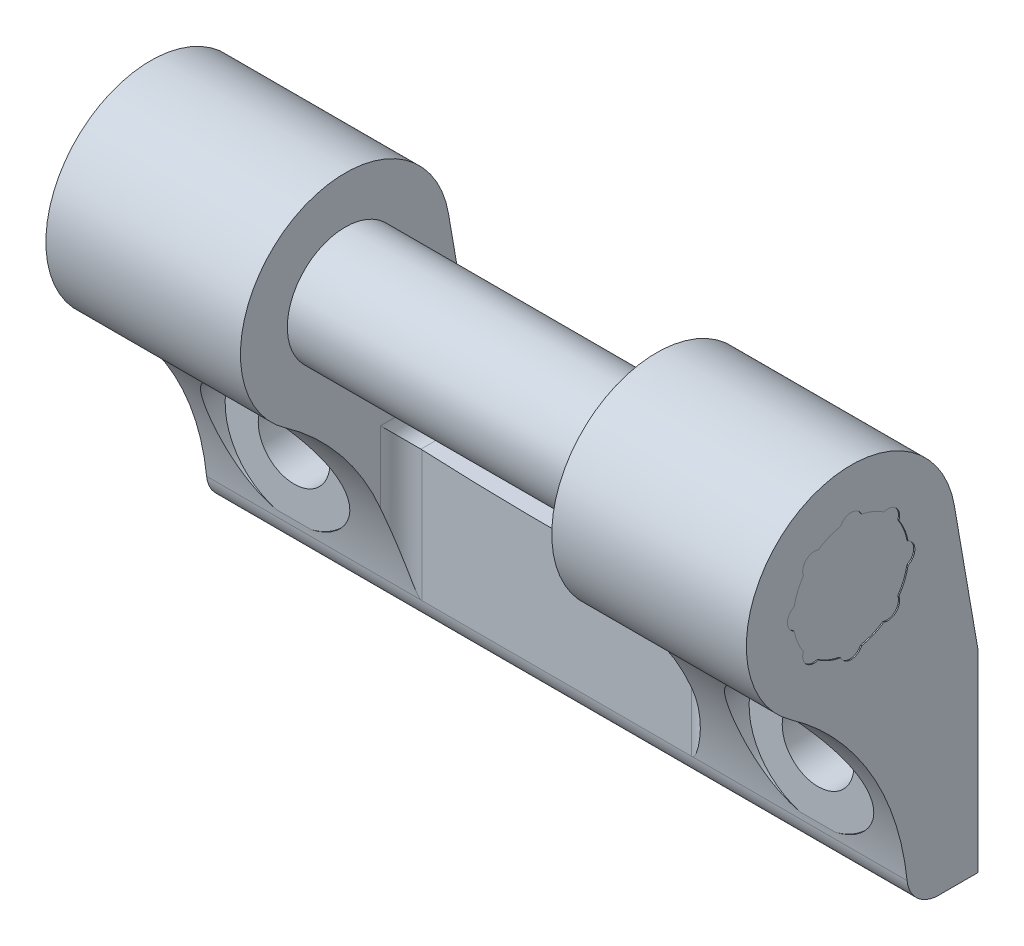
ISO-10303-21;
HEADER;
FILE_DESCRIPTION(('STEP AP214'),'2;1');
FILE_NAME('part.step','',(''),(''),'','','');
FILE_SCHEMA(('AUTOMOTIVE_DESIGN { 1 0 10303 214 1 1 1 1 }'));
ENDSEC;
DATA;
#1=APPLICATION_CONTEXT('core data for automotive mechanical design processes');
#2=APPLICATION_PROTOCOL_DEFINITION('international standard','automotive_design',2000,#1);
#3=PRODUCT_CONTEXT('',#1,'mechanical');
#4=PRODUCT('Part','Part','',(#3));
#5=PRODUCT_RELATED_PRODUCT_CATEGORY('part','',(#4));
#6=PRODUCT_DEFINITION_FORMATION('','',#4);
#7=PRODUCT_DEFINITION_CONTEXT('part definition',#1,'design');
#8=PRODUCT_DEFINITION('design','',#6,#7);
#9=PRODUCT_DEFINITION_SHAPE('','',#8);
#10=(LENGTH_UNIT() NAMED_UNIT(*) SI_UNIT(.MILLI.,.METRE.));
#11=(NAMED_UNIT(*) PLANE_ANGLE_UNIT() SI_UNIT($,.RADIAN.));
#12=(NAMED_UNIT(*) SI_UNIT($,.STERADIAN.) SOLID_ANGLE_UNIT());
#13=UNCERTAINTY_MEASURE_WITH_UNIT(LENGTH_MEASURE(1.E-05),#10,'distance_accuracy_value','');
#14=(GEOMETRIC_REPRESENTATION_CONTEXT(3) GLOBAL_UNCERTAINTY_ASSIGNED_CONTEXT((#13)) GLOBAL_UNIT_ASSIGNED_CONTEXT((#10,
#11,#12)) REPRESENTATION_CONTEXT('',''));
#15=CARTESIAN_POINT('',(0.,0.,0.));
#16=DIRECTION('',(0.,0.,1.));
#17=DIRECTION('',(1.,0.,0.));
#18=AXIS2_PLACEMENT_3D('',#15,#16,#17);
#19=CARTESIAN_POINT('',(42.75,0.,6.5));
#20=DIRECTION('',(0.,0.,-1.));
#21=DIRECTION('',(-1.,0.,0.));
#22=AXIS2_PLACEMENT_3D('',#19,#20,#21);
#23=PLANE('',#22);
#24=CARTESIAN_POINT('',(47.5,0.,6.5));
#25=DIRECTION('',(0.,0.,-1.));
#26=DIRECTION('',(-1.,0.,0.));
#27=AXIS2_PLACEMENT_3D('',#24,#25,#26);
#28=CIRCLE('',#27,3.25);
#29=CARTESIAN_POINT('',(44.25,0.,6.5));
#30=VERTEX_POINT('',#29);
#31=EDGE_CURVE('E466',#30,#30,#28,.T.);
#32=ORIENTED_EDGE('',*,*,#31,.T.);
#33=EDGE_LOOP('',(#32));
#34=FACE_BOUND('',#33,.T.);
#35=CARTESIAN_POINT('',(47.5,0.,6.5));
#36=DIRECTION('',(0.,0.,-1.));
#37=DIRECTION('',(-1.,0.,0.));
#38=AXIS2_PLACEMENT_3D('',#35,#36,#37);
#39=CIRCLE('',#38,6.25);
#40=CARTESIAN_POINT('',(45.9236834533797,-6.04795222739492,6.5));
#41=VERTEX_POINT('',#40);
#42=CARTESIAN_POINT('',(49.0763165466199,-6.04795222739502,6.5));
#43=VERTEX_POINT('',#42);
#44=EDGE_CURVE('E287',#41,#43,#39,.T.);
#45=ORIENTED_EDGE('',*,*,#44,.F.);
#46=DIRECTION('',(1.,0.,0.));
#47=VECTOR('',#46,1.);
#48=CARTESIAN_POINT('',(55.5,-6.04795222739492,6.5));
#49=LINE('',#48,#47);
#50=EDGE_CURVE('E647',#41,#43,#49,.T.);
#51=ORIENTED_EDGE('',*,*,#50,.T.);
#52=EDGE_LOOP('',(#45,#51));
#53=FACE_BOUND('',#52,.T.);
#54=ADVANCED_FACE('F14',(#34,#53),#23,.F.);
#55=CARTESIAN_POINT('',(47.5,0.,13.75));
#56=DIRECTION('',(0.,0.,-1.));
#57=DIRECTION('',(-1.,0.,0.));
#58=AXIS2_PLACEMENT_3D('',#55,#56,#57);
#59=CYLINDRICAL_SURFACE('',#58,6.25);
#60=CARTESIAN_POINT('',(49.0763165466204,-6.0479522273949,6.5));
#61=CARTESIAN_POINT('',(49.2442618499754,-6.00420061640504,6.5056636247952));
#62=CARTESIAN_POINT('',(49.4103412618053,-5.95342386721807,6.51233242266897));
#63=CARTESIAN_POINT('',(49.7376110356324,-5.83828897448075,6.52792341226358));
#64=CARTESIAN_POINT('',(49.898801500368,-5.77393111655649,6.53684555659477));
#65=CARTESIAN_POINT('',(50.2150444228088,-5.63214532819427,6.55718014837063));
#66=CARTESIAN_POINT('',(50.3701006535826,-5.55472559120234,6.56859103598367));
#67=CARTESIAN_POINT('',(50.6730760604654,-5.38739555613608,6.59419174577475));
#68=CARTESIAN_POINT('',(50.8209953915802,-5.29748552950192,6.60838150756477));
#69=CARTESIAN_POINT('',(51.1087485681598,-5.1058143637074,6.63985170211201));
#70=CARTESIAN_POINT('',(51.2485767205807,-5.00404502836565,6.65713427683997));
#71=CARTESIAN_POINT('',(51.5190494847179,-4.78952342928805,6.69508884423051));
#72=CARTESIAN_POINT('',(51.6496939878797,-4.67677103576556,6.71576087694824));
#73=CARTESIAN_POINT('',(51.9008408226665,-4.44125256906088,6.76077751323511));
#74=CARTESIAN_POINT('',(52.0213470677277,-4.31849039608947,6.78512068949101));
#75=CARTESIAN_POINT('',(52.2514621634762,-4.06393222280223,6.83774803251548));
#76=CARTESIAN_POINT('',(52.3610710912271,-3.9321362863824,6.866032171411));
#77=CARTESIAN_POINT('',(52.5683563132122,-3.6610495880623,6.92666134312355));
#78=CARTESIAN_POINT('',(52.6660700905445,-3.52178447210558,6.95899293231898));
#79=CARTESIAN_POINT('',(52.8494448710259,-3.23646567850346,7.02796148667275));
#80=CARTESIAN_POINT('',(52.9351009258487,-3.09040924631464,7.06460020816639));
#81=CARTESIAN_POINT('',(53.0938912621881,-2.79273033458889,7.14227125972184));
#82=CARTESIAN_POINT('',(53.1670232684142,-2.64110684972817,7.18330438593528));
#83=CARTESIAN_POINT('',(53.3004244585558,-2.33359340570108,7.26975929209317));
#84=CARTESIAN_POINT('',(53.3606983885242,-2.17770504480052,7.31517944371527));
#85=CARTESIAN_POINT('',(53.4708229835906,-1.8553043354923,7.41263215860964));
#86=CARTESIAN_POINT('',(53.5200403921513,-1.68863963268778,7.46487663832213));
#87=CARTESIAN_POINT('',(53.6041916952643,-1.3532341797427,7.57397636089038));
#88=CARTESIAN_POINT('',(53.6391253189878,-1.18449339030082,7.63083169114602));
#89=CARTESIAN_POINT('',(53.6948310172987,-0.846152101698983,7.74893286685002));
#90=CARTESIAN_POINT('',(53.7155981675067,-0.676551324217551,7.810180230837));
#91=CARTESIAN_POINT('',(53.7431836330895,-0.337724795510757,7.93673418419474));
#92=CARTESIAN_POINT('',(53.7500003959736,-0.168499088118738,8.00204122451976));
#93=CARTESIAN_POINT('',(53.7499995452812,0.193497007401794,8.14629992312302));
#94=CARTESIAN_POINT('',(53.7410091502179,0.386035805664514,8.22583846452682));
#95=CARTESIAN_POINT('',(53.7056313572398,0.767714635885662,8.38910074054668));
#96=CARTESIAN_POINT('',(53.6792417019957,0.956854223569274,8.47282501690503));
#97=CARTESIAN_POINT('',(53.6097017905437,1.33047343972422,8.64372377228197));
#98=CARTESIAN_POINT('',(53.5665479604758,1.51495206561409,8.73089898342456));
#99=CARTESIAN_POINT('',(53.46411675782,1.87814481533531,8.9078993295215));
#100=CARTESIAN_POINT('',(53.4048335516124,2.05685682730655,8.9977254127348));
#101=CARTESIAN_POINT('',(53.2710050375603,2.40686287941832,9.17881498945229));
#102=CARTESIAN_POINT('',(53.1965114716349,2.57817974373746,9.27007266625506));
#103=CARTESIAN_POINT('',(53.0327134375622,2.91313229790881,9.45338159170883));
#104=CARTESIAN_POINT('',(52.9434089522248,3.0767679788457,9.54543284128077));
#105=CARTESIAN_POINT('',(52.7504211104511,3.3956348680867,9.72938730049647));
#106=CARTESIAN_POINT('',(52.6467266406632,3.55085945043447,9.82129033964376));
#107=CARTESIAN_POINT('',(52.4254582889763,3.85191643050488,10.0037614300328));
#108=CARTESIAN_POINT('',(52.307884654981,3.99774899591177,10.0943295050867));
#109=CARTESIAN_POINT('',(52.0531916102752,4.28599017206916,10.2772494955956));
#110=CARTESIAN_POINT('',(51.9153995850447,4.42788707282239,10.3694738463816));
#111=CARTESIAN_POINT('',(51.6253833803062,4.69927164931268,10.5495190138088));
#112=CARTESIAN_POINT('',(51.4731570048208,4.8287574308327,10.6373391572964));
#113=CARTESIAN_POINT('',(51.155028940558,5.07380684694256,10.806611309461));
#114=CARTESIAN_POINT('',(50.9891493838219,5.18939229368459,10.8880732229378));
#115=CARTESIAN_POINT('',(50.6441915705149,5.40536054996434,11.0427226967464));
#116=CARTESIAN_POINT('',(50.4651195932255,5.50575052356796,11.1159141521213));
#117=CARTESIAN_POINT('',(50.1504014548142,5.66204993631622,11.2313877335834));
#118=CARTESIAN_POINT('',(50.0178592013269,5.72226470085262,11.2763523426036));
#119=CARTESIAN_POINT('',(49.7472895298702,5.83383142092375,11.360341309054));
#120=CARTESIAN_POINT('',(49.6092635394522,5.88518566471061,11.3993671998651));
#121=CARTESIAN_POINT('',(49.3284318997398,5.97839535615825,11.4706711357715));
#122=CARTESIAN_POINT('',(49.1856292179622,6.02025658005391,11.5029532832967));
#123=CARTESIAN_POINT('',(48.8960516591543,6.09391871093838,11.5600462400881));
#124=CARTESIAN_POINT('',(48.749278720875,6.12572443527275,11.5848606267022));
#125=CARTESIAN_POINT('',(48.4517691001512,6.1789652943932,11.6265386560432));
#126=CARTESIAN_POINT('',(48.3010133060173,6.20033400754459,11.6433513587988));
#127=CARTESIAN_POINT('',(47.997627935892,6.23202421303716,11.6683257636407));
#128=CARTESIAN_POINT('',(47.8449983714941,6.24234577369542,11.6764875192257));
#129=CARTESIAN_POINT('',(47.5391948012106,6.25174865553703,11.683921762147));
#130=CARTESIAN_POINT('',(47.3860208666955,6.25083139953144,11.683195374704));
#131=CARTESIAN_POINT('',(47.0804616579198,6.23777777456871,11.6728776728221));
#132=CARTESIAN_POINT('',(46.92807633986,6.22564203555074,11.6632868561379));
#133=CARTESIAN_POINT('',(46.6392493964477,6.19199216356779,11.6367908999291));
#134=CARTESIAN_POINT('',(46.5026254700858,6.17143847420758,11.6206358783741));
#135=CARTESIAN_POINT('',(46.2319448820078,6.12156069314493,11.5816144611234));
#136=CARTESIAN_POINT('',(46.0978890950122,6.09223366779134,11.558745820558));
#137=CARTESIAN_POINT('',(45.7008256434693,5.99165007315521,11.4807705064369));
#138=CARTESIAN_POINT('',(45.4427254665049,5.90776740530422,11.4162754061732));
#139=CARTESIAN_POINT('',(44.9282540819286,5.70354204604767,11.2620428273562));
#140=CARTESIAN_POINT('',(44.6731336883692,5.58114961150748,11.1709145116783));
#141=CARTESIAN_POINT('',(44.1866804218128,5.30683079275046,10.9714630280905));
#142=CARTESIAN_POINT('',(43.9553581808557,5.15489129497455,10.8631322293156));
#143=CARTESIAN_POINT('',(43.4769063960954,4.79408237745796,10.6128977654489));
#144=CARTESIAN_POINT('',(43.2350940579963,4.57988097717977,10.4685228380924));
#145=CARTESIAN_POINT('',(42.7896307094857,4.12037388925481,10.1703781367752));
#146=CARTESIAN_POINT('',(42.5860191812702,3.87503645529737,10.0165988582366));
#147=CARTESIAN_POINT('',(42.1867998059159,3.31230350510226,9.67858506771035));
#148=CARTESIAN_POINT('',(41.9988501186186,2.98981511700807,9.49373684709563));
#149=CARTESIAN_POINT('',(41.6826003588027,2.31494096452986,9.12813581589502));
#150=CARTESIAN_POINT('',(41.5542480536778,1.96258170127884,8.94737955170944));
#151=CARTESIAN_POINT('',(41.3898696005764,1.34159945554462,8.6480448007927));
#152=CARTESIAN_POINT('',(41.3378449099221,1.07845170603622,8.52668074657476));
#153=CARTESIAN_POINT('',(41.2679150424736,0.544143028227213,8.29164896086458));
#154=CARTESIAN_POINT('',(41.2500058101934,0.272983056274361,8.17798031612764));
#155=CARTESIAN_POINT('',(41.2499963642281,-0.170821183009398,8.00111304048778));
#156=CARTESIAN_POINT('',(41.257003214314,-0.342356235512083,7.93494652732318));
#157=CARTESIAN_POINT('',(41.28535166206,-0.685786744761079,7.80679083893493));
#158=CARTESIAN_POINT('',(41.3066894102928,-0.857682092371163,7.7448005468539));
#159=CARTESIAN_POINT('',(41.363963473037,-1.2007638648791,7.62526915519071));
#160=CARTESIAN_POINT('',(41.399912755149,-1.37194952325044,7.56773206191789));
#161=CARTESIAN_POINT('',(41.4865037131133,-1.71205664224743,7.45743687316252));
#162=CARTESIAN_POINT('',(41.5371391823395,-1.88097902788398,7.40467677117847));
#163=CARTESIAN_POINT('',(41.6532332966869,-2.21569011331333,7.30392828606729));
#164=CARTESIAN_POINT('',(41.7187328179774,-2.38146877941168,7.25595359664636));
#165=CARTESIAN_POINT('',(41.8642699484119,-2.70794908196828,7.16500578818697));
#166=CARTESIAN_POINT('',(41.9443078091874,-2.86865063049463,7.12203275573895));
#167=CARTESIAN_POINT('',(42.1185057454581,-3.18345253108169,7.04106735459));
#168=CARTESIAN_POINT('',(42.2126611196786,-3.33755505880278,7.00307333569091));
#169=CARTESIAN_POINT('',(42.4145478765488,-3.63777337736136,6.93192062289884));
#170=CARTESIAN_POINT('',(42.5222786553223,-3.78388952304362,6.89876171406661));
#171=CARTESIAN_POINT('',(42.7454049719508,-4.06034947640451,6.83846302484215));
#172=CARTESIAN_POINT('',(42.860231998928,-4.1911079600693,6.81111858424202));
#173=CARTESIAN_POINT('',(43.1008780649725,-4.44303755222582,6.76038350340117));
#174=CARTESIAN_POINT('',(43.226702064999,-4.56420428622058,6.73699466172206));
#175=CARTESIAN_POINT('',(43.4884218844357,-4.79586135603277,6.6938986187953));
#176=CARTESIAN_POINT('',(43.6243184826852,-4.90635086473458,6.67419170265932));
#177=CARTESIAN_POINT('',(43.9051330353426,-5.11567015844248,6.63815870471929));
#178=CARTESIAN_POINT('',(44.0500464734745,-5.21450570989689,6.62183094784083));
#179=CARTESIAN_POINT('',(44.33207062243,-5.38992596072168,6.5937987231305));
#180=CARTESIAN_POINT('',(44.4683768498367,-5.46775892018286,6.58178747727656));
#181=CARTESIAN_POINT('',(44.7465914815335,-5.61300858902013,6.55998189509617));
#182=CARTESIAN_POINT('',(44.8884994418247,-5.68042612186,6.55018738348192));
#183=CARTESIAN_POINT('',(45.1770660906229,-5.80440546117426,6.53260839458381));
#184=CARTESIAN_POINT('',(45.3237238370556,-5.86096940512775,6.52482352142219));
#185=CARTESIAN_POINT('',(45.6209720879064,-5.96292626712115,6.5110834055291));
#186=CARTESIAN_POINT('',(45.7715629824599,-6.00831807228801,6.50512834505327));
#187=CARTESIAN_POINT('',(45.9236834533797,-6.04795222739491,6.5));
#188=B_SPLINE_CURVE_WITH_KNOTS('',3,(#60,#61,#62,#63,#64,#65,#66,#67,#68,#69,#70,#71,#72,#73,
#74,#75,#76,#77,#78,#79,#80,#81,#82,#83,#84,#85,#86,#87,#88,#89,#90,#91,#92,#93,#94,#95,#96,#97,
#98,#99,#100,#101,#102,#103,#104,#105,#106,#107,#108,#109,#110,#111,#112,#113,#114,#115,#116,
#117,#118,#119,#120,#121,#122,#123,#124,#125,#126,#127,#128,#129,#130,#131,#132,#133,#134,#135,
#136,#137,#138,#139,#140,#141,#142,#143,#144,#145,#146,#147,#148,#149,#150,#151,#152,#153,#154,
#155,#156,#157,#158,#159,#160,#161,#162,#163,#164,#165,#166,#167,#168,#169,#170,#171,#172,#173,
#174,#175,#176,#177,#178,#179,#180,#181,#182,#183,#184,#185,#186,#187),.UNSPECIFIED.,.F.,.F.,(4,
2,2,2,2,2,2,2,2,2,2,2,2,2,2,2,2,2,2,2,2,2,2,2,2,2,2,2,2,2,2,2,2,2,2,2,2,2,2,2,2,2,2,2,2,2,2,2,2,
2,2,2,2,2,2,2,2,2,2,2,2,2,2,4),(0.,0.520773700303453,1.04153644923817,1.56197374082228,
2.08239972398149,2.60318754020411,3.123981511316,3.64457352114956,4.16516184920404,
4.68406477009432,5.20318002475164,5.72238948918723,6.2414069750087,6.78514712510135,
7.32889758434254,7.87283695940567,8.41683686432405,9.04154264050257,9.66632948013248,
10.2912495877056,10.9163960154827,11.5394502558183,12.1625052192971,12.7860440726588,
13.4095717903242,14.0634332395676,14.7173943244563,15.3703154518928,16.0229277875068,
16.4796018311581,16.9361577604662,17.3924351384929,17.8484935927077,18.3074177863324,
18.766339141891,19.2252023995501,19.6840398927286,20.1008653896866,20.5178304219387,
21.3511711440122,22.2398007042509,23.1288255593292,24.1863929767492,25.2450474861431,
26.489258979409,27.7323779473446,28.6137046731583,29.4949266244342,30.04635783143,
30.5976409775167,31.1494144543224,31.7009550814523,32.2540312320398,32.8071169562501,
33.3600189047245,33.9128962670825,34.4407211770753,34.968785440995,35.4968905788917,
36.0247333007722,36.496548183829,36.9683257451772,37.4400103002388,37.9117418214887),.UNSPECIFIED.);
#189=EDGE_CURVE('E423',#43,#41,#188,.T.);
#190=ORIENTED_EDGE('',*,*,#189,.T.);
#191=ORIENTED_EDGE('',*,*,#44,.T.);
#192=EDGE_LOOP('',(#190,#191));
#193=FACE_BOUND('',#192,.T.);
#194=ADVANCED_FACE('F1205',(#193),#59,.F.);
#195=CARTESIAN_POINT('',(0.,0.,3.25));
#196=DIRECTION('',(0.,0.,-1.));
#197=DIRECTION('',(-1.,0.,0.));
#198=AXIS2_PLACEMENT_3D('',#195,#196,#197);
#199=CYLINDRICAL_SURFACE('',#198,3.25);
#200=CARTESIAN_POINT('',(0.,0.,0.));
#201=DIRECTION('',(0.,0.,-1.));
#202=DIRECTION('',(-1.,0.,0.));
#203=AXIS2_PLACEMENT_3D('',#200,#201,#202);
#204=CIRCLE('',#203,3.25);
#205=CARTESIAN_POINT('',(-3.25,0.,0.));
#206=VERTEX_POINT('',#205);
#207=EDGE_CURVE('E692',#206,#206,#204,.F.);
#208=ORIENTED_EDGE('',*,*,#207,.F.);
#209=EDGE_LOOP('',(#208));
#210=FACE_BOUND('',#209,.T.);
#211=CARTESIAN_POINT('',(0.,0.,6.5));
#212=DIRECTION('',(0.,0.,-1.));
#213=DIRECTION('',(-1.,0.,0.));
#214=AXIS2_PLACEMENT_3D('',#211,#212,#213);
#215=CIRCLE('',#214,3.25);
#216=CARTESIAN_POINT('',(-3.25,0.,6.5));
#217=VERTEX_POINT('',#216);
#218=EDGE_CURVE('E469',#217,#217,#215,.T.);
#219=ORIENTED_EDGE('',*,*,#218,.F.);
#220=EDGE_LOOP('',(#219));
#221=FACE_BOUND('',#220,.T.);
#222=ADVANCED_FACE('F1215',(#210,#221),#199,.F.);
#223=CARTESIAN_POINT('',(47.5,0.,3.25));
#224=DIRECTION('',(0.,0.,-1.));
#225=DIRECTION('',(-1.,0.,0.));
#226=AXIS2_PLACEMENT_3D('',#223,#224,#225);
#227=CYLINDRICAL_SURFACE('',#226,3.25);
#228=CARTESIAN_POINT('',(47.5,0.,0.));
#229=DIRECTION('',(0.,0.,-1.));
#230=DIRECTION('',(-1.,0.,0.));
#231=AXIS2_PLACEMENT_3D('',#228,#229,#230);
#232=CIRCLE('',#231,3.25);
#233=CARTESIAN_POINT('',(44.25,0.,0.));
#234=VERTEX_POINT('',#233);
#235=EDGE_CURVE('E689',#234,#234,#232,.F.);
#236=ORIENTED_EDGE('',*,*,#235,.F.);
#237=EDGE_LOOP('',(#236));
#238=FACE_BOUND('',#237,.T.);
#239=ORIENTED_EDGE('',*,*,#31,.F.);
#240=EDGE_LOOP('',(#239));
#241=FACE_BOUND('',#240,.T.);
#242=ADVANCED_FACE('F1736',(#238,#241),#227,.F.);
#243=CARTESIAN_POINT('',(55.5,-9.25,3.56770992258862));
#244=DIRECTION('',(0.,-1.,0.));
#245=DIRECTION('',(1.,0.,0.));
#246=AXIS2_PLACEMENT_3D('',#243,#244,#245);
#247=PLANE('',#246);
#248=DIRECTION('',(0.,0.,1.));
#249=VECTOR('',#248,1.);
#250=CARTESIAN_POINT('',(55.5,-9.25,3.56770992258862));
#251=LINE('',#250,#249);
#252=CARTESIAN_POINT('',(55.5,-9.25,0.));
#253=VERTEX_POINT('',#252);
#254=CARTESIAN_POINT('',(55.5,-9.25,3.56770992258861));
#255=VERTEX_POINT('',#254);
#256=EDGE_CURVE('E556',#253,#255,#251,.T.);
#257=ORIENTED_EDGE('',*,*,#256,.T.);
#258=DIRECTION('',(1.,0.,0.));
#259=VECTOR('',#258,1.);
#260=CARTESIAN_POINT('',(55.5,-9.25,3.56770992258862));
#261=LINE('',#260,#259);
#262=CARTESIAN_POINT('',(-8.,-9.25,3.56770992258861));
#263=VERTEX_POINT('',#262);
#264=EDGE_CURVE('E552',#255,#263,#261,.F.);
#265=ORIENTED_EDGE('',*,*,#264,.T.);
#266=DIRECTION('',(0.,0.,1.));
#267=VECTOR('',#266,1.);
#268=CARTESIAN_POINT('',(-8.,-9.25,0.));
#269=LINE('',#268,#267);
#270=CARTESIAN_POINT('',(-8.,-9.25,0.));
#271=VERTEX_POINT('',#270);
#272=EDGE_CURVE('E743',#263,#271,#269,.F.);
#273=ORIENTED_EDGE('',*,*,#272,.T.);
#274=DIRECTION('',(-1.,0.,0.));
#275=VECTOR('',#274,1.);
#276=CARTESIAN_POINT('',(55.5,-9.25,0.));
#277=LINE('',#276,#275);
#278=EDGE_CURVE('E557',#253,#271,#277,.T.);
#279=ORIENTED_EDGE('',*,*,#278,.F.);
#280=EDGE_LOOP('',(#257,#265,#273,#279));
#281=FACE_BOUND('',#280,.T.);
#282=ADVANCED_FACE('F409',(#281),#247,.T.);
#283=CARTESIAN_POINT('',(55.5,15.6589204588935,14.8410795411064));
#284=DIRECTION('',(1.,0.,0.));
#285=DIRECTION('',(0.,1.,0.));
#286=AXIS2_PLACEMENT_3D('',#283,#284,#285);
#287=CYLINDRICAL_SURFACE('',#286,1.05);
#288=DIRECTION('',(1.,0.,0.));
#289=VECTOR('',#288,1.);
#290=CARTESIAN_POINT('',(55.5,14.6746191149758,14.4754966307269));
#291=LINE('',#290,#289);
#292=CARTESIAN_POINT('',(55.4,14.6746191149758,14.4754966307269));
#293=VERTEX_POINT('',#292);
#294=CARTESIAN_POINT('',(55.5,14.6746191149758,14.4754966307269));
#295=VERTEX_POINT('',#294);
#296=EDGE_CURVE('E641',#293,#295,#291,.T.);
#297=ORIENTED_EDGE('',*,*,#296,.F.);
#298=CARTESIAN_POINT('',(55.4,15.6589204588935,14.8410795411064));
#299=DIRECTION('',(1.,0.,0.));
#300=DIRECTION('',(0.,1.,0.));
#301=AXIS2_PLACEMENT_3D('',#298,#299,#300);
#302=CIRCLE('',#301,1.05);
#303=CARTESIAN_POINT('',(55.4,16.0245033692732,15.8253808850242));
#304=VERTEX_POINT('',#303);
#305=EDGE_CURVE('E24',#293,#304,#302,.F.);
#306=ORIENTED_EDGE('',*,*,#305,.T.);
#307=DIRECTION('',(1.,0.,0.));
#308=VECTOR('',#307,1.);
#309=CARTESIAN_POINT('',(55.5,16.0245033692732,15.8253808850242));
#310=LINE('',#309,#308);
#311=CARTESIAN_POINT('',(55.5,16.0245033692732,15.8253808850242));
#312=VERTEX_POINT('',#311);
#313=EDGE_CURVE('E637',#304,#312,#310,.T.);
#314=ORIENTED_EDGE('',*,*,#313,.T.);
#315=CARTESIAN_POINT('',(55.5,15.6589204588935,14.8410795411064));
#316=DIRECTION('',(1.,0.,0.));
#317=DIRECTION('',(0.,1.,0.));
#318=AXIS2_PLACEMENT_3D('',#315,#316,#317);
#319=CIRCLE('',#318,1.05);
#320=EDGE_CURVE('E793',#295,#312,#319,.F.);
#321=ORIENTED_EDGE('',*,*,#320,.F.);
#322=EDGE_LOOP('',(#297,#306,#314,#321));
#323=FACE_BOUND('',#322,.T.);
#324=ADVANCED_FACE('F405',(#323),#287,.F.);
#325=CARTESIAN_POINT('',(55.5,19.,11.5));
#326=DIRECTION('',(1.,0.,0.));
#327=DIRECTION('',(0.,1.,0.));
#328=AXIS2_PLACEMENT_3D('',#325,#326,#327);
#329=CYLINDRICAL_SURFACE('',#328,5.25);
#330=ORIENTED_EDGE('',*,*,#313,.F.);
#331=CARTESIAN_POINT('',(55.4,19.,11.5));
#332=DIRECTION('',(1.,0.,0.));
#333=DIRECTION('',(0.,1.,0.));
#334=AXIS2_PLACEMENT_3D('',#331,#332,#333);
#335=CIRCLE('',#334,5.25);
#336=CARTESIAN_POINT('',(55.4,18.0454876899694,16.6625));
#337=VERTEX_POINT('',#336);
#338=EDGE_CURVE('E115',#304,#337,#335,.F.);
#339=ORIENTED_EDGE('',*,*,#338,.T.);
#340=DIRECTION('',(1.,0.,0.));
#341=VECTOR('',#340,1.);
#342=CARTESIAN_POINT('',(55.5,18.0454876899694,16.6625));
#343=LINE('',#342,#341);
#344=CARTESIAN_POINT('',(55.5,18.0454876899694,16.6625));
#345=VERTEX_POINT('',#344);
#346=EDGE_CURVE('E634',#337,#345,#343,.T.);
#347=ORIENTED_EDGE('',*,*,#346,.T.);
#348=CARTESIAN_POINT('',(55.5,19.,11.5));
#349=DIRECTION('',(1.,0.,0.));
#350=DIRECTION('',(0.,1.,0.));
#351=AXIS2_PLACEMENT_3D('',#348,#349,#350);
#352=CIRCLE('',#351,5.25);
#353=EDGE_CURVE('E790',#312,#345,#352,.F.);
#354=ORIENTED_EDGE('',*,*,#353,.F.);
#355=EDGE_LOOP('',(#330,#339,#347,#354));
#356=FACE_BOUND('',#355,.T.);
#357=ADVANCED_FACE('F401',(#356),#329,.F.);
#358=CARTESIAN_POINT('',(55.5,19.,16.225));
#359=DIRECTION('',(1.,0.,0.));
#360=DIRECTION('',(0.,1.,0.));
#361=AXIS2_PLACEMENT_3D('',#358,#359,#360);
#362=CYLINDRICAL_SURFACE('',#361,1.05);
#363=ORIENTED_EDGE('',*,*,#346,.F.);
#364=CARTESIAN_POINT('',(55.4,19.,16.225));
#365=DIRECTION('',(1.,0.,0.));
#366=DIRECTION('',(0.,0.,-1.));
#367=AXIS2_PLACEMENT_3D('',#364,#365,#366);
#368=CIRCLE('',#367,1.05);
#369=CARTESIAN_POINT('',(55.4,19.9545123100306,16.6625));
#370=VERTEX_POINT('',#369);
#371=EDGE_CURVE('E118',#337,#370,#368,.F.);
#372=ORIENTED_EDGE('',*,*,#371,.T.);
#373=DIRECTION('',(1.,0.,0.));
#374=VECTOR('',#373,1.);
#375=CARTESIAN_POINT('',(55.5,19.9545123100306,16.6625));
#376=LINE('',#375,#374);
#377=CARTESIAN_POINT('',(55.5,19.9545123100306,16.6625));
#378=VERTEX_POINT('',#377);
#379=EDGE_CURVE('E630',#370,#378,#376,.T.);
#380=ORIENTED_EDGE('',*,*,#379,.T.);
#381=CARTESIAN_POINT('',(55.5,19.,16.225));
#382=DIRECTION('',(1.,0.,0.));
#383=DIRECTION('',(0.,1.,0.));
#384=AXIS2_PLACEMENT_3D('',#381,#382,#383);
#385=CIRCLE('',#384,1.05);
#386=EDGE_CURVE('E787',#345,#378,#385,.F.);
#387=ORIENTED_EDGE('',*,*,#386,.F.);
#388=EDGE_LOOP('',(#363,#372,#380,#387));
#389=FACE_BOUND('',#388,.T.);
#390=ADVANCED_FACE('F397',(#389),#362,.F.);
#391=CARTESIAN_POINT('',(55.5,19.,11.5));
#392=DIRECTION('',(1.,0.,0.));
#393=DIRECTION('',(0.,1.,0.));
#394=AXIS2_PLACEMENT_3D('',#391,#392,#393);
#395=CYLINDRICAL_SURFACE('',#394,5.25);
#396=ORIENTED_EDGE('',*,*,#379,.F.);
#397=CARTESIAN_POINT('',(55.4,19.,11.5));
#398=DIRECTION('',(1.,0.,0.));
#399=DIRECTION('',(0.,1.,0.));
#400=AXIS2_PLACEMENT_3D('',#397,#398,#399);
#401=CIRCLE('',#400,5.25);
#402=CARTESIAN_POINT('',(55.4,21.9754966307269,15.8253808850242));
#403=VERTEX_POINT('',#402);
#404=EDGE_CURVE('E113',#370,#403,#401,.F.);
#405=ORIENTED_EDGE('',*,*,#404,.T.);
#406=DIRECTION('',(1.,0.,0.));
#407=VECTOR('',#406,1.);
#408=CARTESIAN_POINT('',(55.5,21.9754966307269,15.8253808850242));
#409=LINE('',#408,#407);
#410=CARTESIAN_POINT('',(55.5,21.9754966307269,15.8253808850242));
#411=VERTEX_POINT('',#410);
#412=EDGE_CURVE('E626',#403,#411,#409,.T.);
#413=ORIENTED_EDGE('',*,*,#412,.T.);
#414=CARTESIAN_POINT('',(55.5,19.,11.5));
#415=DIRECTION('',(1.,0.,0.));
#416=DIRECTION('',(0.,1.,0.));
#417=AXIS2_PLACEMENT_3D('',#414,#415,#416);
#418=CIRCLE('',#417,5.25);
#419=EDGE_CURVE('E784',#378,#411,#418,.F.);
#420=ORIENTED_EDGE('',*,*,#419,.F.);
#421=EDGE_LOOP('',(#396,#405,#413,#420));
#422=FACE_BOUND('',#421,.T.);
#423=ADVANCED_FACE('F393',(#422),#395,.F.);
#424=CARTESIAN_POINT('',(55.5,22.3410795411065,14.8410795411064));
#425=DIRECTION('',(1.,0.,0.));
#426=DIRECTION('',(0.,1.,0.));
#427=AXIS2_PLACEMENT_3D('',#424,#425,#426);
#428=CYLINDRICAL_SURFACE('',#427,1.05);
#429=ORIENTED_EDGE('',*,*,#412,.F.);
#430=CARTESIAN_POINT('',(55.4,22.3410795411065,14.8410795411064));
#431=DIRECTION('',(1.,0.,0.));
#432=DIRECTION('',(0.,0.,-1.));
#433=AXIS2_PLACEMENT_3D('',#430,#431,#432);
#434=CIRCLE('',#433,1.05);
#435=CARTESIAN_POINT('',(55.4,23.3253808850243,14.4754966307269));
#436=VERTEX_POINT('',#435);
#437=EDGE_CURVE('E161',#403,#436,#434,.F.);
#438=ORIENTED_EDGE('',*,*,#437,.T.);
#439=DIRECTION('',(1.,0.,0.));
#440=VECTOR('',#439,1.);
#441=CARTESIAN_POINT('',(55.5,23.3253808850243,14.4754966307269));
#442=LINE('',#441,#440);
#443=CARTESIAN_POINT('',(55.5,23.3253808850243,14.4754966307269));
#444=VERTEX_POINT('',#443);
#445=EDGE_CURVE('E622',#436,#444,#442,.T.);
#446=ORIENTED_EDGE('',*,*,#445,.T.);
#447=CARTESIAN_POINT('',(55.5,22.3410795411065,14.8410795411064));
#448=DIRECTION('',(1.,0.,0.));
#449=DIRECTION('',(0.,1.,0.));
#450=AXIS2_PLACEMENT_3D('',#447,#448,#449);
#451=CIRCLE('',#450,1.05);
#452=EDGE_CURVE('E781',#411,#444,#451,.F.);
#453=ORIENTED_EDGE('',*,*,#452,.F.);
#454=EDGE_LOOP('',(#429,#438,#446,#453));
#455=FACE_BOUND('',#454,.T.);
#456=ADVANCED_FACE('F389',(#455),#428,.F.);
#457=CARTESIAN_POINT('',(55.5,19.,11.5));
#458=DIRECTION('',(1.,0.,0.));
#459=DIRECTION('',(0.,1.,0.));
#460=AXIS2_PLACEMENT_3D('',#457,#458,#459);
#461=CYLINDRICAL_SURFACE('',#460,5.25);
#462=ORIENTED_EDGE('',*,*,#445,.F.);
#463=CARTESIAN_POINT('',(55.4,19.,11.5));
#464=DIRECTION('',(1.,0.,0.));
#465=DIRECTION('',(0.,1.,0.));
#466=AXIS2_PLACEMENT_3D('',#463,#464,#465);
#467=CIRCLE('',#466,5.25);
#468=CARTESIAN_POINT('',(55.4,24.1625,12.4545123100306));
#469=VERTEX_POINT('',#468);
#470=EDGE_CURVE('E158',#436,#469,#467,.F.);
#471=ORIENTED_EDGE('',*,*,#470,.T.);
#472=DIRECTION('',(1.,0.,0.));
#473=VECTOR('',#472,1.);
#474=CARTESIAN_POINT('',(55.5,24.1625,12.4545123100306));
#475=LINE('',#474,#473);
#476=CARTESIAN_POINT('',(55.5,24.1625,12.4545123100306));
#477=VERTEX_POINT('',#476);
#478=EDGE_CURVE('E618',#469,#477,#475,.T.);
#479=ORIENTED_EDGE('',*,*,#478,.T.);
#480=CARTESIAN_POINT('',(55.5,19.,11.5));
#481=DIRECTION('',(1.,0.,0.));
#482=DIRECTION('',(0.,1.,0.));
#483=AXIS2_PLACEMENT_3D('',#480,#481,#482);
#484=CIRCLE('',#483,5.25);
#485=EDGE_CURVE('E778',#444,#477,#484,.F.);
#486=ORIENTED_EDGE('',*,*,#485,.F.);
#487=EDGE_LOOP('',(#462,#471,#479,#486));
#488=FACE_BOUND('',#487,.T.);
#489=ADVANCED_FACE('F385',(#488),#461,.F.);
#490=CARTESIAN_POINT('',(55.5,23.725,11.5));
#491=DIRECTION('',(1.,0.,0.));
#492=DIRECTION('',(0.,1.,0.));
#493=AXIS2_PLACEMENT_3D('',#490,#491,#492);
#494=CYLINDRICAL_SURFACE('',#493,1.05);
#495=ORIENTED_EDGE('',*,*,#478,.F.);
#496=CARTESIAN_POINT('',(55.4,23.725,11.5));
#497=DIRECTION('',(1.,0.,0.));
#498=DIRECTION('',(0.,0.,-1.));
#499=AXIS2_PLACEMENT_3D('',#496,#497,#498);
#500=CIRCLE('',#499,1.05);
#501=CARTESIAN_POINT('',(55.4,24.1625,10.5454876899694));
#502=VERTEX_POINT('',#501);
#503=EDGE_CURVE('E162',#469,#502,#500,.F.);
#504=ORIENTED_EDGE('',*,*,#503,.T.);
#505=DIRECTION('',(1.,0.,0.));
#506=VECTOR('',#505,1.);
#507=CARTESIAN_POINT('',(55.5,24.1625,10.5454876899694));
#508=LINE('',#507,#506);
#509=CARTESIAN_POINT('',(55.5,24.1625,10.5454876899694));
#510=VERTEX_POINT('',#509);
#511=EDGE_CURVE('E614',#502,#510,#508,.T.);
#512=ORIENTED_EDGE('',*,*,#511,.T.);
#513=CARTESIAN_POINT('',(55.5,23.725,11.5));
#514=DIRECTION('',(1.,0.,0.));
#515=DIRECTION('',(0.,1.,0.));
#516=AXIS2_PLACEMENT_3D('',#513,#514,#515);
#517=CIRCLE('',#516,1.05);
#518=EDGE_CURVE('E775',#477,#510,#517,.F.);
#519=ORIENTED_EDGE('',*,*,#518,.F.);
#520=EDGE_LOOP('',(#495,#504,#512,#519));
#521=FACE_BOUND('',#520,.T.);
#522=ADVANCED_FACE('F381',(#521),#494,.F.);
#523=CARTESIAN_POINT('',(55.5,19.,11.5));
#524=DIRECTION('',(1.,0.,0.));
#525=DIRECTION('',(0.,1.,0.));
#526=AXIS2_PLACEMENT_3D('',#523,#524,#525);
#527=CYLINDRICAL_SURFACE('',#526,5.25);
#528=ORIENTED_EDGE('',*,*,#511,.F.);
#529=CARTESIAN_POINT('',(55.4,19.,11.5));
#530=DIRECTION('',(1.,0.,0.));
#531=DIRECTION('',(0.,1.,0.));
#532=AXIS2_PLACEMENT_3D('',#529,#530,#531);
#533=CIRCLE('',#532,5.25);
#534=CARTESIAN_POINT('',(55.4,23.3253808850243,8.52450336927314));
#535=VERTEX_POINT('',#534);
#536=EDGE_CURVE('E167',#502,#535,#533,.F.);
#537=ORIENTED_EDGE('',*,*,#536,.T.);
#538=DIRECTION('',(1.,0.,0.));
#539=VECTOR('',#538,1.);
#540=CARTESIAN_POINT('',(55.5,23.3253808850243,8.52450336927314));
#541=LINE('',#540,#539);
#542=CARTESIAN_POINT('',(55.5,23.3253808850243,8.52450336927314));
#543=VERTEX_POINT('',#542);
#544=EDGE_CURVE('E610',#535,#543,#541,.T.);
#545=ORIENTED_EDGE('',*,*,#544,.T.);
#546=CARTESIAN_POINT('',(55.5,19.,11.5));
#547=DIRECTION('',(1.,0.,0.));
#548=DIRECTION('',(0.,1.,0.));
#549=AXIS2_PLACEMENT_3D('',#546,#547,#548);
#550=CIRCLE('',#549,5.25);
#551=EDGE_CURVE('E772',#510,#543,#550,.F.);
#552=ORIENTED_EDGE('',*,*,#551,.F.);
#553=EDGE_LOOP('',(#528,#537,#545,#552));
#554=FACE_BOUND('',#553,.T.);
#555=ADVANCED_FACE('F377',(#554),#527,.F.);
#556=CARTESIAN_POINT('',(55.5,22.3410795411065,8.15892045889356));
#557=DIRECTION('',(1.,0.,0.));
#558=DIRECTION('',(0.,1.,0.));
#559=AXIS2_PLACEMENT_3D('',#556,#557,#558);
#560=CYLINDRICAL_SURFACE('',#559,1.05);
#561=ORIENTED_EDGE('',*,*,#544,.F.);
#562=CARTESIAN_POINT('',(55.4,22.3410795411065,8.15892045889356));
#563=DIRECTION('',(1.,0.,0.));
#564=DIRECTION('',(0.,0.,-1.));
#565=AXIS2_PLACEMENT_3D('',#562,#563,#564);
#566=CIRCLE('',#565,1.05);
#567=CARTESIAN_POINT('',(55.4,21.9754966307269,7.17461911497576));
#568=VERTEX_POINT('',#567);
#569=EDGE_CURVE('E170',#535,#568,#566,.F.);
#570=ORIENTED_EDGE('',*,*,#569,.T.);
#571=DIRECTION('',(1.,0.,0.));
#572=VECTOR('',#571,1.);
#573=CARTESIAN_POINT('',(55.5,21.9754966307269,7.17461911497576));
#574=LINE('',#573,#572);
#575=CARTESIAN_POINT('',(55.5,21.9754966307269,7.17461911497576));
#576=VERTEX_POINT('',#575);
#577=EDGE_CURVE('E606',#568,#576,#574,.T.);
#578=ORIENTED_EDGE('',*,*,#577,.T.);
#579=CARTESIAN_POINT('',(55.5,22.3410795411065,8.15892045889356));
#580=DIRECTION('',(1.,0.,0.));
#581=DIRECTION('',(0.,1.,0.));
#582=AXIS2_PLACEMENT_3D('',#579,#580,#581);
#583=CIRCLE('',#582,1.05);
#584=EDGE_CURVE('E769',#543,#576,#583,.F.);
#585=ORIENTED_EDGE('',*,*,#584,.F.);
#586=EDGE_LOOP('',(#561,#570,#578,#585));
#587=FACE_BOUND('',#586,.T.);
#588=ADVANCED_FACE('F373',(#587),#560,.F.);
#589=CARTESIAN_POINT('',(55.5,19.,11.5));
#590=DIRECTION('',(1.,0.,0.));
#591=DIRECTION('',(0.,1.,0.));
#592=AXIS2_PLACEMENT_3D('',#589,#590,#591);
#593=CYLINDRICAL_SURFACE('',#592,5.25);
#594=ORIENTED_EDGE('',*,*,#577,.F.);
#595=CARTESIAN_POINT('',(55.4,19.,11.5));
#596=DIRECTION('',(1.,0.,0.));
#597=DIRECTION('',(0.,1.,0.));
#598=AXIS2_PLACEMENT_3D('',#595,#596,#597);
#599=CIRCLE('',#598,5.25);
#600=CARTESIAN_POINT('',(55.4,19.9545123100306,6.3375));
#601=VERTEX_POINT('',#600);
#602=EDGE_CURVE('E181',#568,#601,#599,.F.);
#603=ORIENTED_EDGE('',*,*,#602,.T.);
#604=DIRECTION('',(1.,0.,0.));
#605=VECTOR('',#604,1.);
#606=CARTESIAN_POINT('',(55.5,19.9545123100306,6.3375));
#607=LINE('',#606,#605);
#608=CARTESIAN_POINT('',(55.5,19.9545123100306,6.3375));
#609=VERTEX_POINT('',#608);
#610=EDGE_CURVE('E602',#601,#609,#607,.T.);
#611=ORIENTED_EDGE('',*,*,#610,.T.);
#612=CARTESIAN_POINT('',(55.5,19.,11.5));
#613=DIRECTION('',(1.,0.,0.));
#614=DIRECTION('',(0.,1.,0.));
#615=AXIS2_PLACEMENT_3D('',#612,#613,#614);
#616=CIRCLE('',#615,5.25);
#617=EDGE_CURVE('E766',#576,#609,#616,.F.);
#618=ORIENTED_EDGE('',*,*,#617,.F.);
#619=EDGE_LOOP('',(#594,#603,#611,#618));
#620=FACE_BOUND('',#619,.T.);
#621=ADVANCED_FACE('F369',(#620),#593,.F.);
#622=CARTESIAN_POINT('',(55.5,19.,6.775));
#623=DIRECTION('',(1.,0.,0.));
#624=DIRECTION('',(0.,1.,0.));
#625=AXIS2_PLACEMENT_3D('',#622,#623,#624);
#626=CYLINDRICAL_SURFACE('',#625,1.05);
#627=ORIENTED_EDGE('',*,*,#610,.F.);
#628=CARTESIAN_POINT('',(55.4,19.,6.775));
#629=DIRECTION('',(1.,0.,0.));
#630=DIRECTION('',(0.,0.,-1.));
#631=AXIS2_PLACEMENT_3D('',#628,#629,#630);
#632=CIRCLE('',#631,1.05);
#633=CARTESIAN_POINT('',(55.4,18.0454876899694,6.3375));
#634=VERTEX_POINT('',#633);
#635=EDGE_CURVE('E184',#601,#634,#632,.F.);
#636=ORIENTED_EDGE('',*,*,#635,.T.);
#637=DIRECTION('',(1.,0.,0.));
#638=VECTOR('',#637,1.);
#639=CARTESIAN_POINT('',(55.5,18.0454876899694,6.3375));
#640=LINE('',#639,#638);
#641=CARTESIAN_POINT('',(55.5,18.0454876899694,6.3375));
#642=VERTEX_POINT('',#641);
#643=EDGE_CURVE('E598',#634,#642,#640,.T.);
#644=ORIENTED_EDGE('',*,*,#643,.T.);
#645=CARTESIAN_POINT('',(55.5,19.,6.775));
#646=DIRECTION('',(1.,0.,0.));
#647=DIRECTION('',(0.,1.,0.));
#648=AXIS2_PLACEMENT_3D('',#645,#646,#647);
#649=CIRCLE('',#648,1.05);
#650=EDGE_CURVE('E763',#609,#642,#649,.F.);
#651=ORIENTED_EDGE('',*,*,#650,.F.);
#652=EDGE_LOOP('',(#627,#636,#644,#651));
#653=FACE_BOUND('',#652,.T.);
#654=ADVANCED_FACE('F365',(#653),#626,.F.);
#655=CARTESIAN_POINT('',(55.5,19.,11.5));
#656=DIRECTION('',(1.,0.,0.));
#657=DIRECTION('',(0.,1.,0.));
#658=AXIS2_PLACEMENT_3D('',#655,#656,#657);
#659=CYLINDRICAL_SURFACE('',#658,5.25);
#660=ORIENTED_EDGE('',*,*,#643,.F.);
#661=CARTESIAN_POINT('',(55.4,19.,11.5));
#662=DIRECTION('',(1.,0.,0.));
#663=DIRECTION('',(0.,1.,0.));
#664=AXIS2_PLACEMENT_3D('',#661,#662,#663);
#665=CIRCLE('',#664,5.25);
#666=CARTESIAN_POINT('',(55.4,16.0245033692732,7.17461911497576));
#667=VERTEX_POINT('',#666);
#668=EDGE_CURVE('E190',#634,#667,#665,.F.);
#669=ORIENTED_EDGE('',*,*,#668,.T.);
#670=DIRECTION('',(1.,0.,0.));
#671=VECTOR('',#670,1.);
#672=CARTESIAN_POINT('',(55.5,16.0245033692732,7.17461911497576));
#673=LINE('',#672,#671);
#674=CARTESIAN_POINT('',(55.5,16.0245033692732,7.17461911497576));
#675=VERTEX_POINT('',#674);
#676=EDGE_CURVE('E594',#667,#675,#673,.T.);
#677=ORIENTED_EDGE('',*,*,#676,.T.);
#678=CARTESIAN_POINT('',(55.5,19.,11.5));
#679=DIRECTION('',(1.,0.,0.));
#680=DIRECTION('',(0.,1.,0.));
#681=AXIS2_PLACEMENT_3D('',#678,#679,#680);
#682=CIRCLE('',#681,5.25);
#683=EDGE_CURVE('E760',#642,#675,#682,.F.);
#684=ORIENTED_EDGE('',*,*,#683,.F.);
#685=EDGE_LOOP('',(#660,#669,#677,#684));
#686=FACE_BOUND('',#685,.T.);
#687=ADVANCED_FACE('F361',(#686),#659,.F.);
#688=CARTESIAN_POINT('',(55.5,15.6589204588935,8.15892045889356));
#689=DIRECTION('',(1.,0.,0.));
#690=DIRECTION('',(0.,1.,0.));
#691=AXIS2_PLACEMENT_3D('',#688,#689,#690);
#692=CYLINDRICAL_SURFACE('',#691,1.05);
#693=ORIENTED_EDGE('',*,*,#676,.F.);
#694=CARTESIAN_POINT('',(55.4,15.6589204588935,8.15892045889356));
#695=DIRECTION('',(1.,0.,0.));
#696=DIRECTION('',(0.,0.,-1.));
#697=AXIS2_PLACEMENT_3D('',#694,#695,#696);
#698=CIRCLE('',#697,1.05);
#699=CARTESIAN_POINT('',(55.4,14.6746191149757,8.52450336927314));
#700=VERTEX_POINT('',#699);
#701=EDGE_CURVE('E193',#667,#700,#698,.F.);
#702=ORIENTED_EDGE('',*,*,#701,.T.);
#703=DIRECTION('',(1.,0.,0.));
#704=VECTOR('',#703,1.);
#705=CARTESIAN_POINT('',(55.5,14.6746191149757,8.52450336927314));
#706=LINE('',#705,#704);
#707=CARTESIAN_POINT('',(55.5,14.6746191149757,8.52450336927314));
#708=VERTEX_POINT('',#707);
#709=EDGE_CURVE('E590',#700,#708,#706,.T.);
#710=ORIENTED_EDGE('',*,*,#709,.T.);
#711=CARTESIAN_POINT('',(55.5,15.6589204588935,8.15892045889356));
#712=DIRECTION('',(1.,0.,0.));
#713=DIRECTION('',(0.,1.,0.));
#714=AXIS2_PLACEMENT_3D('',#711,#712,#713);
#715=CIRCLE('',#714,1.05);
#716=EDGE_CURVE('E757',#675,#708,#715,.F.);
#717=ORIENTED_EDGE('',*,*,#716,.F.);
#718=EDGE_LOOP('',(#693,#702,#710,#717));
#719=FACE_BOUND('',#718,.T.);
#720=ADVANCED_FACE('F357',(#719),#692,.F.);
#721=CARTESIAN_POINT('',(55.5,-9.25,0.));
#722=DIRECTION('',(1.,0.,0.));
#723=DIRECTION('',(0.,1.,0.));
#724=AXIS2_PLACEMENT_3D('',#721,#722,#723);
#725=PLANE('',#724);
#726=CARTESIAN_POINT('',(55.5,19.,11.5));
#727=DIRECTION('',(1.,0.,0.));
#728=DIRECTION('',(0.,1.,0.));
#729=AXIS2_PLACEMENT_3D('',#726,#727,#728);
#730=CIRCLE('',#729,5.25000000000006);
#731=CARTESIAN_POINT('',(55.5,13.8375,10.5454876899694));
#732=VERTEX_POINT('',#731);
#733=EDGE_CURVE('E754',#708,#732,#730,.F.);
#734=ORIENTED_EDGE('',*,*,#733,.T.);
#735=CARTESIAN_POINT('',(55.5,14.275,11.5));
#736=DIRECTION('',(1.,0.,0.));
#737=DIRECTION('',(0.,1.,0.));
#738=AXIS2_PLACEMENT_3D('',#735,#736,#737);
#739=CIRCLE('',#738,1.05);
#740=CARTESIAN_POINT('',(55.5,13.8375,12.4545123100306));
#741=VERTEX_POINT('',#740);
#742=EDGE_CURVE('E574',#732,#741,#739,.F.);
#743=ORIENTED_EDGE('',*,*,#742,.T.);
#744=CARTESIAN_POINT('',(55.5,19.,11.5));
#745=DIRECTION('',(1.,0.,0.));
#746=DIRECTION('',(0.,1.,0.));
#747=AXIS2_PLACEMENT_3D('',#744,#745,#746);
#748=CIRCLE('',#747,5.25);
#749=EDGE_CURVE('E796',#741,#295,#748,.F.);
#750=ORIENTED_EDGE('',*,*,#749,.T.);
#751=ORIENTED_EDGE('',*,*,#320,.T.);
#752=ORIENTED_EDGE('',*,*,#353,.T.);
#753=ORIENTED_EDGE('',*,*,#386,.T.);
#754=ORIENTED_EDGE('',*,*,#419,.T.);
#755=ORIENTED_EDGE('',*,*,#452,.T.);
#756=ORIENTED_EDGE('',*,*,#485,.T.);
#757=ORIENTED_EDGE('',*,*,#518,.T.);
#758=ORIENTED_EDGE('',*,*,#551,.T.);
#759=ORIENTED_EDGE('',*,*,#584,.T.);
#760=ORIENTED_EDGE('',*,*,#617,.T.);
#761=ORIENTED_EDGE('',*,*,#650,.T.);
#762=ORIENTED_EDGE('',*,*,#683,.T.);
#763=ORIENTED_EDGE('',*,*,#716,.T.);
#764=EDGE_LOOP('',(#734,#743,#750,#751,#752,#753,#754,#755,#756,#757,#758,#759,#760,#761,#762,#763));
#765=FACE_BOUND('',#764,.T.);
#766=CARTESIAN_POINT('',(55.5,-6.375,3.5677099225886));
#767=DIRECTION('',(1.,0.,0.));
#768=DIRECTION('',(0.,1.,0.));
#769=AXIS2_PLACEMENT_3D('',#766,#767,#768);
#770=CIRCLE('',#769,2.87500000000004);
#771=CARTESIAN_POINT('',(55.5,-6.67166410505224,6.42736294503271));
#772=VERTEX_POINT('',#771);
#773=EDGE_CURVE('E799',#772,#255,#770,.T.);
#774=ORIENTED_EDGE('',*,*,#773,.T.);
#775=ORIENTED_EDGE('',*,*,#256,.F.);
#776=DIRECTION('',(0.,1.,0.));
#777=VECTOR('',#776,1.);
#778=CARTESIAN_POINT('',(55.5,-9.25,0.));
#779=LINE('',#778,#777);
#780=CARTESIAN_POINT('',(55.5,8.24999999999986,0.));
#781=VERTEX_POINT('',#780);
#782=EDGE_CURVE('E561',#781,#253,#779,.F.);
#783=ORIENTED_EDGE('',*,*,#782,.F.);
#784=DIRECTION('',(0.,0.985374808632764,0.170400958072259));
#785=VECTOR('',#784,1.);
#786=CARTESIAN_POINT('',(55.5,8.25,0.));
#787=LINE('',#786,#785);
#788=CARTESIAN_POINT('',(55.5,20.6188091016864,2.13893931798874));
#789=VERTEX_POINT('',#788);
#790=EDGE_CURVE('E655',#781,#789,#787,.T.);
#791=ORIENTED_EDGE('',*,*,#790,.T.);
#792=CARTESIAN_POINT('',(55.5,19.,11.5));
#793=DIRECTION('',(1.,0.,0.));
#794=DIRECTION('',(0.,1.,0.));
#795=AXIS2_PLACEMENT_3D('',#792,#793,#794);
#796=CIRCLE('',#795,9.5);
#797=CARTESIAN_POINT('',(55.5,11.2180555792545,16.9489761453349));
#798=VERTEX_POINT('',#797);
#799=EDGE_CURVE('E804',#789,#798,#796,.T.);
#800=ORIENTED_EDGE('',*,*,#799,.T.);
#801=CARTESIAN_POINT('',(55.5,-9.25,31.2808629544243));
#802=DIRECTION('',(1.,0.,0.));
#803=DIRECTION('',(0.,1.,0.));
#804=AXIS2_PLACEMENT_3D('',#801,#802,#803);
#805=CIRCLE('',#804,24.9868821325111);
#806=EDGE_CURVE('E802',#798,#772,#805,.F.);
#807=ORIENTED_EDGE('',*,*,#806,.T.);
#808=EDGE_LOOP('',(#774,#775,#783,#791,#800,#807));
#809=FACE_BOUND('',#808,.T.);
#810=ADVANCED_FACE('F360',(#765,#809),#725,.T.);
#811=CARTESIAN_POINT('',(55.5,19.,11.5));
#812=DIRECTION('',(1.,0.,0.));
#813=DIRECTION('',(0.,1.,0.));
#814=AXIS2_PLACEMENT_3D('',#811,#812,#813);
#815=CYLINDRICAL_SURFACE('',#814,5.25);
#816=DIRECTION('',(1.,0.,0.));
#817=VECTOR('',#816,1.);
#818=CARTESIAN_POINT('',(55.5,13.8375,12.4545123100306));
#819=LINE('',#818,#817);
#820=CARTESIAN_POINT('',(55.4,13.8375,12.4545123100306));
#821=VERTEX_POINT('',#820);
#822=EDGE_CURVE('E585',#741,#821,#819,.F.);
#823=ORIENTED_EDGE('',*,*,#822,.T.);
#824=CARTESIAN_POINT('',(55.4,19.,11.5));
#825=DIRECTION('',(1.,0.,0.));
#826=DIRECTION('',(0.,1.,0.));
#827=AXIS2_PLACEMENT_3D('',#824,#825,#826);
#828=CIRCLE('',#827,5.25);
#829=EDGE_CURVE('E9',#821,#293,#828,.F.);
#830=ORIENTED_EDGE('',*,*,#829,.T.);
#831=ORIENTED_EDGE('',*,*,#296,.T.);
#832=ORIENTED_EDGE('',*,*,#749,.F.);
#833=EDGE_LOOP('',(#823,#830,#831,#832));
#834=FACE_BOUND('',#833,.T.);
#835=ADVANCED_FACE('F355',(#834),#815,.F.);
#836=CARTESIAN_POINT('',(55.5,19.,11.5));
#837=DIRECTION('',(1.,0.,0.));
#838=DIRECTION('',(0.,1.,0.));
#839=AXIS2_PLACEMENT_3D('',#836,#837,#838);
#840=CYLINDRICAL_SURFACE('',#839,5.25000000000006);
#841=ORIENTED_EDGE('',*,*,#709,.F.);
#842=CARTESIAN_POINT('',(55.4,19.,11.5));
#843=DIRECTION('',(1.,0.,0.));
#844=DIRECTION('',(0.,1.,0.));
#845=AXIS2_PLACEMENT_3D('',#842,#843,#844);
#846=CIRCLE('',#845,5.25);
#847=CARTESIAN_POINT('',(55.4,13.8375,10.5454876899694));
#848=VERTEX_POINT('',#847);
#849=EDGE_CURVE('E199',#700,#848,#846,.F.);
#850=ORIENTED_EDGE('',*,*,#849,.T.);
#851=DIRECTION('',(1.,0.,0.));
#852=VECTOR('',#851,1.);
#853=CARTESIAN_POINT('',(55.5,13.8375,10.5454876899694));
#854=LINE('',#853,#852);
#855=EDGE_CURVE('E582',#848,#732,#854,.T.);
#856=ORIENTED_EDGE('',*,*,#855,.T.);
#857=ORIENTED_EDGE('',*,*,#733,.F.);
#858=EDGE_LOOP('',(#841,#850,#856,#857));
#859=FACE_BOUND('',#858,.T.);
#860=ADVANCED_FACE('F351',(#859),#840,.F.);
#861=CARTESIAN_POINT('',(55.5,14.275,11.5));
#862=DIRECTION('',(1.,0.,0.));
#863=DIRECTION('',(0.,1.,0.));
#864=AXIS2_PLACEMENT_3D('',#861,#862,#863);
#865=CYLINDRICAL_SURFACE('',#864,1.05);
#866=ORIENTED_EDGE('',*,*,#855,.F.);
#867=CARTESIAN_POINT('',(55.4,14.275,11.5));
#868=DIRECTION('',(1.,0.,0.));
#869=DIRECTION('',(0.,0.,-1.));
#870=AXIS2_PLACEMENT_3D('',#867,#868,#869);
#871=CIRCLE('',#870,1.05);
#872=EDGE_CURVE('E202',#848,#821,#871,.F.);
#873=ORIENTED_EDGE('',*,*,#872,.T.);
#874=ORIENTED_EDGE('',*,*,#822,.F.);
#875=ORIENTED_EDGE('',*,*,#742,.F.);
#876=EDGE_LOOP('',(#866,#873,#874,#875));
#877=FACE_BOUND('',#876,.T.);
#878=ADVANCED_FACE('F347',(#877),#865,.F.);
#879=CARTESIAN_POINT('',(23.7499999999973,258.874999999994,0.));
#880=DIRECTION('',(0.,0.,-1.));
#881=DIRECTION('',(-1.,0.,0.));
#882=AXIS2_PLACEMENT_3D('',#879,#880,#881);
#883=CYLINDRICAL_SURFACE('',#882,253.999999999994);
#884=DIRECTION('',(0.,0.,-1.));
#885=VECTOR('',#884,1.);
#886=CARTESIAN_POINT('',(36.0691165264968,5.17391729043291,0.));
#887=LINE('',#886,#885);
#888=CARTESIAN_POINT('',(36.0691165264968,5.17391729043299,6.42957916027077));
#889=VERTEX_POINT('',#888);
#890=CARTESIAN_POINT('',(36.0691184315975,5.17391738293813,0.));
#891=VERTEX_POINT('',#890);
#892=EDGE_CURVE('E455',#889,#891,#887,.T.);
#893=ORIENTED_EDGE('',*,*,#892,.T.);
#894=CARTESIAN_POINT('',(23.7499999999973,258.874999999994,0.));
#895=DIRECTION('',(0.,0.,-1.));
#896=DIRECTION('',(-1.,0.,0.));
#897=AXIS2_PLACEMENT_3D('',#894,#895,#896);
#898=CIRCLE('',#897,253.999999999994);
#899=CARTESIAN_POINT('',(11.4308795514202,5.17391748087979,0.));
#900=VERTEX_POINT('',#899);
#901=EDGE_CURVE('E683',#900,#891,#898,.F.);
#902=ORIENTED_EDGE('',*,*,#901,.F.);
#903=DIRECTION('',(0.,0.,-1.));
#904=VECTOR('',#903,1.);
#905=CARTESIAN_POINT('',(11.4308794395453,5.17391748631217,0.));
#906=LINE('',#905,#904);
#907=CARTESIAN_POINT('',(11.4308794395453,5.17391748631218,6.42957935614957));
#908=VERTEX_POINT('',#907);
#909=EDGE_CURVE('E456',#908,#900,#906,.T.);
#910=ORIENTED_EDGE('',*,*,#909,.F.);
#911=CARTESIAN_POINT('',(11.4308794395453,5.17391748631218,6.42957935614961));
#912=CARTESIAN_POINT('',(11.4460941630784,5.17317869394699,6.42884061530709));
#913=CARTESIAN_POINT('',(11.4613134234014,5.17244105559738,6.4282865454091));
#914=CARTESIAN_POINT('',(11.4917610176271,5.17096808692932,6.42754774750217));
#915=CARTESIAN_POINT('',(11.5069893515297,5.17023275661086,6.42736301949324));
#916=CARTESIAN_POINT('',(11.5222222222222,5.16949858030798,6.42736296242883));
#917=B_SPLINE_CURVE_WITH_KNOTS('',3,(#911,#912,#913,#914,#915,#916),.UNSPECIFIED.,.F.,.F.,(4,2,
4),(0.,0.0457415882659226,0.0914831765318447),.UNSPECIFIED.);
#918=CARTESIAN_POINT('',(11.5222222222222,5.16949858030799,6.42736296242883));
#919=VERTEX_POINT('',#918);
#920=EDGE_CURVE('E290',#908,#919,#917,.T.);
#921=ORIENTED_EDGE('',*,*,#920,.T.);
#922=CARTESIAN_POINT('',(23.7499999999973,258.874999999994,6.42736296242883));
#923=DIRECTION('',(0.,0.,-1.));
#924=DIRECTION('',(-1.,0.,0.));
#925=AXIS2_PLACEMENT_3D('',#922,#923,#924);
#926=CIRCLE('',#925,253.999999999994);
#927=CARTESIAN_POINT('',(35.9777777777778,5.16949858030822,6.42736296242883));
#928=VERTEX_POINT('',#927);
#929=EDGE_CURVE('E459',#928,#919,#926,.T.);
#930=ORIENTED_EDGE('',*,*,#929,.F.);
#931=CARTESIAN_POINT('',(36.0691165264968,5.17391729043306,6.42957916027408));
#932=CARTESIAN_POINT('',(36.0539024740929,5.17317853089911,6.42884048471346));
#933=CARTESIAN_POINT('',(36.0386838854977,5.1724409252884,6.42828646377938));
#934=CARTESIAN_POINT('',(36.0082376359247,5.17096802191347,6.42754773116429));
#935=CARTESIAN_POINT('',(35.9930099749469,5.17023272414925,6.42736301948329));
#936=CARTESIAN_POINT('',(35.9777777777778,5.16949858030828,6.42736296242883));
#937=B_SPLINE_CURVE_WITH_KNOTS('',3,(#931,#932,#933,#934,#935,#936),.UNSPECIFIED.,.F.,.F.,(4,2,
4),(0.,0.0457395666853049,0.091479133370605),.UNSPECIFIED.);
#938=EDGE_CURVE('E447',#889,#928,#937,.T.);
#939=ORIENTED_EDGE('',*,*,#938,.F.);
#940=EDGE_LOOP('',(#893,#902,#910,#921,#930,#939));
#941=FACE_BOUND('',#940,.T.);
#942=ADVANCED_FACE('F302',(#941),#883,.F.);
#943=CARTESIAN_POINT('',(11.5222222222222,-9.25,6.42736296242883));
#944=DIRECTION('',(0.,0.,-1.));
#945=DIRECTION('',(-1.,0.,0.));
#946=AXIS2_PLACEMENT_3D('',#943,#944,#945);
#947=PLANE('',#946);
#948=DIRECTION('',(0.,-1.,0.));
#949=VECTOR('',#948,1.);
#950=CARTESIAN_POINT('',(35.9777777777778,-9.25,6.42736296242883));
#951=LINE('',#950,#949);
#952=CARTESIAN_POINT('',(35.9777777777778,-6.67166393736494,6.42736296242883));
#953=VERTEX_POINT('',#952);
#954=EDGE_CURVE('E670',#953,#928,#951,.F.);
#955=ORIENTED_EDGE('',*,*,#954,.T.);
#956=ORIENTED_EDGE('',*,*,#929,.T.);
#957=DIRECTION('',(0.,1.,0.));
#958=VECTOR('',#957,1.);
#959=CARTESIAN_POINT('',(11.5222222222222,-9.25,6.42736296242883));
#960=LINE('',#959,#958);
#961=CARTESIAN_POINT('',(11.5222222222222,-6.67166393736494,6.42736296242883));
#962=VERTEX_POINT('',#961);
#963=EDGE_CURVE('E299',#962,#919,#960,.T.);
#964=ORIENTED_EDGE('',*,*,#963,.F.);
#965=DIRECTION('',(1.,0.,0.));
#966=VECTOR('',#965,1.);
#967=CARTESIAN_POINT('',(55.5,-6.6716639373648,6.42736296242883));
#968=LINE('',#967,#966);
#969=EDGE_CURVE('E566',#953,#962,#968,.F.);
#970=ORIENTED_EDGE('',*,*,#969,.F.);
#971=EDGE_LOOP('',(#955,#956,#964,#970));
#972=FACE_BOUND('',#971,.T.);
#973=ADVANCED_FACE('F314',(#972),#947,.F.);
#974=CARTESIAN_POINT('',(-4.75,0.,6.5));
#975=DIRECTION('',(0.,0.,-1.));
#976=DIRECTION('',(-1.,0.,0.));
#977=AXIS2_PLACEMENT_3D('',#974,#975,#976);
#978=PLANE('',#977);
#979=ORIENTED_EDGE('',*,*,#218,.T.);
#980=EDGE_LOOP('',(#979));
#981=FACE_BOUND('',#980,.T.);
#982=CARTESIAN_POINT('',(0.,0.,6.5));
#983=DIRECTION('',(0.,0.,-1.));
#984=DIRECTION('',(-1.,0.,0.));
#985=AXIS2_PLACEMENT_3D('',#982,#983,#984);
#986=CIRCLE('',#985,6.25);
#987=CARTESIAN_POINT('',(-1.5763165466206,-6.04795222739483,6.5));
#988=VERTEX_POINT('',#987);
#989=CARTESIAN_POINT('',(1.57631654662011,-6.04795222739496,6.5));
#990=VERTEX_POINT('',#989);
#991=EDGE_CURVE('E241',#988,#990,#986,.T.);
#992=ORIENTED_EDGE('',*,*,#991,.F.);
#993=DIRECTION('',(1.,0.,0.));
#994=VECTOR('',#993,1.);
#995=CARTESIAN_POINT('',(55.5,-6.04795222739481,6.5));
#996=LINE('',#995,#994);
#997=EDGE_CURVE('E567',#988,#990,#996,.T.);
#998=ORIENTED_EDGE('',*,*,#997,.T.);
#999=EDGE_LOOP('',(#992,#998));
#1000=FACE_BOUND('',#999,.T.);
#1001=ADVANCED_FACE('F1270',(#981,#1000),#978,.F.);
#1002=CARTESIAN_POINT('',(0.,0.,13.75));
#1003=DIRECTION('',(0.,0.,-1.));
#1004=DIRECTION('',(-1.,0.,0.));
#1005=AXIS2_PLACEMENT_3D('',#1002,#1003,#1004);
#1006=CYLINDRICAL_SURFACE('',#1005,6.25);
#1007=CARTESIAN_POINT('',(1.5763165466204,-6.04795222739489,6.5));
#1008=CARTESIAN_POINT('',(1.74426184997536,-6.00420061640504,6.5056636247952));
#1009=CARTESIAN_POINT('',(1.91034126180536,-5.95342386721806,6.51233242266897));
#1010=CARTESIAN_POINT('',(2.23761103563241,-5.83828897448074,6.52792341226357));
#1011=CARTESIAN_POINT('',(2.39880150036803,-5.77393111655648,6.53684555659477));
#1012=CARTESIAN_POINT('',(2.71504442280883,-5.63214532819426,6.55718014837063));
#1013=CARTESIAN_POINT('',(2.8701006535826,-5.55472559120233,6.56859103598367));
#1014=CARTESIAN_POINT('',(3.17307606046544,-5.38739555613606,6.59419174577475));
#1015=CARTESIAN_POINT('',(3.3209953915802,-5.29748552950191,6.60838150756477));
#1016=CARTESIAN_POINT('',(3.60874856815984,-5.10581436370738,6.63985170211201));
#1017=CARTESIAN_POINT('',(3.74857672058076,-5.00404502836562,6.65713427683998));
#1018=CARTESIAN_POINT('',(4.01904948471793,-4.78952342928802,6.69508884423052));
#1019=CARTESIAN_POINT('',(4.14969398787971,-4.67677103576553,6.71576087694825));
#1020=CARTESIAN_POINT('',(4.40084082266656,-4.44125256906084,6.76077751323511));
#1021=CARTESIAN_POINT('',(4.52134706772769,-4.31849039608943,6.78512068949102));
#1022=CARTESIAN_POINT('',(4.75146216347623,-4.06393222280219,6.83774803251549));
#1023=CARTESIAN_POINT('',(4.86107109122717,-3.93213628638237,6.86603217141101));
#1024=CARTESIAN_POINT('',(5.06835631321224,-3.66104958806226,6.92666134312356));
#1025=CARTESIAN_POINT('',(5.16607009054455,-3.52178447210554,6.95899293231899));
#1026=CARTESIAN_POINT('',(5.34944487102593,-3.23646567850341,7.02796148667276));
#1027=CARTESIAN_POINT('',(5.43510092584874,-3.0904092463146,7.0646002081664));
#1028=CARTESIAN_POINT('',(5.5938912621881,-2.79273033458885,7.14227125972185));
#1029=CARTESIAN_POINT('',(5.66702326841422,-2.64110684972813,7.18330438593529));
#1030=CARTESIAN_POINT('',(5.80042445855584,-2.33359340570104,7.26975929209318));
#1031=CARTESIAN_POINT('',(5.86069838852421,-2.17770504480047,7.31517944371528));
#1032=CARTESIAN_POINT('',(5.97082298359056,-1.85530433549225,7.41263215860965));
#1033=CARTESIAN_POINT('',(6.02004039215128,-1.68863963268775,7.46487663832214));
#1034=CARTESIAN_POINT('',(6.10419169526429,-1.35323417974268,7.57397636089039));
#1035=CARTESIAN_POINT('',(6.13912531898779,-1.1844933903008,7.63083169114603));
#1036=CARTESIAN_POINT('',(6.19483101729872,-0.846152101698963,7.74893286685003));
#1037=CARTESIAN_POINT('',(6.21559816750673,-0.676551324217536,7.810180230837));
#1038=CARTESIAN_POINT('',(6.24318363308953,-0.33772479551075,7.93673418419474));
#1039=CARTESIAN_POINT('',(6.25000039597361,-0.168499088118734,8.00204122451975));
#1040=CARTESIAN_POINT('',(6.24999954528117,0.193497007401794,8.14629992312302));
#1041=CARTESIAN_POINT('',(6.24100915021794,0.386035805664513,8.22583846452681));
#1042=CARTESIAN_POINT('',(6.20563135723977,0.767714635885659,8.38910074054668));
#1043=CARTESIAN_POINT('',(6.17924170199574,0.95685422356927,8.47282501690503));
#1044=CARTESIAN_POINT('',(6.10970179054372,1.33047343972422,8.64372377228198));
#1045=CARTESIAN_POINT('',(6.06654796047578,1.5149520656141,8.73089898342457));
#1046=CARTESIAN_POINT('',(5.96411675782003,1.87814481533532,8.9078993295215));
#1047=CARTESIAN_POINT('',(5.90483355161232,2.05685682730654,8.9977254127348));
#1048=CARTESIAN_POINT('',(5.77100503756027,2.40686287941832,9.17881498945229));
#1049=CARTESIAN_POINT('',(5.69651147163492,2.57817974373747,9.27007266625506));
#1050=CARTESIAN_POINT('',(5.53271343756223,2.91313229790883,9.45338159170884));
#1051=CARTESIAN_POINT('',(5.44340895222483,3.07676797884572,9.54543284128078));
#1052=CARTESIAN_POINT('',(5.2504211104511,3.3956348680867,9.72938730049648));
#1053=CARTESIAN_POINT('',(5.1467266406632,3.55085945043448,9.82129033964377));
#1054=CARTESIAN_POINT('',(4.92545828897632,3.85191643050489,10.0037614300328));
#1055=CARTESIAN_POINT('',(4.80788465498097,3.99774899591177,10.0943295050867));
#1056=CARTESIAN_POINT('',(4.55319161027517,4.28599017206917,10.2772494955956));
#1057=CARTESIAN_POINT('',(4.41539958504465,4.4278870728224,10.3694738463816));
#1058=CARTESIAN_POINT('',(4.12538338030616,4.69927164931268,10.5495190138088));
#1059=CARTESIAN_POINT('',(3.97315700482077,4.82875743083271,10.6373391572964));
#1060=CARTESIAN_POINT('',(3.65502894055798,5.07380684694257,10.806611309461));
#1061=CARTESIAN_POINT('',(3.48914938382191,5.18939229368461,10.8880732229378));
#1062=CARTESIAN_POINT('',(3.14419157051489,5.40536054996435,11.0427226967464));
#1063=CARTESIAN_POINT('',(2.96511959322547,5.50575052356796,11.1159141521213));
#1064=CARTESIAN_POINT('',(2.65040145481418,5.66204993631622,11.2313877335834));
#1065=CARTESIAN_POINT('',(2.51785920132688,5.72226470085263,11.2763523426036));
#1066=CARTESIAN_POINT('',(2.24728952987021,5.83383142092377,11.360341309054));
#1067=CARTESIAN_POINT('',(2.1092635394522,5.88518566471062,11.3993671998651));
#1068=CARTESIAN_POINT('',(1.8284318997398,5.97839535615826,11.4706711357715));
#1069=CARTESIAN_POINT('',(1.68562921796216,6.02025658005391,11.5029532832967));
#1070=CARTESIAN_POINT('',(1.39605165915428,6.09391871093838,11.5600462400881));
#1071=CARTESIAN_POINT('',(1.249278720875,6.12572443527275,11.5848606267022));
#1072=CARTESIAN_POINT('',(0.951769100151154,6.1789652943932,11.6265386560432));
#1073=CARTESIAN_POINT('',(0.801013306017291,6.20033400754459,11.6433513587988));
#1074=CARTESIAN_POINT('',(0.497627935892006,6.23202421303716,11.6683257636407));
#1075=CARTESIAN_POINT('',(0.344998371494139,6.24234577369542,11.6764875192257));
#1076=CARTESIAN_POINT('',(0.0391948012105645,6.25174865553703,11.683921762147));
#1077=CARTESIAN_POINT('',(-0.113979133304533,6.25083139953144,11.683195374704));
#1078=CARTESIAN_POINT('',(-0.419538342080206,6.23777777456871,11.6728776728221));
#1079=CARTESIAN_POINT('',(-0.571923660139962,6.22564203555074,11.6632868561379));
#1080=CARTESIAN_POINT('',(-0.860750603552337,6.19199216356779,11.6367908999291));
#1081=CARTESIAN_POINT('',(-0.997374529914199,6.17143847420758,11.6206358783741));
#1082=CARTESIAN_POINT('',(-1.26805511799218,6.12156069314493,11.5816144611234));
#1083=CARTESIAN_POINT('',(-1.40211090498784,6.09223366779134,11.558745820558));
#1084=CARTESIAN_POINT('',(-1.79917435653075,5.99165007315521,11.4807705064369));
#1085=CARTESIAN_POINT('',(-2.05727453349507,5.90776740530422,11.4162754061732));
#1086=CARTESIAN_POINT('',(-2.57174591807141,5.70354204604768,11.2620428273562));
#1087=CARTESIAN_POINT('',(-2.82686631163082,5.5811496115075,11.1709145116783));
#1088=CARTESIAN_POINT('',(-3.31331957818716,5.30683079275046,10.9714630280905));
#1089=CARTESIAN_POINT('',(-3.54464181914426,5.15489129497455,10.8631322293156));
#1090=CARTESIAN_POINT('',(-4.0230936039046,4.79408237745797,10.6128977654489));
#1091=CARTESIAN_POINT('',(-4.26490594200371,4.5798809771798,10.4685228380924));
#1092=CARTESIAN_POINT('',(-4.71036929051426,4.12037388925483,10.1703781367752));
#1093=CARTESIAN_POINT('',(-4.91398081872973,3.87503645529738,10.0165988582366));
#1094=CARTESIAN_POINT('',(-5.31320019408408,3.31230350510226,9.67858506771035));
#1095=CARTESIAN_POINT('',(-5.50114988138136,2.98981511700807,9.49373684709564));
#1096=CARTESIAN_POINT('',(-5.81739964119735,2.31494096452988,9.12813581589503));
#1097=CARTESIAN_POINT('',(-5.94575194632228,1.96258170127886,8.94737955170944));
#1098=CARTESIAN_POINT('',(-6.1101303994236,1.34159945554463,8.6480448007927));
#1099=CARTESIAN_POINT('',(-6.16215509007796,1.07845170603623,8.52668074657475));
#1100=CARTESIAN_POINT('',(-6.23208495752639,0.544143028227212,8.29164896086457));
#1101=CARTESIAN_POINT('',(-6.24999418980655,0.272983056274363,8.17798031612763));
#1102=CARTESIAN_POINT('',(-6.25000363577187,-0.170821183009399,8.00111304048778));
#1103=CARTESIAN_POINT('',(-6.24299678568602,-0.342356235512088,7.93494652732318));
#1104=CARTESIAN_POINT('',(-6.21464833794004,-0.685786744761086,7.80679083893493));
#1105=CARTESIAN_POINT('',(-6.19331058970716,-0.85768209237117,7.7448005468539));
#1106=CARTESIAN_POINT('',(-6.13603652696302,-1.20076386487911,7.62526915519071));
#1107=CARTESIAN_POINT('',(-6.10008724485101,-1.37194952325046,7.56773206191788));
#1108=CARTESIAN_POINT('',(-6.0134962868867,-1.71205664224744,7.45743687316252));
#1109=CARTESIAN_POINT('',(-5.96286081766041,-1.88097902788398,7.40467677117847));
#1110=CARTESIAN_POINT('',(-5.846766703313,-2.21569011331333,7.30392828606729));
#1111=CARTESIAN_POINT('',(-5.78126718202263,-2.3814687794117,7.25595359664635));
#1112=CARTESIAN_POINT('',(-5.63573005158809,-2.70794908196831,7.16500578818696));
#1113=CARTESIAN_POINT('',(-5.55569219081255,-2.86865063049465,7.12203275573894));
#1114=CARTESIAN_POINT('',(-5.38149425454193,-3.18345253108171,7.04106735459));
#1115=CARTESIAN_POINT('',(-5.28733888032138,-3.33755505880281,7.00307333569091));
#1116=CARTESIAN_POINT('',(-5.0854521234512,-3.63777337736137,6.93192062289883));
#1117=CARTESIAN_POINT('',(-4.97772134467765,-3.78388952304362,6.89876171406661));
#1118=CARTESIAN_POINT('',(-4.7545950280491,-4.06034947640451,6.83846302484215));
#1119=CARTESIAN_POINT('',(-4.63976800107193,-4.19110796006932,6.81111858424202));
#1120=CARTESIAN_POINT('',(-4.39912193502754,-4.44303755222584,6.76038350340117));
#1121=CARTESIAN_POINT('',(-4.27329793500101,-4.56420428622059,6.73699466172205));
#1122=CARTESIAN_POINT('',(-4.01157811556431,-4.79586135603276,6.6938986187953));
#1123=CARTESIAN_POINT('',(-3.87568151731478,-4.90635086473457,6.67419170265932));
#1124=CARTESIAN_POINT('',(-3.59486696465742,-5.11567015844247,6.63815870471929));
#1125=CARTESIAN_POINT('',(-3.44995352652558,-5.21450570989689,6.62183094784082));
#1126=CARTESIAN_POINT('',(-3.16792937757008,-5.38992596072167,6.59379872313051));
#1127=CARTESIAN_POINT('',(-3.03162315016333,-5.46775892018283,6.58178747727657));
#1128=CARTESIAN_POINT('',(-2.75340851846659,-5.61300858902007,6.55998189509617));
#1129=CARTESIAN_POINT('',(-2.61150055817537,-5.68042612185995,6.55018738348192));
#1130=CARTESIAN_POINT('',(-2.3229339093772,-5.80440546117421,6.53260839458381));
#1131=CARTESIAN_POINT('',(-2.17627616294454,-5.8609694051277,6.5248235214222));
#1132=CARTESIAN_POINT('',(-1.87902791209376,-5.96292626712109,6.5110834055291));
#1133=CARTESIAN_POINT('',(-1.72843701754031,-6.00831807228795,6.50512834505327));
#1134=CARTESIAN_POINT('',(-1.5763165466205,-6.04795222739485,6.5));
#1135=B_SPLINE_CURVE_WITH_KNOTS('',3,(#1007,#1008,#1009,#1010,#1011,#1012,#1013,#1014,#1015,
#1016,#1017,#1018,#1019,#1020,#1021,#1022,#1023,#1024,#1025,#1026,#1027,#1028,#1029,#1030,#1031,
#1032,#1033,#1034,#1035,#1036,#1037,#1038,#1039,#1040,#1041,#1042,#1043,#1044,#1045,#1046,#1047,
#1048,#1049,#1050,#1051,#1052,#1053,#1054,#1055,#1056,#1057,#1058,#1059,#1060,#1061,#1062,#1063,
#1064,#1065,#1066,#1067,#1068,#1069,#1070,#1071,#1072,#1073,#1074,#1075,#1076,#1077,#1078,#1079,
#1080,#1081,#1082,#1083,#1084,#1085,#1086,#1087,#1088,#1089,#1090,#1091,#1092,#1093,#1094,#1095,
#1096,#1097,#1098,#1099,#1100,#1101,#1102,#1103,#1104,#1105,#1106,#1107,#1108,#1109,#1110,#1111,
#1112,#1113,#1114,#1115,#1116,#1117,#1118,#1119,#1120,#1121,#1122,#1123,#1124,#1125,#1126,#1127,
#1128,#1129,#1130,#1131,#1132,#1133,#1134),.UNSPECIFIED.,.F.,.F.,(4,2,2,2,2,2,2,2,2,2,2,2,2,2,2,
2,2,2,2,2,2,2,2,2,2,2,2,2,2,2,2,2,2,2,2,2,2,2,2,2,2,2,2,2,2,2,2,2,2,2,2,2,2,2,2,2,2,2,2,2,2,2,2,
4),(0.,0.52077370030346,1.04153644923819,1.56197374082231,2.08239972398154,2.60318754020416,
3.12398151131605,3.64457352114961,4.1651618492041,4.68406477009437,5.20318002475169,
5.72238948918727,6.24140697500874,6.78514712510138,7.32889758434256,7.87283695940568,
8.41683686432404,9.04154264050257,9.66632948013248,10.2912495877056,10.9163960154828,
11.5394502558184,12.1625052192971,12.7860440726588,13.4095717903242,14.0634332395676,
14.7173943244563,15.3703154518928,16.0229277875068,16.4796018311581,16.9361577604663,
17.3924351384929,17.8484935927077,18.3074177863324,18.766339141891,19.2252023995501,
19.6840398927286,20.1008653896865,20.5178304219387,21.3511711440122,22.2398007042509,
23.1288255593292,24.1863929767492,25.2450474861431,26.489258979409,27.7323779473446,
28.6137046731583,29.4949266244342,30.04635783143,30.5976409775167,31.1494144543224,
31.7009550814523,32.2540312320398,32.8071169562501,33.3600189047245,33.9128962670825,
34.4407211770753,34.968785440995,35.4968905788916,36.0247333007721,36.4965481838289,
36.968325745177,37.4400103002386,37.9117418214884),.UNSPECIFIED.);
#1136=EDGE_CURVE('E332',#990,#988,#1135,.T.);
#1137=ORIENTED_EDGE('',*,*,#1136,.T.);
#1138=ORIENTED_EDGE('',*,*,#991,.T.);
#1139=EDGE_LOOP('',(#1137,#1138));
#1140=FACE_BOUND('',#1139,.T.);
#1141=ADVANCED_FACE('F1268',(#1140),#1006,.F.);
#1142=CARTESIAN_POINT('',(55.5,-6.375,3.5677099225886));
#1143=DIRECTION('',(1.,0.,0.));
#1144=DIRECTION('',(0.,1.,0.));
#1145=AXIS2_PLACEMENT_3D('',#1142,#1143,#1144);
#1146=CYLINDRICAL_SURFACE('',#1145,2.87500000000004);
#1147=ORIENTED_EDGE('',*,*,#969,.T.);
#1148=DIRECTION('',(1.,0.,0.));
#1149=VECTOR('',#1148,1.);
#1150=CARTESIAN_POINT('',(55.5,-6.6716639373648,6.42736296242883));
#1151=LINE('',#1150,#1149);
#1152=CARTESIAN_POINT('',(-8.,-6.67166410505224,6.42736294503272));
#1153=VERTEX_POINT('',#1152);
#1154=EDGE_CURVE('E551',#962,#1153,#1151,.F.);
#1155=ORIENTED_EDGE('',*,*,#1154,.T.);
#1156=CARTESIAN_POINT('',(-8.,-6.375,3.5677099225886));
#1157=DIRECTION('',(1.,0.,0.));
#1158=DIRECTION('',(0.,1.,0.));
#1159=AXIS2_PLACEMENT_3D('',#1156,#1157,#1158);
#1160=CIRCLE('',#1159,2.87500000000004);
#1161=EDGE_CURVE('E744',#1153,#263,#1160,.T.);
#1162=ORIENTED_EDGE('',*,*,#1161,.T.);
#1163=ORIENTED_EDGE('',*,*,#264,.F.);
#1164=ORIENTED_EDGE('',*,*,#773,.F.);
#1165=DIRECTION('',(1.,0.,0.));
#1166=VECTOR('',#1165,1.);
#1167=CARTESIAN_POINT('',(55.5,-6.6716639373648,6.42736296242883));
#1168=LINE('',#1167,#1166);
#1169=EDGE_CURVE('E328',#772,#953,#1168,.F.);
#1170=ORIENTED_EDGE('',*,*,#1169,.T.);
#1171=EDGE_LOOP('',(#1147,#1155,#1162,#1163,#1164,#1170));
#1172=FACE_BOUND('',#1171,.T.);
#1173=ADVANCED_FACE('F345',(#1172),#1146,.T.);
#1174=CARTESIAN_POINT('',(55.5,19.,16.225));
#1175=DIRECTION('',(1.,0.,0.));
#1176=DIRECTION('',(0.,1.,0.));
#1177=AXIS2_PLACEMENT_3D('',#1174,#1175,#1176);
#1178=CYLINDRICAL_SURFACE('',#1177,1.05);
#1179=CARTESIAN_POINT('',(-7.9,19.,16.225));
#1180=DIRECTION('',(1.,0.,0.));
#1181=DIRECTION('',(0.,0.,-1.));
#1182=AXIS2_PLACEMENT_3D('',#1179,#1180,#1181);
#1183=CIRCLE('',#1182,1.05);
#1184=CARTESIAN_POINT('',(-7.9,18.0454876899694,16.6625));
#1185=VERTEX_POINT('',#1184);
#1186=CARTESIAN_POINT('',(-7.9,19.9545123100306,16.6625));
#1187=VERTEX_POINT('',#1186);
#1188=EDGE_CURVE('E259',#1185,#1187,#1183,.F.);
#1189=ORIENTED_EDGE('',*,*,#1188,.F.);
#1190=DIRECTION('',(1.,0.,0.));
#1191=VECTOR('',#1190,1.);
#1192=CARTESIAN_POINT('',(55.5,18.0454876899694,16.6625));
#1193=LINE('',#1192,#1191);
#1194=CARTESIAN_POINT('',(-8.,18.0454876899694,16.6625));
#1195=VERTEX_POINT('',#1194);
#1196=EDGE_CURVE('E548',#1195,#1185,#1193,.T.);
#1197=ORIENTED_EDGE('',*,*,#1196,.F.);
#1198=CARTESIAN_POINT('',(-8.,19.,16.225));
#1199=DIRECTION('',(1.,0.,0.));
#1200=DIRECTION('',(0.,1.,0.));
#1201=AXIS2_PLACEMENT_3D('',#1198,#1199,#1200);
#1202=CIRCLE('',#1201,1.05);
#1203=CARTESIAN_POINT('',(-8.,19.9545123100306,16.6625));
#1204=VERTEX_POINT('',#1203);
#1205=EDGE_CURVE('E737',#1195,#1204,#1202,.F.);
#1206=ORIENTED_EDGE('',*,*,#1205,.T.);
#1207=DIRECTION('',(1.,0.,0.));
#1208=VECTOR('',#1207,1.);
#1209=CARTESIAN_POINT('',(55.5,19.9545123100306,16.6625));
#1210=LINE('',#1209,#1208);
#1211=EDGE_CURVE('E545',#1204,#1187,#1210,.T.);
#1212=ORIENTED_EDGE('',*,*,#1211,.T.);
#1213=EDGE_LOOP('',(#1189,#1197,#1206,#1212));
#1214=FACE_BOUND('',#1213,.T.);
#1215=ADVANCED_FACE('F1636',(#1214),#1178,.F.);
#1216=CARTESIAN_POINT('',(55.5,19.,11.5));
#1217=DIRECTION('',(1.,0.,0.));
#1218=DIRECTION('',(0.,1.,0.));
#1219=AXIS2_PLACEMENT_3D('',#1216,#1217,#1218);
#1220=CYLINDRICAL_SURFACE('',#1219,5.25);
#1221=CARTESIAN_POINT('',(-7.9,19.,11.5));
#1222=DIRECTION('',(1.,0.,0.));
#1223=DIRECTION('',(0.,0.,-1.));
#1224=AXIS2_PLACEMENT_3D('',#1221,#1222,#1223);
#1225=CIRCLE('',#1224,5.25);
#1226=CARTESIAN_POINT('',(-7.9,21.9754966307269,15.8253808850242));
#1227=VERTEX_POINT('',#1226);
#1228=EDGE_CURVE('E262',#1187,#1227,#1225,.F.);
#1229=ORIENTED_EDGE('',*,*,#1228,.F.);
#1230=ORIENTED_EDGE('',*,*,#1211,.F.);
#1231=CARTESIAN_POINT('',(-8.,19.,11.5));
#1232=DIRECTION('',(1.,0.,0.));
#1233=DIRECTION('',(0.,1.,0.));
#1234=AXIS2_PLACEMENT_3D('',#1231,#1232,#1233);
#1235=CIRCLE('',#1234,5.25);
#1236=CARTESIAN_POINT('',(-8.,21.9754966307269,15.8253808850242));
#1237=VERTEX_POINT('',#1236);
#1238=EDGE_CURVE('E734',#1204,#1237,#1235,.F.);
#1239=ORIENTED_EDGE('',*,*,#1238,.T.);
#1240=DIRECTION('',(1.,0.,0.));
#1241=VECTOR('',#1240,1.);
#1242=CARTESIAN_POINT('',(55.5,21.9754966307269,15.8253808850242));
#1243=LINE('',#1242,#1241);
#1244=EDGE_CURVE('E542',#1237,#1227,#1243,.T.);
#1245=ORIENTED_EDGE('',*,*,#1244,.T.);
#1246=EDGE_LOOP('',(#1229,#1230,#1239,#1245));
#1247=FACE_BOUND('',#1246,.T.);
#1248=ADVANCED_FACE('F1628',(#1247),#1220,.F.);
#1249=CARTESIAN_POINT('',(55.5,22.3410795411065,14.8410795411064));
#1250=DIRECTION('',(1.,0.,0.));
#1251=DIRECTION('',(0.,1.,0.));
#1252=AXIS2_PLACEMENT_3D('',#1249,#1250,#1251);
#1253=CYLINDRICAL_SURFACE('',#1252,1.05);
#1254=CARTESIAN_POINT('',(-7.9,22.3410795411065,14.8410795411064));
#1255=DIRECTION('',(1.,0.,0.));
#1256=DIRECTION('',(0.,0.,-1.));
#1257=AXIS2_PLACEMENT_3D('',#1254,#1255,#1256);
#1258=CIRCLE('',#1257,1.05);
#1259=CARTESIAN_POINT('',(-7.9,23.3253808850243,14.4754966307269));
#1260=VERTEX_POINT('',#1259);
#1261=EDGE_CURVE('E265',#1227,#1260,#1258,.F.);
#1262=ORIENTED_EDGE('',*,*,#1261,.F.);
#1263=ORIENTED_EDGE('',*,*,#1244,.F.);
#1264=CARTESIAN_POINT('',(-8.,22.3410795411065,14.8410795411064));
#1265=DIRECTION('',(1.,0.,0.));
#1266=DIRECTION('',(0.,1.,0.));
#1267=AXIS2_PLACEMENT_3D('',#1264,#1265,#1266);
#1268=CIRCLE('',#1267,1.05);
#1269=CARTESIAN_POINT('',(-8.,23.3253808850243,14.4754966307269));
#1270=VERTEX_POINT('',#1269);
#1271=EDGE_CURVE('E731',#1237,#1270,#1268,.F.);
#1272=ORIENTED_EDGE('',*,*,#1271,.T.);
#1273=DIRECTION('',(1.,0.,0.));
#1274=VECTOR('',#1273,1.);
#1275=CARTESIAN_POINT('',(55.5,23.3253808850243,14.4754966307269));
#1276=LINE('',#1275,#1274);
#1277=EDGE_CURVE('E539',#1270,#1260,#1276,.T.);
#1278=ORIENTED_EDGE('',*,*,#1277,.T.);
#1279=EDGE_LOOP('',(#1262,#1263,#1272,#1278));
#1280=FACE_BOUND('',#1279,.T.);
#1281=ADVANCED_FACE('F1620',(#1280),#1253,.F.);
#1282=CARTESIAN_POINT('',(55.5,19.,11.5));
#1283=DIRECTION('',(1.,0.,0.));
#1284=DIRECTION('',(0.,1.,0.));
#1285=AXIS2_PLACEMENT_3D('',#1282,#1283,#1284);
#1286=CYLINDRICAL_SURFACE('',#1285,5.25);
#1287=CARTESIAN_POINT('',(-7.9,19.,11.5));
#1288=DIRECTION('',(1.,0.,0.));
#1289=DIRECTION('',(0.,0.,-1.));
#1290=AXIS2_PLACEMENT_3D('',#1287,#1288,#1289);
#1291=CIRCLE('',#1290,5.25);
#1292=CARTESIAN_POINT('',(-7.9,24.1625,12.4545123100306));
#1293=VERTEX_POINT('',#1292);
#1294=EDGE_CURVE('E268',#1260,#1293,#1291,.F.);
#1295=ORIENTED_EDGE('',*,*,#1294,.F.);
#1296=ORIENTED_EDGE('',*,*,#1277,.F.);
#1297=CARTESIAN_POINT('',(-8.,19.,11.5));
#1298=DIRECTION('',(1.,0.,0.));
#1299=DIRECTION('',(0.,1.,0.));
#1300=AXIS2_PLACEMENT_3D('',#1297,#1298,#1299);
#1301=CIRCLE('',#1300,5.25);
#1302=CARTESIAN_POINT('',(-8.,24.1625,12.4545123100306));
#1303=VERTEX_POINT('',#1302);
#1304=EDGE_CURVE('E728',#1270,#1303,#1301,.F.);
#1305=ORIENTED_EDGE('',*,*,#1304,.T.);
#1306=DIRECTION('',(1.,0.,0.));
#1307=VECTOR('',#1306,1.);
#1308=CARTESIAN_POINT('',(55.5,24.1625,12.4545123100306));
#1309=LINE('',#1308,#1307);
#1310=EDGE_CURVE('E536',#1303,#1293,#1309,.T.);
#1311=ORIENTED_EDGE('',*,*,#1310,.T.);
#1312=EDGE_LOOP('',(#1295,#1296,#1305,#1311));
#1313=FACE_BOUND('',#1312,.T.);
#1314=ADVANCED_FACE('F1612',(#1313),#1286,.F.);
#1315=CARTESIAN_POINT('',(55.5,23.725,11.5));
#1316=DIRECTION('',(1.,0.,0.));
#1317=DIRECTION('',(0.,1.,0.));
#1318=AXIS2_PLACEMENT_3D('',#1315,#1316,#1317);
#1319=CYLINDRICAL_SURFACE('',#1318,1.05);
#1320=CARTESIAN_POINT('',(-7.9,23.725,11.5));
#1321=DIRECTION('',(1.,0.,0.));
#1322=DIRECTION('',(0.,0.,-1.));
#1323=AXIS2_PLACEMENT_3D('',#1320,#1321,#1322);
#1324=CIRCLE('',#1323,1.05);
#1325=CARTESIAN_POINT('',(-7.9,24.1625,10.5454876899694));
#1326=VERTEX_POINT('',#1325);
#1327=EDGE_CURVE('E271',#1293,#1326,#1324,.F.);
#1328=ORIENTED_EDGE('',*,*,#1327,.F.);
#1329=ORIENTED_EDGE('',*,*,#1310,.F.);
#1330=CARTESIAN_POINT('',(-8.,23.725,11.5));
#1331=DIRECTION('',(1.,0.,0.));
#1332=DIRECTION('',(0.,1.,0.));
#1333=AXIS2_PLACEMENT_3D('',#1330,#1331,#1332);
#1334=CIRCLE('',#1333,1.05);
#1335=CARTESIAN_POINT('',(-8.,24.1625,10.5454876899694));
#1336=VERTEX_POINT('',#1335);
#1337=EDGE_CURVE('E725',#1303,#1336,#1334,.F.);
#1338=ORIENTED_EDGE('',*,*,#1337,.T.);
#1339=DIRECTION('',(1.,0.,0.));
#1340=VECTOR('',#1339,1.);
#1341=CARTESIAN_POINT('',(55.5,24.1625,10.5454876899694));
#1342=LINE('',#1341,#1340);
#1343=EDGE_CURVE('E533',#1336,#1326,#1342,.T.);
#1344=ORIENTED_EDGE('',*,*,#1343,.T.);
#1345=EDGE_LOOP('',(#1328,#1329,#1338,#1344));
#1346=FACE_BOUND('',#1345,.T.);
#1347=ADVANCED_FACE('F1604',(#1346),#1319,.F.);
#1348=CARTESIAN_POINT('',(55.5,19.,11.5));
#1349=DIRECTION('',(1.,0.,0.));
#1350=DIRECTION('',(0.,1.,0.));
#1351=AXIS2_PLACEMENT_3D('',#1348,#1349,#1350);
#1352=CYLINDRICAL_SURFACE('',#1351,5.25);
#1353=CARTESIAN_POINT('',(-7.9,19.,11.5));
#1354=DIRECTION('',(1.,0.,0.));
#1355=DIRECTION('',(0.,0.,-1.));
#1356=AXIS2_PLACEMENT_3D('',#1353,#1354,#1355);
#1357=CIRCLE('',#1356,5.25);
#1358=CARTESIAN_POINT('',(-7.9,23.3253808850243,8.52450336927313));
#1359=VERTEX_POINT('',#1358);
#1360=EDGE_CURVE('E174',#1326,#1359,#1357,.F.);
#1361=ORIENTED_EDGE('',*,*,#1360,.F.);
#1362=ORIENTED_EDGE('',*,*,#1343,.F.);
#1363=CARTESIAN_POINT('',(-8.,19.,11.5));
#1364=DIRECTION('',(1.,0.,0.));
#1365=DIRECTION('',(0.,1.,0.));
#1366=AXIS2_PLACEMENT_3D('',#1363,#1364,#1365);
#1367=CIRCLE('',#1366,5.25);
#1368=CARTESIAN_POINT('',(-8.,23.3253808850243,8.52450336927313));
#1369=VERTEX_POINT('',#1368);
#1370=EDGE_CURVE('E722',#1336,#1369,#1367,.F.);
#1371=ORIENTED_EDGE('',*,*,#1370,.T.);
#1372=DIRECTION('',(1.,0.,0.));
#1373=VECTOR('',#1372,1.);
#1374=CARTESIAN_POINT('',(55.5,23.3253808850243,8.52450336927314));
#1375=LINE('',#1374,#1373);
#1376=EDGE_CURVE('E530',#1369,#1359,#1375,.T.);
#1377=ORIENTED_EDGE('',*,*,#1376,.T.);
#1378=EDGE_LOOP('',(#1361,#1362,#1371,#1377));
#1379=FACE_BOUND('',#1378,.T.);
#1380=ADVANCED_FACE('F1596',(#1379),#1352,.F.);
#1381=CARTESIAN_POINT('',(55.5,22.3410795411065,8.15892045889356));
#1382=DIRECTION('',(1.,0.,0.));
#1383=DIRECTION('',(0.,1.,0.));
#1384=AXIS2_PLACEMENT_3D('',#1381,#1382,#1383);
#1385=CYLINDRICAL_SURFACE('',#1384,1.05);
#1386=DIRECTION('',(1.,0.,0.));
#1387=VECTOR('',#1386,1.);
#1388=CARTESIAN_POINT('',(55.5,21.9754966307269,7.17461911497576));
#1389=LINE('',#1388,#1387);
#1390=CARTESIAN_POINT('',(-8.,21.9754966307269,7.17461911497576));
#1391=VERTEX_POINT('',#1390);
#1392=CARTESIAN_POINT('',(-7.9,21.9754966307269,7.17461911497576));
#1393=VERTEX_POINT('',#1392);
#1394=EDGE_CURVE('E527',#1391,#1393,#1389,.T.);
#1395=ORIENTED_EDGE('',*,*,#1394,.T.);
#1396=CARTESIAN_POINT('',(-7.9,22.3410795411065,8.15892045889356));
#1397=DIRECTION('',(1.,0.,0.));
#1398=DIRECTION('',(0.,1.,0.));
#1399=AXIS2_PLACEMENT_3D('',#1396,#1397,#1398);
#1400=CIRCLE('',#1399,1.05);
#1401=EDGE_CURVE('E171',#1393,#1359,#1400,.T.);
#1402=ORIENTED_EDGE('',*,*,#1401,.T.);
#1403=ORIENTED_EDGE('',*,*,#1376,.F.);
#1404=CARTESIAN_POINT('',(-8.,22.3410795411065,8.15892045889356));
#1405=DIRECTION('',(1.,0.,0.));
#1406=DIRECTION('',(0.,1.,0.));
#1407=AXIS2_PLACEMENT_3D('',#1404,#1405,#1406);
#1408=CIRCLE('',#1407,1.05);
#1409=EDGE_CURVE('E719',#1369,#1391,#1408,.F.);
#1410=ORIENTED_EDGE('',*,*,#1409,.T.);
#1411=EDGE_LOOP('',(#1395,#1402,#1403,#1410));
#1412=FACE_BOUND('',#1411,.T.);
#1413=ADVANCED_FACE('F1588',(#1412),#1385,.F.);
#1414=CARTESIAN_POINT('',(55.5,19.,11.5));
#1415=DIRECTION('',(1.,0.,0.));
#1416=DIRECTION('',(0.,1.,0.));
#1417=AXIS2_PLACEMENT_3D('',#1414,#1415,#1416);
#1418=CYLINDRICAL_SURFACE('',#1417,5.25);
#1419=DIRECTION('',(1.,0.,0.));
#1420=VECTOR('',#1419,1.);
#1421=CARTESIAN_POINT('',(55.5,19.9545123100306,6.3375));
#1422=LINE('',#1421,#1420);
#1423=CARTESIAN_POINT('',(-8.,19.9545123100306,6.3375));
#1424=VERTEX_POINT('',#1423);
#1425=CARTESIAN_POINT('',(-7.9,19.9545123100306,6.3375));
#1426=VERTEX_POINT('',#1425);
#1427=EDGE_CURVE('E524',#1424,#1426,#1422,.T.);
#1428=ORIENTED_EDGE('',*,*,#1427,.T.);
#1429=CARTESIAN_POINT('',(-7.9,19.,11.5));
#1430=DIRECTION('',(1.,0.,0.));
#1431=DIRECTION('',(0.,1.,0.));
#1432=AXIS2_PLACEMENT_3D('',#1429,#1430,#1431);
#1433=CIRCLE('',#1432,5.25);
#1434=EDGE_CURVE('E175',#1426,#1393,#1433,.T.);
#1435=ORIENTED_EDGE('',*,*,#1434,.T.);
#1436=ORIENTED_EDGE('',*,*,#1394,.F.);
#1437=CARTESIAN_POINT('',(-8.,19.,11.5));
#1438=DIRECTION('',(1.,0.,0.));
#1439=DIRECTION('',(0.,1.,0.));
#1440=AXIS2_PLACEMENT_3D('',#1437,#1438,#1439);
#1441=CIRCLE('',#1440,5.25);
#1442=EDGE_CURVE('E716',#1391,#1424,#1441,.F.);
#1443=ORIENTED_EDGE('',*,*,#1442,.T.);
#1444=EDGE_LOOP('',(#1428,#1435,#1436,#1443));
#1445=FACE_BOUND('',#1444,.T.);
#1446=ADVANCED_FACE('F1580',(#1445),#1418,.F.);
#1447=CARTESIAN_POINT('',(55.5,19.,6.775));
#1448=DIRECTION('',(1.,0.,0.));
#1449=DIRECTION('',(0.,1.,0.));
#1450=AXIS2_PLACEMENT_3D('',#1447,#1448,#1449);
#1451=CYLINDRICAL_SURFACE('',#1450,1.05);
#1452=CARTESIAN_POINT('',(-7.9,19.,6.775));
#1453=DIRECTION('',(1.,0.,0.));
#1454=DIRECTION('',(0.,0.,-1.));
#1455=AXIS2_PLACEMENT_3D('',#1452,#1453,#1454);
#1456=CIRCLE('',#1455,1.05);
#1457=CARTESIAN_POINT('',(-7.9,18.0454876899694,6.3375));
#1458=VERTEX_POINT('',#1457);
#1459=EDGE_CURVE('E220',#1426,#1458,#1456,.F.);
#1460=ORIENTED_EDGE('',*,*,#1459,.F.);
#1461=ORIENTED_EDGE('',*,*,#1427,.F.);
#1462=CARTESIAN_POINT('',(-8.,19.,6.775));
#1463=DIRECTION('',(1.,0.,0.));
#1464=DIRECTION('',(0.,1.,0.));
#1465=AXIS2_PLACEMENT_3D('',#1462,#1463,#1464);
#1466=CIRCLE('',#1465,1.05);
#1467=CARTESIAN_POINT('',(-8.,18.0454876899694,6.3375));
#1468=VERTEX_POINT('',#1467);
#1469=EDGE_CURVE('E713',#1424,#1468,#1466,.F.);
#1470=ORIENTED_EDGE('',*,*,#1469,.T.);
#1471=DIRECTION('',(1.,0.,0.));
#1472=VECTOR('',#1471,1.);
#1473=CARTESIAN_POINT('',(55.5,18.0454876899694,6.3375));
#1474=LINE('',#1473,#1472);
#1475=EDGE_CURVE('E521',#1468,#1458,#1474,.T.);
#1476=ORIENTED_EDGE('',*,*,#1475,.T.);
#1477=EDGE_LOOP('',(#1460,#1461,#1470,#1476));
#1478=FACE_BOUND('',#1477,.T.);
#1479=ADVANCED_FACE('F1572',(#1478),#1451,.F.);
#1480=CARTESIAN_POINT('',(55.5,19.,11.5));
#1481=DIRECTION('',(1.,0.,0.));
#1482=DIRECTION('',(0.,1.,0.));
#1483=AXIS2_PLACEMENT_3D('',#1480,#1481,#1482);
#1484=CYLINDRICAL_SURFACE('',#1483,5.25);
#1485=DIRECTION('',(1.,0.,0.));
#1486=VECTOR('',#1485,1.);
#1487=CARTESIAN_POINT('',(55.5,16.0245033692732,7.17461911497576));
#1488=LINE('',#1487,#1486);
#1489=CARTESIAN_POINT('',(-8.,16.0245033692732,7.17461911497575));
#1490=VERTEX_POINT('',#1489);
#1491=CARTESIAN_POINT('',(-7.9,16.0245033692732,7.17461911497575));
#1492=VERTEX_POINT('',#1491);
#1493=EDGE_CURVE('E518',#1490,#1492,#1488,.T.);
#1494=ORIENTED_EDGE('',*,*,#1493,.T.);
#1495=CARTESIAN_POINT('',(-7.9,19.,11.5));
#1496=DIRECTION('',(1.,0.,0.));
#1497=DIRECTION('',(0.,1.,0.));
#1498=AXIS2_PLACEMENT_3D('',#1495,#1496,#1497);
#1499=CIRCLE('',#1498,5.25);
#1500=EDGE_CURVE('E217',#1492,#1458,#1499,.T.);
#1501=ORIENTED_EDGE('',*,*,#1500,.T.);
#1502=ORIENTED_EDGE('',*,*,#1475,.F.);
#1503=CARTESIAN_POINT('',(-8.,19.,11.5));
#1504=DIRECTION('',(1.,0.,0.));
#1505=DIRECTION('',(0.,1.,0.));
#1506=AXIS2_PLACEMENT_3D('',#1503,#1504,#1505);
#1507=CIRCLE('',#1506,5.25);
#1508=EDGE_CURVE('E710',#1468,#1490,#1507,.F.);
#1509=ORIENTED_EDGE('',*,*,#1508,.T.);
#1510=EDGE_LOOP('',(#1494,#1501,#1502,#1509));
#1511=FACE_BOUND('',#1510,.T.);
#1512=ADVANCED_FACE('F1564',(#1511),#1484,.F.);
#1513=CARTESIAN_POINT('',(55.5,15.6589204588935,8.15892045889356));
#1514=DIRECTION('',(1.,0.,0.));
#1515=DIRECTION('',(0.,1.,0.));
#1516=AXIS2_PLACEMENT_3D('',#1513,#1514,#1515);
#1517=CYLINDRICAL_SURFACE('',#1516,1.05);
#1518=CARTESIAN_POINT('',(-7.9,15.6589204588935,8.15892045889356));
#1519=DIRECTION('',(1.,0.,0.));
#1520=DIRECTION('',(0.,0.,-1.));
#1521=AXIS2_PLACEMENT_3D('',#1518,#1519,#1520);
#1522=CIRCLE('',#1521,1.05);
#1523=CARTESIAN_POINT('',(-7.9,14.6746191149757,8.52450336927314));
#1524=VERTEX_POINT('',#1523);
#1525=EDGE_CURVE('E216',#1492,#1524,#1522,.F.);
#1526=ORIENTED_EDGE('',*,*,#1525,.F.);
#1527=ORIENTED_EDGE('',*,*,#1493,.F.);
#1528=CARTESIAN_POINT('',(-8.,15.6589204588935,8.15892045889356));
#1529=DIRECTION('',(1.,0.,0.));
#1530=DIRECTION('',(0.,1.,0.));
#1531=AXIS2_PLACEMENT_3D('',#1528,#1529,#1530);
#1532=CIRCLE('',#1531,1.05);
#1533=CARTESIAN_POINT('',(-8.,14.6746191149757,8.52450336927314));
#1534=VERTEX_POINT('',#1533);
#1535=EDGE_CURVE('E707',#1490,#1534,#1532,.F.);
#1536=ORIENTED_EDGE('',*,*,#1535,.T.);
#1537=DIRECTION('',(1.,0.,0.));
#1538=VECTOR('',#1537,1.);
#1539=CARTESIAN_POINT('',(55.5,14.6746191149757,8.52450336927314));
#1540=LINE('',#1539,#1538);
#1541=EDGE_CURVE('E515',#1534,#1524,#1540,.T.);
#1542=ORIENTED_EDGE('',*,*,#1541,.T.);
#1543=EDGE_LOOP('',(#1526,#1527,#1536,#1542));
#1544=FACE_BOUND('',#1543,.T.);
#1545=ADVANCED_FACE('F1556',(#1544),#1517,.F.);
#1546=CARTESIAN_POINT('',(55.5,19.,11.5));
#1547=DIRECTION('',(1.,0.,0.));
#1548=DIRECTION('',(0.,1.,0.));
#1549=AXIS2_PLACEMENT_3D('',#1546,#1547,#1548);
#1550=CYLINDRICAL_SURFACE('',#1549,5.25000000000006);
#1551=DIRECTION('',(1.,0.,0.));
#1552=VECTOR('',#1551,1.);
#1553=CARTESIAN_POINT('',(55.5,13.8375,10.5454876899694));
#1554=LINE('',#1553,#1552);
#1555=CARTESIAN_POINT('',(-8.,13.8375,10.5454876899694));
#1556=VERTEX_POINT('',#1555);
#1557=CARTESIAN_POINT('',(-7.9,13.8375,10.5454876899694));
#1558=VERTEX_POINT('',#1557);
#1559=EDGE_CURVE('E512',#1556,#1558,#1554,.T.);
#1560=ORIENTED_EDGE('',*,*,#1559,.T.);
#1561=CARTESIAN_POINT('',(-7.9,19.,11.5));
#1562=DIRECTION('',(1.,0.,0.));
#1563=DIRECTION('',(0.,1.,0.));
#1564=AXIS2_PLACEMENT_3D('',#1561,#1562,#1563);
#1565=CIRCLE('',#1564,5.25);
#1566=EDGE_CURVE('E213',#1558,#1524,#1565,.T.);
#1567=ORIENTED_EDGE('',*,*,#1566,.T.);
#1568=ORIENTED_EDGE('',*,*,#1541,.F.);
#1569=CARTESIAN_POINT('',(-8.,19.,11.5));
#1570=DIRECTION('',(1.,0.,0.));
#1571=DIRECTION('',(0.,1.,0.));
#1572=AXIS2_PLACEMENT_3D('',#1569,#1570,#1571);
#1573=CIRCLE('',#1572,5.25000000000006);
#1574=EDGE_CURVE('E704',#1534,#1556,#1573,.F.);
#1575=ORIENTED_EDGE('',*,*,#1574,.T.);
#1576=EDGE_LOOP('',(#1560,#1567,#1568,#1575));
#1577=FACE_BOUND('',#1576,.T.);
#1578=ADVANCED_FACE('F1548',(#1577),#1550,.F.);
#1579=CARTESIAN_POINT('',(55.5,14.275,11.5));
#1580=DIRECTION('',(1.,0.,0.));
#1581=DIRECTION('',(0.,1.,0.));
#1582=AXIS2_PLACEMENT_3D('',#1579,#1580,#1581);
#1583=CYLINDRICAL_SURFACE('',#1582,1.05);
#1584=CARTESIAN_POINT('',(-7.9,14.275,11.5));
#1585=DIRECTION('',(1.,0.,0.));
#1586=DIRECTION('',(0.,0.,-1.));
#1587=AXIS2_PLACEMENT_3D('',#1584,#1585,#1586);
#1588=CIRCLE('',#1587,1.05);
#1589=CARTESIAN_POINT('',(-7.9,13.8375,12.4545123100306));
#1590=VERTEX_POINT('',#1589);
#1591=EDGE_CURVE('E211',#1558,#1590,#1588,.F.);
#1592=ORIENTED_EDGE('',*,*,#1591,.F.);
#1593=ORIENTED_EDGE('',*,*,#1559,.F.);
#1594=CARTESIAN_POINT('',(-8.,14.275,11.5));
#1595=DIRECTION('',(1.,0.,0.));
#1596=DIRECTION('',(0.,1.,0.));
#1597=AXIS2_PLACEMENT_3D('',#1594,#1595,#1596);
#1598=CIRCLE('',#1597,1.05);
#1599=CARTESIAN_POINT('',(-8.,13.8375,12.4545123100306));
#1600=VERTEX_POINT('',#1599);
#1601=EDGE_CURVE('E701',#1556,#1600,#1598,.F.);
#1602=ORIENTED_EDGE('',*,*,#1601,.T.);
#1603=DIRECTION('',(1.,0.,0.));
#1604=VECTOR('',#1603,1.);
#1605=CARTESIAN_POINT('',(55.5,13.8375,12.4545123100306));
#1606=LINE('',#1605,#1604);
#1607=EDGE_CURVE('E507',#1600,#1590,#1606,.T.);
#1608=ORIENTED_EDGE('',*,*,#1607,.T.);
#1609=EDGE_LOOP('',(#1592,#1593,#1602,#1608));
#1610=FACE_BOUND('',#1609,.T.);
#1611=ADVANCED_FACE('F1541',(#1610),#1583,.F.);
#1612=CARTESIAN_POINT('',(55.5,19.,11.5));
#1613=DIRECTION('',(1.,0.,0.));
#1614=DIRECTION('',(0.,1.,0.));
#1615=AXIS2_PLACEMENT_3D('',#1612,#1613,#1614);
#1616=CYLINDRICAL_SURFACE('',#1615,5.25);
#1617=CARTESIAN_POINT('',(-7.9,19.,11.5));
#1618=DIRECTION('',(1.,0.,0.));
#1619=DIRECTION('',(0.,0.,-1.));
#1620=AXIS2_PLACEMENT_3D('',#1617,#1618,#1619);
#1621=CIRCLE('',#1620,5.25);
#1622=CARTESIAN_POINT('',(-7.9,16.0245033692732,15.8253808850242));
#1623=VERTEX_POINT('',#1622);
#1624=EDGE_CURVE('E256',#1623,#1185,#1621,.F.);
#1625=ORIENTED_EDGE('',*,*,#1624,.F.);
#1626=DIRECTION('',(1.,0.,0.));
#1627=VECTOR('',#1626,1.);
#1628=CARTESIAN_POINT('',(55.5,16.0245033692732,15.8253808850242));
#1629=LINE('',#1628,#1627);
#1630=CARTESIAN_POINT('',(-8.,16.0245033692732,15.8253808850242));
#1631=VERTEX_POINT('',#1630);
#1632=EDGE_CURVE('E504',#1623,#1631,#1629,.F.);
#1633=ORIENTED_EDGE('',*,*,#1632,.T.);
#1634=CARTESIAN_POINT('',(-8.,19.,11.5));
#1635=DIRECTION('',(1.,0.,0.));
#1636=DIRECTION('',(0.,1.,0.));
#1637=AXIS2_PLACEMENT_3D('',#1634,#1635,#1636);
#1638=CIRCLE('',#1637,5.25);
#1639=EDGE_CURVE('E740',#1631,#1195,#1638,.F.);
#1640=ORIENTED_EDGE('',*,*,#1639,.T.);
#1641=ORIENTED_EDGE('',*,*,#1196,.T.);
#1642=EDGE_LOOP('',(#1625,#1633,#1640,#1641));
#1643=FACE_BOUND('',#1642,.T.);
#1644=ADVANCED_FACE('F1533',(#1643),#1616,.F.);
#1645=CARTESIAN_POINT('',(-8.,-9.25,0.));
#1646=DIRECTION('',(1.,0.,0.));
#1647=DIRECTION('',(0.,1.,0.));
#1648=AXIS2_PLACEMENT_3D('',#1645,#1646,#1647);
#1649=PLANE('',#1648);
#1650=CARTESIAN_POINT('',(-8.,19.,11.5));
#1651=DIRECTION('',(1.,0.,0.));
#1652=DIRECTION('',(0.,1.,0.));
#1653=AXIS2_PLACEMENT_3D('',#1650,#1651,#1652);
#1654=CIRCLE('',#1653,5.25);
#1655=CARTESIAN_POINT('',(-8.,14.6746191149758,14.4754966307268));
#1656=VERTEX_POINT('',#1655);
#1657=EDGE_CURVE('E698',#1600,#1656,#1654,.F.);
#1658=ORIENTED_EDGE('',*,*,#1657,.F.);
#1659=ORIENTED_EDGE('',*,*,#1601,.F.);
#1660=ORIENTED_EDGE('',*,*,#1574,.F.);
#1661=ORIENTED_EDGE('',*,*,#1535,.F.);
#1662=ORIENTED_EDGE('',*,*,#1508,.F.);
#1663=ORIENTED_EDGE('',*,*,#1469,.F.);
#1664=ORIENTED_EDGE('',*,*,#1442,.F.);
#1665=ORIENTED_EDGE('',*,*,#1409,.F.);
#1666=ORIENTED_EDGE('',*,*,#1370,.F.);
#1667=ORIENTED_EDGE('',*,*,#1337,.F.);
#1668=ORIENTED_EDGE('',*,*,#1304,.F.);
#1669=ORIENTED_EDGE('',*,*,#1271,.F.);
#1670=ORIENTED_EDGE('',*,*,#1238,.F.);
#1671=ORIENTED_EDGE('',*,*,#1205,.F.);
#1672=ORIENTED_EDGE('',*,*,#1639,.F.);
#1673=CARTESIAN_POINT('',(-8.,15.6589204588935,14.8410795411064));
#1674=DIRECTION('',(1.,0.,0.));
#1675=DIRECTION('',(0.,1.,0.));
#1676=AXIS2_PLACEMENT_3D('',#1673,#1674,#1675);
#1677=CIRCLE('',#1676,1.05);
#1678=EDGE_CURVE('E499',#1656,#1631,#1677,.F.);
#1679=ORIENTED_EDGE('',*,*,#1678,.F.);
#1680=EDGE_LOOP('',(#1658,#1659,#1660,#1661,#1662,#1663,#1664,#1665,#1666,#1667,#1668,#1669,
#1670,#1671,#1672,#1679));
#1681=FACE_BOUND('',#1680,.T.);
#1682=DIRECTION('',(0.,1.,0.));
#1683=VECTOR('',#1682,1.);
#1684=CARTESIAN_POINT('',(-8.,-9.25,0.));
#1685=LINE('',#1684,#1683);
#1686=CARTESIAN_POINT('',(-8.,8.24999999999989,0.));
#1687=VERTEX_POINT('',#1686);
#1688=EDGE_CURVE('E560',#271,#1687,#1685,.T.);
#1689=ORIENTED_EDGE('',*,*,#1688,.F.);
#1690=ORIENTED_EDGE('',*,*,#272,.F.);
#1691=ORIENTED_EDGE('',*,*,#1161,.F.);
#1692=CARTESIAN_POINT('',(-8.,-9.25,31.2808629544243));
#1693=DIRECTION('',(1.,0.,0.));
#1694=DIRECTION('',(0.,1.,0.));
#1695=AXIS2_PLACEMENT_3D('',#1692,#1693,#1694);
#1696=CIRCLE('',#1695,24.9868821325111);
#1697=CARTESIAN_POINT('',(-8.,11.2180555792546,16.9489761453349));
#1698=VERTEX_POINT('',#1697);
#1699=EDGE_CURVE('E747',#1698,#1153,#1696,.F.);
#1700=ORIENTED_EDGE('',*,*,#1699,.F.);
#1701=CARTESIAN_POINT('',(-8.,19.,11.5));
#1702=DIRECTION('',(1.,0.,0.));
#1703=DIRECTION('',(0.,1.,0.));
#1704=AXIS2_PLACEMENT_3D('',#1701,#1702,#1703);
#1705=CIRCLE('',#1704,9.5);
#1706=CARTESIAN_POINT('',(-8.,20.6188091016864,2.13893931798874));
#1707=VERTEX_POINT('',#1706);
#1708=EDGE_CURVE('E555',#1707,#1698,#1705,.T.);
#1709=ORIENTED_EDGE('',*,*,#1708,.F.);
#1710=DIRECTION('',(0.,0.985374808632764,0.170400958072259));
#1711=VECTOR('',#1710,1.);
#1712=CARTESIAN_POINT('',(-8.,8.25,0.));
#1713=LINE('',#1712,#1711);
#1714=EDGE_CURVE('E498',#1687,#1707,#1713,.T.);
#1715=ORIENTED_EDGE('',*,*,#1714,.F.);
#1716=EDGE_LOOP('',(#1689,#1690,#1691,#1700,#1709,#1715));
#1717=FACE_BOUND('',#1716,.T.);
#1718=ADVANCED_FACE('F853',(#1681,#1717),#1649,.F.);
#1719=CARTESIAN_POINT('',(55.5,19.,11.5));
#1720=DIRECTION('',(1.,0.,0.));
#1721=DIRECTION('',(0.,1.,0.));
#1722=AXIS2_PLACEMENT_3D('',#1719,#1720,#1721);
#1723=CYLINDRICAL_SURFACE('',#1722,5.25);
#1724=DIRECTION('',(1.,0.,0.));
#1725=VECTOR('',#1724,1.);
#1726=CARTESIAN_POINT('',(55.5,14.6746191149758,14.4754966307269));
#1727=LINE('',#1726,#1725);
#1728=CARTESIAN_POINT('',(-7.9,14.6746191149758,14.4754966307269));
#1729=VERTEX_POINT('',#1728);
#1730=EDGE_CURVE('E489',#1656,#1729,#1727,.T.);
#1731=ORIENTED_EDGE('',*,*,#1730,.T.);
#1732=CARTESIAN_POINT('',(-7.9,19.,11.5));
#1733=DIRECTION('',(1.,0.,0.));
#1734=DIRECTION('',(0.,1.,0.));
#1735=AXIS2_PLACEMENT_3D('',#1732,#1733,#1734);
#1736=CIRCLE('',#1735,5.25);
#1737=EDGE_CURVE('E208',#1729,#1590,#1736,.T.);
#1738=ORIENTED_EDGE('',*,*,#1737,.T.);
#1739=ORIENTED_EDGE('',*,*,#1607,.F.);
#1740=ORIENTED_EDGE('',*,*,#1657,.T.);
#1741=EDGE_LOOP('',(#1731,#1738,#1739,#1740));
#1742=FACE_BOUND('',#1741,.T.);
#1743=ADVANCED_FACE('F1518',(#1742),#1723,.F.);
#1744=CARTESIAN_POINT('',(55.5,15.6589204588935,14.8410795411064));
#1745=DIRECTION('',(1.,0.,0.));
#1746=DIRECTION('',(0.,1.,0.));
#1747=AXIS2_PLACEMENT_3D('',#1744,#1745,#1746);
#1748=CYLINDRICAL_SURFACE('',#1747,1.05);
#1749=CARTESIAN_POINT('',(-7.9,15.6589204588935,14.8410795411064));
#1750=DIRECTION('',(1.,0.,0.));
#1751=DIRECTION('',(0.,0.,-1.));
#1752=AXIS2_PLACEMENT_3D('',#1749,#1750,#1751);
#1753=CIRCLE('',#1752,1.05);
#1754=EDGE_CURVE('E212',#1729,#1623,#1753,.F.);
#1755=ORIENTED_EDGE('',*,*,#1754,.F.);
#1756=ORIENTED_EDGE('',*,*,#1730,.F.);
#1757=ORIENTED_EDGE('',*,*,#1678,.T.);
#1758=ORIENTED_EDGE('',*,*,#1632,.F.);
#1759=EDGE_LOOP('',(#1755,#1756,#1757,#1758));
#1760=FACE_BOUND('',#1759,.T.);
#1761=ADVANCED_FACE('F1512',(#1760),#1748,.F.);
#1762=CARTESIAN_POINT('',(55.5,19.,11.5));
#1763=DIRECTION('',(1.,0.,0.));
#1764=DIRECTION('',(0.,1.,0.));
#1765=AXIS2_PLACEMENT_3D('',#1762,#1763,#1764);
#1766=CYLINDRICAL_SURFACE('',#1765,9.5);
#1767=DIRECTION('',(1.,0.,0.));
#1768=VECTOR('',#1767,1.);
#1769=CARTESIAN_POINT('',(55.5,11.2180555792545,16.9489761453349));
#1770=LINE('',#1769,#1768);
#1771=CARTESIAN_POINT('',(37.8611111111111,11.2180555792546,16.9489761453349));
#1772=VERTEX_POINT('',#1771);
#1773=EDGE_CURVE('E438',#1772,#798,#1770,.T.);
#1774=ORIENTED_EDGE('',*,*,#1773,.T.);
#1775=ORIENTED_EDGE('',*,*,#799,.F.);
#1776=DIRECTION('',(1.,0.,0.));
#1777=VECTOR('',#1776,1.);
#1778=CARTESIAN_POINT('',(55.5,20.6188091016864,2.13893931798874));
#1779=LINE('',#1778,#1777);
#1780=CARTESIAN_POINT('',(37.8611111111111,20.6188091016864,2.13893931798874));
#1781=VERTEX_POINT('',#1780);
#1782=EDGE_CURVE('E652',#1781,#789,#1779,.T.);
#1783=ORIENTED_EDGE('',*,*,#1782,.F.);
#1784=CARTESIAN_POINT('',(37.8611111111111,19.,11.5));
#1785=DIRECTION('',(1.,0.,0.));
#1786=DIRECTION('',(0.,1.,0.));
#1787=AXIS2_PLACEMENT_3D('',#1784,#1785,#1786);
#1788=CIRCLE('',#1787,9.5);
#1789=EDGE_CURVE('E300',#1781,#1772,#1788,.T.);
#1790=ORIENTED_EDGE('',*,*,#1789,.T.);
#1791=EDGE_LOOP('',(#1774,#1775,#1783,#1790));
#1792=FACE_BOUND('',#1791,.T.);
#1793=ADVANCED_FACE('F419',(#1792),#1766,.T.);
#1794=CARTESIAN_POINT('',(55.5,-9.25,31.2808629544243));
#1795=DIRECTION('',(1.,0.,0.));
#1796=DIRECTION('',(0.,1.,0.));
#1797=AXIS2_PLACEMENT_3D('',#1794,#1795,#1796);
#1798=CYLINDRICAL_SURFACE('',#1797,24.9868821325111);
#1799=CARTESIAN_POINT('',(35.9777777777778,-6.67166393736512,6.42736296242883));
#1800=CARTESIAN_POINT('',(35.9912595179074,-6.67171679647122,6.42735780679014));
#1801=CARTESIAN_POINT('',(36.0046557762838,-6.67027085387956,6.42750745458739));
#1802=CARTESIAN_POINT('',(36.0306997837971,-6.66491464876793,6.42806384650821));
#1803=CARTESIAN_POINT('',(36.0433567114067,-6.66104964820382,6.42846586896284));
#1804=CARTESIAN_POINT('',(36.0715498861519,-6.64989447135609,6.42963024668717));
#1805=CARTESIAN_POINT('',(36.0868046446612,-6.64192315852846,6.43046467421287));
#1806=CARTESIAN_POINT('',(36.1159761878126,-6.62370490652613,6.43238332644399));
#1807=CARTESIAN_POINT('',(36.129881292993,-6.61344027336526,6.43346949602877));
#1808=CARTESIAN_POINT('',(36.1759971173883,-6.5753480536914,6.43752906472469));
#1809=CARTESIAN_POINT('',(36.2050796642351,-6.54387811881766,6.44093017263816));
#1810=CARTESIAN_POINT('',(36.2587948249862,-6.47747402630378,6.44825268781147));
#1811=CARTESIAN_POINT('',(36.2834013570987,-6.44252129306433,6.45217692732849));
#1812=CARTESIAN_POINT('',(36.3300725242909,-6.37026741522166,6.46045289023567));
#1813=CARTESIAN_POINT('',(36.3520947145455,-6.33293939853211,6.46481002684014));
#1814=CARTESIAN_POINT('',(36.3941089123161,-6.25718426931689,6.47383177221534));
#1815=CARTESIAN_POINT('',(36.414099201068,-6.21875626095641,6.47849663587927));
#1816=CARTESIAN_POINT('',(36.4719685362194,-6.10227018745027,6.49291849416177));
#1817=CARTESIAN_POINT('',(36.5076482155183,-6.0231750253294,6.50308397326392));
#1818=CARTESIAN_POINT('',(36.5755695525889,-5.86348127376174,6.52440327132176));
#1819=CARTESIAN_POINT('',(36.6078029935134,-5.78287960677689,6.53555934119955));
#1820=CARTESIAN_POINT('',(36.6697570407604,-5.62098770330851,6.55878321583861));
#1821=CARTESIAN_POINT('',(36.6994812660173,-5.53969865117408,6.57084965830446));
#1822=CARTESIAN_POINT('',(36.7857312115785,-5.29566524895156,6.60831699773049));
#1823=CARTESIAN_POINT('',(36.8395658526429,-5.13217941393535,6.63506241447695));
#1824=CARTESIAN_POINT('',(36.9423995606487,-4.80428801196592,6.69209205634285));
#1825=CARTESIAN_POINT('',(36.9913974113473,-4.63988222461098,6.72237716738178));
#1826=CARTESIAN_POINT('',(37.085511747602,-4.31040747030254,6.78651856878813));
#1827=CARTESIAN_POINT('',(37.1306228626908,-4.145337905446,6.82037966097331));
#1828=CARTESIAN_POINT('',(37.2172814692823,-3.81505059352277,6.89164098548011));
#1829=CARTESIAN_POINT('',(37.2588293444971,-3.64983286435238,6.92904083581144));
#1830=CARTESIAN_POINT('',(37.3383430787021,-3.3199202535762,7.00727482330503));
#1831=CARTESIAN_POINT('',(37.376319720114,-3.1552253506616,7.04809786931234));
#1832=CARTESIAN_POINT('',(37.4487589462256,-2.82598207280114,7.13329166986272));
#1833=CARTESIAN_POINT('',(37.4832213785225,-2.66143370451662,7.17766257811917));
#1834=CARTESIAN_POINT('',(37.5810297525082,-2.16842624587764,7.31605528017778));
#1835=CARTESIAN_POINT('',(37.6388674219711,-1.8403134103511,7.41542599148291));
#1836=CARTESIAN_POINT('',(37.714472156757,-1.33681979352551,7.57937954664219));
#1837=CARTESIAN_POINT('',(37.7384263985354,-1.16068860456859,7.63890848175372));
#1838=CARTESIAN_POINT('',(37.7806200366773,-0.809190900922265,7.76211099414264));
#1839=CARTESIAN_POINT('',(37.7988597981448,-0.633824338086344,7.82578430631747));
#1840=CARTESIAN_POINT('',(37.8288921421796,-0.283902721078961,7.95730552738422));
#1841=CARTESIAN_POINT('',(37.8406786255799,-0.10934858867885,8.02515731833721));
#1842=CARTESIAN_POINT('',(37.8567667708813,0.238539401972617,8.16491383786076));
#1843=CARTESIAN_POINT('',(37.8610658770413,0.411872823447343,8.23681994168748));
#1844=CARTESIAN_POINT('',(37.8611111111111,0.584415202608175,8.31069629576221));
#1845=B_SPLINE_CURVE_WITH_KNOTS('',3,(#1799,#1800,#1801,#1802,#1803,#1804,#1805,#1806,#1807,
#1808,#1809,#1810,#1811,#1812,#1813,#1814,#1815,#1816,#1817,#1818,#1819,#1820,#1821,#1822,#1823,
#1824,#1825,#1826,#1827,#1828,#1829,#1830,#1831,#1832,#1833,#1834,#1835,#1836,#1837,#1838,#1839,
#1840,#1841,#1842,#1843,#1844),.UNSPECIFIED.,.F.,.F.,(4,2,2,2,2,2,2,2,2,2,2,2,2,2,2,2,2,2,2,2,2,
2,4),(0.,0.0402307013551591,0.0797302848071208,0.131131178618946,0.182943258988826,
0.31089587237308,0.43957172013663,0.570129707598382,0.700797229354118,0.962708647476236,
1.22523123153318,1.48736848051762,2.00977077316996,2.53230409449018,3.05554821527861,
3.57873591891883,4.10028954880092,4.62186578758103,5.66409657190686,6.2263590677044,
6.78858563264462,7.3513426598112,7.9142917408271),.UNSPECIFIED.);
#1846=CARTESIAN_POINT('',(37.8611111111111,0.584415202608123,8.31069629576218));
#1847=VERTEX_POINT('',#1846);
#1848=EDGE_CURVE('E430',#953,#1847,#1845,.T.);
#1849=ORIENTED_EDGE('',*,*,#1848,.F.);
#1850=ORIENTED_EDGE('',*,*,#1169,.F.);
#1851=ORIENTED_EDGE('',*,*,#806,.F.);
#1852=ORIENTED_EDGE('',*,*,#1773,.F.);
#1853=CARTESIAN_POINT('',(37.8611111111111,-9.25,31.2808629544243));
#1854=DIRECTION('',(1.,0.,0.));
#1855=DIRECTION('',(0.,1.,0.));
#1856=AXIS2_PLACEMENT_3D('',#1853,#1854,#1855);
#1857=CIRCLE('',#1856,24.9868821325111);
#1858=EDGE_CURVE('E437',#1847,#1772,#1857,.T.);
#1859=ORIENTED_EDGE('',*,*,#1858,.F.);
#1860=EDGE_LOOP('',(#1849,#1850,#1851,#1852,#1859));
#1861=FACE_BOUND('',#1860,.T.);
#1862=ORIENTED_EDGE('',*,*,#189,.F.);
#1863=ORIENTED_EDGE('',*,*,#50,.F.);
#1864=EDGE_LOOP('',(#1862,#1863));
#1865=FACE_BOUND('',#1864,.T.);
#1866=ADVANCED_FACE('F414',(#1861,#1865),#1798,.F.);
#1867=CARTESIAN_POINT('',(35.9777777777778,-9.25,8.31069629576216));
#1868=DIRECTION('',(0.,-1.,0.));
#1869=DIRECTION('',(1.,0.,0.));
#1870=AXIS2_PLACEMENT_3D('',#1867,#1868,#1869);
#1871=CYLINDRICAL_SURFACE('',#1870,1.88333333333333);
#1872=DIRECTION('',(0.,1.,0.));
#1873=VECTOR('',#1872,1.);
#1874=CARTESIAN_POINT('',(37.8611111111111,47.25,8.31069629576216));
#1875=LINE('',#1874,#1873);
#1876=CARTESIAN_POINT('',(37.8611111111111,7.0550344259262,8.31069629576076));
#1877=VERTEX_POINT('',#1876);
#1878=EDGE_CURVE('E666',#1847,#1877,#1875,.T.);
#1879=ORIENTED_EDGE('',*,*,#1878,.T.);
#1880=CARTESIAN_POINT('',(35.9777777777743,7.0550344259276,8.31069629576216));
#1881=DIRECTION('',(0.,-0.707106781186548,0.707106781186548));
#1882=DIRECTION('',(0.,-0.707106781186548,-0.707106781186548));
#1883=AXIS2_PLACEMENT_3D('',#1880,#1881,#1882);
#1884=ELLIPSE('',#1883,2.66343554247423,1.8833333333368);
#1885=EDGE_CURVE('E457',#1877,#889,#1884,.F.);
#1886=ORIENTED_EDGE('',*,*,#1885,.T.);
#1887=ORIENTED_EDGE('',*,*,#938,.T.);
#1888=ORIENTED_EDGE('',*,*,#954,.F.);
#1889=ORIENTED_EDGE('',*,*,#1848,.T.);
#1890=EDGE_LOOP('',(#1879,#1886,#1887,#1888,#1889));
#1891=FACE_BOUND('',#1890,.T.);
#1892=ADVANCED_FACE('F418',(#1891),#1871,.F.);
#1893=CARTESIAN_POINT('',(35.9777777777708,7.0550344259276,0.));
#1894=DIRECTION('',(0.,0.,-1.));
#1895=DIRECTION('',(-1.,0.,0.));
#1896=AXIS2_PLACEMENT_3D('',#1893,#1894,#1895);
#1897=CYLINDRICAL_SURFACE('',#1896,1.88333333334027);
#1898=DIRECTION('',(0.,0.,-1.));
#1899=VECTOR('',#1898,1.);
#1900=CARTESIAN_POINT('',(37.8611111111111,7.0550344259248,0.));
#1901=LINE('',#1900,#1899);
#1902=CARTESIAN_POINT('',(37.8611111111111,7.0550344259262,0.));
#1903=VERTEX_POINT('',#1902);
#1904=EDGE_CURVE('E820',#1903,#1877,#1901,.F.);
#1905=ORIENTED_EDGE('',*,*,#1904,.F.);
#1906=CARTESIAN_POINT('',(35.9777777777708,7.0550344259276,0.));
#1907=DIRECTION('',(0.,0.,-1.));
#1908=DIRECTION('',(-1.,0.,0.));
#1909=AXIS2_PLACEMENT_3D('',#1906,#1907,#1908);
#1910=CIRCLE('',#1909,1.88333333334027);
#1911=EDGE_CURVE('E659',#891,#1903,#1910,.F.);
#1912=ORIENTED_EDGE('',*,*,#1911,.F.);
#1913=ORIENTED_EDGE('',*,*,#892,.F.);
#1914=ORIENTED_EDGE('',*,*,#1885,.F.);
#1915=EDGE_LOOP('',(#1905,#1912,#1913,#1914));
#1916=FACE_BOUND('',#1915,.T.);
#1917=ADVANCED_FACE('F442',(#1916),#1897,.F.);
#1918=CARTESIAN_POINT('',(55.5,19.,11.5));
#1919=DIRECTION('',(1.,0.,0.));
#1920=DIRECTION('',(0.,1.,0.));
#1921=AXIS2_PLACEMENT_3D('',#1918,#1919,#1920);
#1922=CYLINDRICAL_SURFACE('',#1921,9.5);
#1923=DIRECTION('',(1.,0.,0.));
#1924=VECTOR('',#1923,1.);
#1925=CARTESIAN_POINT('',(55.5,20.6188091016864,2.13893931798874));
#1926=LINE('',#1925,#1924);
#1927=CARTESIAN_POINT('',(9.63888888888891,20.6188091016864,2.13893931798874));
#1928=VERTEX_POINT('',#1927);
#1929=EDGE_CURVE('E695',#1707,#1928,#1926,.T.);
#1930=ORIENTED_EDGE('',*,*,#1929,.F.);
#1931=ORIENTED_EDGE('',*,*,#1708,.T.);
#1932=DIRECTION('',(1.,0.,0.));
#1933=VECTOR('',#1932,1.);
#1934=CARTESIAN_POINT('',(55.5,11.2180555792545,16.9489761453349));
#1935=LINE('',#1934,#1933);
#1936=CARTESIAN_POINT('',(9.63888888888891,11.2180555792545,16.9489761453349));
#1937=VERTEX_POINT('',#1936);
#1938=EDGE_CURVE('E329',#1698,#1937,#1935,.T.);
#1939=ORIENTED_EDGE('',*,*,#1938,.T.);
#1940=CARTESIAN_POINT('',(9.63888888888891,19.,11.5));
#1941=DIRECTION('',(1.,0.,0.));
#1942=DIRECTION('',(0.,1.,0.));
#1943=AXIS2_PLACEMENT_3D('',#1940,#1941,#1942);
#1944=CIRCLE('',#1943,9.5);
#1945=EDGE_CURVE('E472',#1937,#1928,#1944,.F.);
#1946=ORIENTED_EDGE('',*,*,#1945,.T.);
#1947=EDGE_LOOP('',(#1930,#1931,#1939,#1946));
#1948=FACE_BOUND('',#1947,.T.);
#1949=ADVANCED_FACE('F1183',(#1948),#1922,.T.);
#1950=CARTESIAN_POINT('',(55.5,8.25,0.));
#1951=DIRECTION('',(0.,0.170400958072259,-0.985374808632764));
#1952=DIRECTION('',(0.,0.985374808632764,0.170400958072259));
#1953=AXIS2_PLACEMENT_3D('',#1950,#1951,#1952);
#1954=PLANE('',#1953);
#1955=ORIENTED_EDGE('',*,*,#1714,.T.);
#1956=ORIENTED_EDGE('',*,*,#1929,.T.);
#1957=DIRECTION('',(0.,0.985374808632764,0.170400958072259));
#1958=VECTOR('',#1957,1.);
#1959=CARTESIAN_POINT('',(9.63888888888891,8.25,0.));
#1960=LINE('',#1959,#1958);
#1961=CARTESIAN_POINT('',(9.63888888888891,8.25,0.));
#1962=VERTEX_POINT('',#1961);
#1963=EDGE_CURVE('E495',#1928,#1962,#1960,.F.);
#1964=ORIENTED_EDGE('',*,*,#1963,.T.);
#1965=DIRECTION('',(-1.,0.,0.));
#1966=VECTOR('',#1965,1.);
#1967=CARTESIAN_POINT('',(55.5,8.25,0.));
#1968=LINE('',#1967,#1966);
#1969=EDGE_CURVE('E284',#1687,#1962,#1968,.F.);
#1970=ORIENTED_EDGE('',*,*,#1969,.F.);
#1971=EDGE_LOOP('',(#1955,#1956,#1964,#1970));
#1972=FACE_BOUND('',#1971,.T.);
#1973=ADVANCED_FACE('F1185',(#1972),#1954,.T.);
#1974=CARTESIAN_POINT('',(55.5,-9.25,0.));
#1975=DIRECTION('',(0.,0.,-1.));
#1976=DIRECTION('',(-1.,0.,0.));
#1977=AXIS2_PLACEMENT_3D('',#1974,#1975,#1976);
#1978=PLANE('',#1977);
#1979=ORIENTED_EDGE('',*,*,#1688,.T.);
#1980=ORIENTED_EDGE('',*,*,#1969,.T.);
#1981=DIRECTION('',(0.,-1.,0.));
#1982=VECTOR('',#1981,1.);
#1983=CARTESIAN_POINT('',(9.63888888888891,7.0550344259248,0.));
#1984=LINE('',#1983,#1982);
#1985=CARTESIAN_POINT('',(9.63888888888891,7.0550344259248,0.));
#1986=VERTEX_POINT('',#1985);
#1987=EDGE_CURVE('E484',#1962,#1986,#1984,.T.);
#1988=ORIENTED_EDGE('',*,*,#1987,.T.);
#1989=CARTESIAN_POINT('',(11.5222222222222,7.0550344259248,0.));
#1990=DIRECTION('',(0.,0.,-1.));
#1991=DIRECTION('',(-1.,0.,0.));
#1992=AXIS2_PLACEMENT_3D('',#1989,#1990,#1991);
#1993=CIRCLE('',#1992,1.88333333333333);
#1994=EDGE_CURVE('E686',#1986,#900,#1993,.F.);
#1995=ORIENTED_EDGE('',*,*,#1994,.T.);
#1996=ORIENTED_EDGE('',*,*,#901,.T.);
#1997=ORIENTED_EDGE('',*,*,#1911,.T.);
#1998=DIRECTION('',(0.,1.,0.));
#1999=VECTOR('',#1998,1.);
#2000=CARTESIAN_POINT('',(37.8611111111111,47.25,0.));
#2001=LINE('',#2000,#1999);
#2002=CARTESIAN_POINT('',(37.8611111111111,8.25,0.));
#2003=VERTEX_POINT('',#2002);
#2004=EDGE_CURVE('E669',#1903,#2003,#2001,.T.);
#2005=ORIENTED_EDGE('',*,*,#2004,.T.);
#2006=DIRECTION('',(-1.,0.,0.));
#2007=VECTOR('',#2006,1.);
#2008=CARTESIAN_POINT('',(55.5,8.25,0.));
#2009=LINE('',#2008,#2007);
#2010=EDGE_CURVE('E579',#2003,#781,#2009,.F.);
#2011=ORIENTED_EDGE('',*,*,#2010,.T.);
#2012=ORIENTED_EDGE('',*,*,#782,.T.);
#2013=ORIENTED_EDGE('',*,*,#278,.T.);
#2014=EDGE_LOOP('',(#1979,#1980,#1988,#1995,#1996,#1997,#2005,#2011,#2012,#2013));
#2015=FACE_BOUND('',#2014,.T.);
#2016=ORIENTED_EDGE('',*,*,#235,.T.);
#2017=EDGE_LOOP('',(#2016));
#2018=FACE_BOUND('',#2017,.T.);
#2019=ORIENTED_EDGE('',*,*,#207,.T.);
#2020=EDGE_LOOP('',(#2019));
#2021=FACE_BOUND('',#2020,.T.);
#2022=ADVANCED_FACE('F842',(#2015,#2018,#2021),#1978,.T.);
#2023=CARTESIAN_POINT('',(11.5222222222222,7.0550344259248,0.));
#2024=DIRECTION('',(0.,0.,-1.));
#2025=DIRECTION('',(-1.,0.,0.));
#2026=AXIS2_PLACEMENT_3D('',#2023,#2024,#2025);
#2027=CYLINDRICAL_SURFACE('',#2026,1.88333333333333);
#2028=ORIENTED_EDGE('',*,*,#909,.T.);
#2029=ORIENTED_EDGE('',*,*,#1994,.F.);
#2030=DIRECTION('',(0.,0.,-1.));
#2031=VECTOR('',#2030,1.);
#2032=CARTESIAN_POINT('',(9.63888888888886,7.0550344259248,0.));
#2033=LINE('',#2032,#2031);
#2034=CARTESIAN_POINT('',(9.63888888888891,7.0550344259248,8.31069629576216));
#2035=VERTEX_POINT('',#2034);
#2036=EDGE_CURVE('E465',#2035,#1986,#2033,.T.);
#2037=ORIENTED_EDGE('',*,*,#2036,.F.);
#2038=CARTESIAN_POINT('',(11.5222222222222,7.0550344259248,8.31069629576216));
#2039=DIRECTION('',(0.,-0.707106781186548,0.707106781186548));
#2040=DIRECTION('',(0.,-0.707106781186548,-0.707106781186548));
#2041=AXIS2_PLACEMENT_3D('',#2038,#2039,#2040);
#2042=ELLIPSE('',#2041,2.66343554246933,1.88333333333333);
#2043=EDGE_CURVE('E462',#908,#2035,#2042,.F.);
#2044=ORIENTED_EDGE('',*,*,#2043,.F.);
#2045=EDGE_LOOP('',(#2028,#2029,#2037,#2044));
#2046=FACE_BOUND('',#2045,.T.);
#2047=ADVANCED_FACE('F312',(#2046),#2027,.F.);
#2048=CARTESIAN_POINT('',(11.5222222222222,-9.25,8.31069629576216));
#2049=DIRECTION('',(0.,-1.,0.));
#2050=DIRECTION('',(1.,0.,0.));
#2051=AXIS2_PLACEMENT_3D('',#2048,#2049,#2050);
#2052=CYLINDRICAL_SURFACE('',#2051,1.88333333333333);
#2053=ORIENTED_EDGE('',*,*,#963,.T.);
#2054=ORIENTED_EDGE('',*,*,#920,.F.);
#2055=ORIENTED_EDGE('',*,*,#2043,.T.);
#2056=DIRECTION('',(0.,-1.,0.));
#2057=VECTOR('',#2056,1.);
#2058=CARTESIAN_POINT('',(9.63888888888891,7.0550344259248,8.31069629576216));
#2059=LINE('',#2058,#2057);
#2060=CARTESIAN_POINT('',(9.63888888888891,0.584415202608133,8.31069629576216));
#2061=VERTEX_POINT('',#2060);
#2062=EDGE_CURVE('E478',#2035,#2061,#2059,.T.);
#2063=ORIENTED_EDGE('',*,*,#2062,.T.);
#2064=CARTESIAN_POINT('',(9.63888888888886,0.584415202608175,8.3106962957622));
#2065=CARTESIAN_POINT('',(9.63891338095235,0.437930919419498,8.24797828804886));
#2066=CARTESIAN_POINT('',(9.64202074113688,0.290869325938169,8.18667597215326));
#2067=CARTESIAN_POINT('',(9.65375069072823,-0.00417186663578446,8.06698246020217));
#2068=CARTESIAN_POINT('',(9.6623717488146,-0.15215119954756,8.00859046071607));
#2069=CARTESIAN_POINT('',(9.68446972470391,-0.448743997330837,7.89481183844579));
#2070=CARTESIAN_POINT('',(9.69794242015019,-0.597356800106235,7.83942265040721));
#2071=CARTESIAN_POINT('',(9.72924549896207,-0.89520686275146,7.73162094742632));
#2072=CARTESIAN_POINT('',(9.74707622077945,-1.04444417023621,7.67920866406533));
#2073=CARTESIAN_POINT('',(9.80631643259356,-1.49190167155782,7.52680547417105));
#2074=CARTESIAN_POINT('',(9.85355580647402,-1.79088331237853,7.43125899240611));
#2075=CARTESIAN_POINT('',(9.9610783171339,-2.39004153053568,7.25206676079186));
#2076=CARTESIAN_POINT('',(10.0213624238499,-2.69021819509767,7.16842189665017));
#2077=CARTESIAN_POINT('',(10.1337430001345,-3.20093521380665,7.03626983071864));
#2078=CARTESIAN_POINT('',(10.1828729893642,-3.41135960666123,6.98474786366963));
#2079=CARTESIAN_POINT('',(10.2867369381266,-3.83216873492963,6.88746212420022));
#2080=CARTESIAN_POINT('',(10.3414709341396,-4.04255347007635,6.84169838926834));
#2081=CARTESIAN_POINT('',(10.4385792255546,-4.39589500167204,6.76957344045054));
#2082=CARTESIAN_POINT('',(10.4793377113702,-4.53898559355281,6.74167491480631));
#2083=CARTESIAN_POINT('',(10.5640604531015,-4.82470757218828,6.68854366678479));
#2084=CARTESIAN_POINT('',(10.6080244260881,-4.96733899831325,6.663310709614));
#2085=CARTESIAN_POINT('',(10.6850750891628,-5.2055331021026,6.62328712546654));
#2086=CARTESIAN_POINT('',(10.71705468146,-5.30133149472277,6.60776747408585));
#2087=CARTESIAN_POINT('',(10.7833763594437,-5.49231963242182,6.57795918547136));
#2088=CARTESIAN_POINT('',(10.8177187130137,-5.58750930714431,6.56367068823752));
#2089=CARTESIAN_POINT('',(10.8779407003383,-5.74601540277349,6.5408037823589));
#2090=CARTESIAN_POINT('',(10.9029336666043,-5.80961534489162,6.53188130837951));
#2091=CARTESIAN_POINT('',(10.9548998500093,-5.93603450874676,6.51463613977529));
#2092=CARTESIAN_POINT('',(10.981872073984,-5.99885410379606,6.50631314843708));
#2093=CARTESIAN_POINT('',(11.048624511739,-6.14560345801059,6.48743254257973));
#2094=CARTESIAN_POINT('',(11.0895454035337,-6.22908466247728,6.47713457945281));
#2095=CARTESIAN_POINT('',(11.1565582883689,-6.34770864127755,6.46307805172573));
#2096=CARTESIAN_POINT('',(11.1789143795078,-6.38487918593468,6.4587617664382));
#2097=CARTESIAN_POINT('',(11.2267388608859,-6.45716319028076,6.45052582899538));
#2098=CARTESIAN_POINT('',(11.2521977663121,-6.49228245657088,6.44660503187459));
#2099=CARTESIAN_POINT('',(11.2926911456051,-6.54008527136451,6.44136081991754));
#2100=CARTESIAN_POINT('',(11.3057044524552,-6.55443569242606,6.43980009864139));
#2101=CARTESIAN_POINT('',(11.3330908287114,-6.58192479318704,6.43683261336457));
#2102=CARTESIAN_POINT('',(11.3474685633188,-6.59505898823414,6.43542641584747));
#2103=CARTESIAN_POINT('',(11.378148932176,-6.61959032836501,6.43281719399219));
#2104=CARTESIAN_POINT('',(11.3944829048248,-6.63094979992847,6.43161852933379));
#2105=CARTESIAN_POINT('',(11.429006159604,-6.6502331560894,6.42959366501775));
#2106=CARTESIAN_POINT('',(11.447174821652,-6.65819089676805,6.42876379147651));
#2107=CARTESIAN_POINT('',(11.4751437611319,-6.66620608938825,6.42792962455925));
#2108=CARTESIAN_POINT('',(11.4843790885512,-6.6682197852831,6.42772044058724));
#2109=CARTESIAN_POINT('',(11.5031421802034,-6.67096349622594,6.42743562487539));
#2110=CARTESIAN_POINT('',(11.5126720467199,-6.6716791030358,6.42736149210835));
#2111=CARTESIAN_POINT('',(11.5222222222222,-6.67166393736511,6.4273629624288));
#2112=B_SPLINE_CURVE_WITH_KNOTS('',3,(#2064,#2065,#2066,#2067,#2068,#2069,#2070,#2071,#2072,
#2073,#2074,#2075,#2076,#2077,#2078,#2079,#2080,#2081,#2082,#2083,#2084,#2085,#2086,#2087,#2088,
#2089,#2090,#2091,#2092,#2093,#2094,#2095,#2096,#2097,#2098,#2099,#2100,#2101,#2102,#2103,#2104,
#2105,#2106,#2107,#2108,#2109,#2110,#2111),.UNSPECIFIED.,.F.,.F.,(4,2,2,2,2,2,2,2,2,2,2,2,2,2,2,
2,2,2,2,2,2,2,2,4),(0.,0.477963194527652,0.955793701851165,1.4332093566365,1.91066210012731,
2.86230075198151,3.81401018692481,4.48030197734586,5.14659810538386,5.60067789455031,
6.05471765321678,6.36123246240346,6.66778208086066,6.87449021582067,7.08109532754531,
7.36127170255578,7.49197278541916,7.6222839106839,7.68053066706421,7.73898429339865,
7.79854665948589,7.85750158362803,7.88577921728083,7.91436884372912),.UNSPECIFIED.);
#2113=EDGE_CURVE('E319',#2061,#962,#2112,.T.);
#2114=ORIENTED_EDGE('',*,*,#2113,.T.);
#2115=EDGE_LOOP('',(#2053,#2054,#2055,#2063,#2114));
#2116=FACE_BOUND('',#2115,.T.);
#2117=ADVANCED_FACE('F306',(#2116),#2052,.F.);
#2118=CARTESIAN_POINT('',(55.5,-9.25,31.2808629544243));
#2119=DIRECTION('',(1.,0.,0.));
#2120=DIRECTION('',(0.,1.,0.));
#2121=AXIS2_PLACEMENT_3D('',#2118,#2119,#2120);
#2122=CYLINDRICAL_SURFACE('',#2121,24.9868821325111);
#2123=CARTESIAN_POINT('',(9.63888888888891,-9.25,31.2808629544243));
#2124=DIRECTION('',(1.,0.,0.));
#2125=DIRECTION('',(0.,1.,0.));
#2126=AXIS2_PLACEMENT_3D('',#2123,#2124,#2125);
#2127=CIRCLE('',#2126,24.9868821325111);
#2128=EDGE_CURVE('E330',#2061,#1937,#2127,.T.);
#2129=ORIENTED_EDGE('',*,*,#2128,.T.);
#2130=ORIENTED_EDGE('',*,*,#1938,.F.);
#2131=ORIENTED_EDGE('',*,*,#1699,.T.);
#2132=ORIENTED_EDGE('',*,*,#1154,.F.);
#2133=ORIENTED_EDGE('',*,*,#2113,.F.);
#2134=EDGE_LOOP('',(#2129,#2130,#2131,#2132,#2133));
#2135=FACE_BOUND('',#2134,.T.);
#2136=ORIENTED_EDGE('',*,*,#1136,.F.);
#2137=ORIENTED_EDGE('',*,*,#997,.F.);
#2138=EDGE_LOOP('',(#2136,#2137));
#2139=FACE_BOUND('',#2138,.T.);
#2140=ADVANCED_FACE('F311',(#2135,#2139),#2122,.F.);
#2141=CARTESIAN_POINT('',(9.63888888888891,7.0550344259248,0.));
#2142=DIRECTION('',(-1.,0.,0.));
#2143=DIRECTION('',(0.,-1.,0.));
#2144=AXIS2_PLACEMENT_3D('',#2141,#2142,#2143);
#2145=PLANE('',#2144);
#2146=CARTESIAN_POINT('',(9.63888888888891,19.,11.5));
#2147=DIRECTION('',(1.,0.,0.));
#2148=DIRECTION('',(0.,1.,0.));
#2149=AXIS2_PLACEMENT_3D('',#2146,#2147,#2148);
#2150=CIRCLE('',#2149,5.25);
#2151=CARTESIAN_POINT('',(9.63888888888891,24.25,11.5));
#2152=VERTEX_POINT('',#2151);
#2153=EDGE_CURVE('E474',#2152,#2152,#2150,.T.);
#2154=ORIENTED_EDGE('',*,*,#2153,.F.);
#2155=EDGE_LOOP('',(#2154));
#2156=FACE_BOUND('',#2155,.T.);
#2157=ORIENTED_EDGE('',*,*,#2128,.F.);
#2158=ORIENTED_EDGE('',*,*,#2062,.F.);
#2159=ORIENTED_EDGE('',*,*,#2036,.T.);
#2160=ORIENTED_EDGE('',*,*,#1987,.F.);
#2161=ORIENTED_EDGE('',*,*,#1963,.F.);
#2162=ORIENTED_EDGE('',*,*,#1945,.F.);
#2163=EDGE_LOOP('',(#2157,#2158,#2159,#2160,#2161,#2162));
#2164=FACE_BOUND('',#2163,.T.);
#2165=ADVANCED_FACE('F343',(#2156,#2164),#2145,.F.);
#2166=CARTESIAN_POINT('',(55.5,8.25,0.));
#2167=DIRECTION('',(0.,0.170400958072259,-0.985374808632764));
#2168=DIRECTION('',(0.,0.985374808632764,0.170400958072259));
#2169=AXIS2_PLACEMENT_3D('',#2166,#2167,#2168);
#2170=PLANE('',#2169);
#2171=ORIENTED_EDGE('',*,*,#790,.F.);
#2172=ORIENTED_EDGE('',*,*,#2010,.F.);
#2173=DIRECTION('',(0.,0.985374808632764,0.170400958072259));
#2174=VECTOR('',#2173,1.);
#2175=CARTESIAN_POINT('',(37.8611111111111,8.25,0.));
#2176=LINE('',#2175,#2174);
#2177=EDGE_CURVE('E656',#2003,#1781,#2176,.T.);
#2178=ORIENTED_EDGE('',*,*,#2177,.T.);
#2179=ORIENTED_EDGE('',*,*,#1782,.T.);
#2180=EDGE_LOOP('',(#2171,#2172,#2178,#2179));
#2181=FACE_BOUND('',#2180,.T.);
#2182=ADVANCED_FACE('F1166',(#2181),#2170,.T.);
#2183=CARTESIAN_POINT('',(37.8611111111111,47.25,0.));
#2184=DIRECTION('',(1.,0.,0.));
#2185=DIRECTION('',(0.,1.,0.));
#2186=AXIS2_PLACEMENT_3D('',#2183,#2184,#2185);
#2187=PLANE('',#2186);
#2188=CARTESIAN_POINT('',(37.8611111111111,19.,11.5));
#2189=DIRECTION('',(1.,0.,0.));
#2190=DIRECTION('',(0.,1.,0.));
#2191=AXIS2_PLACEMENT_3D('',#2188,#2189,#2190);
#2192=CIRCLE('',#2191,5.25);
#2193=CARTESIAN_POINT('',(37.8611111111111,23.3253808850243,8.52450336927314));
#2194=VERTEX_POINT('',#2193);
#2195=CARTESIAN_POINT('',(37.8611111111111,24.1625,10.5454876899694));
#2196=VERTEX_POINT('',#2195);
#2197=EDGE_CURVE('E613',#2194,#2196,#2192,.T.);
#2198=ORIENTED_EDGE('',*,*,#2197,.T.);
#2199=CARTESIAN_POINT('',(37.8611111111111,23.725,11.5));
#2200=DIRECTION('',(1.,0.,0.));
#2201=DIRECTION('',(0.,1.,0.));
#2202=AXIS2_PLACEMENT_3D('',#2199,#2200,#2201);
#2203=CIRCLE('',#2202,1.05);
#2204=CARTESIAN_POINT('',(37.8611111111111,24.1625,12.4545123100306));
#2205=VERTEX_POINT('',#2204);
#2206=EDGE_CURVE('E617',#2196,#2205,#2203,.T.);
#2207=ORIENTED_EDGE('',*,*,#2206,.T.);
#2208=CARTESIAN_POINT('',(37.8611111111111,19.,11.5));
#2209=DIRECTION('',(1.,0.,0.));
#2210=DIRECTION('',(0.,1.,0.));
#2211=AXIS2_PLACEMENT_3D('',#2208,#2209,#2210);
#2212=CIRCLE('',#2211,5.25);
#2213=CARTESIAN_POINT('',(37.8611111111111,23.3253808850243,14.4754966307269));
#2214=VERTEX_POINT('',#2213);
#2215=EDGE_CURVE('E621',#2205,#2214,#2212,.T.);
#2216=ORIENTED_EDGE('',*,*,#2215,.T.);
#2217=CARTESIAN_POINT('',(37.8611111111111,22.3410795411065,14.8410795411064));
#2218=DIRECTION('',(1.,0.,0.));
#2219=DIRECTION('',(0.,1.,0.));
#2220=AXIS2_PLACEMENT_3D('',#2217,#2218,#2219);
#2221=CIRCLE('',#2220,1.05);
#2222=CARTESIAN_POINT('',(37.8611111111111,21.9754966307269,15.8253808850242));
#2223=VERTEX_POINT('',#2222);
#2224=EDGE_CURVE('E625',#2214,#2223,#2221,.T.);
#2225=ORIENTED_EDGE('',*,*,#2224,.T.);
#2226=CARTESIAN_POINT('',(37.8611111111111,19.,11.5));
#2227=DIRECTION('',(1.,0.,0.));
#2228=DIRECTION('',(0.,1.,0.));
#2229=AXIS2_PLACEMENT_3D('',#2226,#2227,#2228);
#2230=CIRCLE('',#2229,5.25);
#2231=CARTESIAN_POINT('',(37.8611111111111,19.9545123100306,16.6625));
#2232=VERTEX_POINT('',#2231);
#2233=EDGE_CURVE('E629',#2223,#2232,#2230,.T.);
#2234=ORIENTED_EDGE('',*,*,#2233,.T.);
#2235=CARTESIAN_POINT('',(37.8611111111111,19.,16.225));
#2236=DIRECTION('',(1.,0.,0.));
#2237=DIRECTION('',(0.,1.,0.));
#2238=AXIS2_PLACEMENT_3D('',#2235,#2236,#2237);
#2239=CIRCLE('',#2238,1.05);
#2240=CARTESIAN_POINT('',(37.8611111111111,18.0454876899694,16.6625));
#2241=VERTEX_POINT('',#2240);
#2242=EDGE_CURVE('E633',#2232,#2241,#2239,.T.);
#2243=ORIENTED_EDGE('',*,*,#2242,.T.);
#2244=CARTESIAN_POINT('',(37.8611111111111,19.,11.5));
#2245=DIRECTION('',(1.,0.,0.));
#2246=DIRECTION('',(0.,1.,0.));
#2247=AXIS2_PLACEMENT_3D('',#2244,#2245,#2246);
#2248=CIRCLE('',#2247,5.25);
#2249=CARTESIAN_POINT('',(37.8611111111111,16.0245033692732,15.8253808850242));
#2250=VERTEX_POINT('',#2249);
#2251=EDGE_CURVE('E98',#2241,#2250,#2248,.T.);
#2252=ORIENTED_EDGE('',*,*,#2251,.T.);
#2253=CARTESIAN_POINT('',(37.8611111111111,15.6589204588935,14.8410795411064));
#2254=DIRECTION('',(1.,0.,0.));
#2255=DIRECTION('',(0.,1.,0.));
#2256=AXIS2_PLACEMENT_3D('',#2253,#2254,#2255);
#2257=CIRCLE('',#2256,1.05);
#2258=CARTESIAN_POINT('',(37.8611111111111,14.6746191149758,14.4754966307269));
#2259=VERTEX_POINT('',#2258);
#2260=EDGE_CURVE('E640',#2250,#2259,#2257,.T.);
#2261=ORIENTED_EDGE('',*,*,#2260,.T.);
#2262=CARTESIAN_POINT('',(37.8611111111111,19.,11.5));
#2263=DIRECTION('',(1.,0.,0.));
#2264=DIRECTION('',(0.,1.,0.));
#2265=AXIS2_PLACEMENT_3D('',#2262,#2263,#2264);
#2266=CIRCLE('',#2265,5.25);
#2267=CARTESIAN_POINT('',(37.8611111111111,13.8375,12.4545123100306));
#2268=VERTEX_POINT('',#2267);
#2269=EDGE_CURVE('E644',#2259,#2268,#2266,.T.);
#2270=ORIENTED_EDGE('',*,*,#2269,.T.);
#2271=CARTESIAN_POINT('',(37.8611111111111,14.275,11.5));
#2272=DIRECTION('',(1.,0.,0.));
#2273=DIRECTION('',(0.,1.,0.));
#2274=AXIS2_PLACEMENT_3D('',#2271,#2272,#2273);
#2275=CIRCLE('',#2274,1.05);
#2276=CARTESIAN_POINT('',(37.8611111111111,13.8375,10.5454876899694));
#2277=VERTEX_POINT('',#2276);
#2278=EDGE_CURVE('E589',#2268,#2277,#2275,.T.);
#2279=ORIENTED_EDGE('',*,*,#2278,.T.);
#2280=CARTESIAN_POINT('',(37.8611111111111,19.,11.5));
#2281=DIRECTION('',(1.,0.,0.));
#2282=DIRECTION('',(0.,1.,0.));
#2283=AXIS2_PLACEMENT_3D('',#2280,#2281,#2282);
#2284=CIRCLE('',#2283,5.25000000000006);
#2285=CARTESIAN_POINT('',(37.8611111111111,14.6746191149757,8.52450336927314));
#2286=VERTEX_POINT('',#2285);
#2287=EDGE_CURVE('E586',#2277,#2286,#2284,.T.);
#2288=ORIENTED_EDGE('',*,*,#2287,.T.);
#2289=CARTESIAN_POINT('',(37.8611111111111,15.6589204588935,8.15892045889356));
#2290=DIRECTION('',(1.,0.,0.));
#2291=DIRECTION('',(0.,1.,0.));
#2292=AXIS2_PLACEMENT_3D('',#2289,#2290,#2291);
#2293=CIRCLE('',#2292,1.05);
#2294=CARTESIAN_POINT('',(37.8611111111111,16.0245033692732,7.17461911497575));
#2295=VERTEX_POINT('',#2294);
#2296=EDGE_CURVE('E593',#2286,#2295,#2293,.T.);
#2297=ORIENTED_EDGE('',*,*,#2296,.T.);
#2298=CARTESIAN_POINT('',(37.8611111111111,19.,11.5));
#2299=DIRECTION('',(1.,0.,0.));
#2300=DIRECTION('',(0.,1.,0.));
#2301=AXIS2_PLACEMENT_3D('',#2298,#2299,#2300);
#2302=CIRCLE('',#2301,5.25);
#2303=CARTESIAN_POINT('',(37.8611111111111,18.0454876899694,6.3375));
#2304=VERTEX_POINT('',#2303);
#2305=EDGE_CURVE('E597',#2295,#2304,#2302,.T.);
#2306=ORIENTED_EDGE('',*,*,#2305,.T.);
#2307=CARTESIAN_POINT('',(37.8611111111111,19.,6.775));
#2308=DIRECTION('',(1.,0.,0.));
#2309=DIRECTION('',(0.,1.,0.));
#2310=AXIS2_PLACEMENT_3D('',#2307,#2308,#2309);
#2311=CIRCLE('',#2310,1.05);
#2312=CARTESIAN_POINT('',(37.8611111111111,19.9545123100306,6.3375));
#2313=VERTEX_POINT('',#2312);
#2314=EDGE_CURVE('E601',#2304,#2313,#2311,.T.);
#2315=ORIENTED_EDGE('',*,*,#2314,.T.);
#2316=CARTESIAN_POINT('',(37.8611111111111,19.,11.5));
#2317=DIRECTION('',(1.,0.,0.));
#2318=DIRECTION('',(0.,1.,0.));
#2319=AXIS2_PLACEMENT_3D('',#2316,#2317,#2318);
#2320=CIRCLE('',#2319,5.25);
#2321=CARTESIAN_POINT('',(37.8611111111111,21.9754966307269,7.17461911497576));
#2322=VERTEX_POINT('',#2321);
#2323=EDGE_CURVE('E605',#2313,#2322,#2320,.T.);
#2324=ORIENTED_EDGE('',*,*,#2323,.T.);
#2325=CARTESIAN_POINT('',(37.8611111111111,22.3410795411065,8.15892045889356));
#2326=DIRECTION('',(1.,0.,0.));
#2327=DIRECTION('',(0.,1.,0.));
#2328=AXIS2_PLACEMENT_3D('',#2325,#2326,#2327);
#2329=CIRCLE('',#2328,1.05);
#2330=EDGE_CURVE('E609',#2322,#2194,#2329,.T.);
#2331=ORIENTED_EDGE('',*,*,#2330,.T.);
#2332=EDGE_LOOP('',(#2198,#2207,#2216,#2225,#2234,#2243,#2252,#2261,#2270,#2279,#2288,#2297,
#2306,#2315,#2324,#2331));
#2333=FACE_BOUND('',#2332,.T.);
#2334=ORIENTED_EDGE('',*,*,#2177,.F.);
#2335=ORIENTED_EDGE('',*,*,#2004,.F.);
#2336=ORIENTED_EDGE('',*,*,#1904,.T.);
#2337=ORIENTED_EDGE('',*,*,#1878,.F.);
#2338=ORIENTED_EDGE('',*,*,#1858,.T.);
#2339=ORIENTED_EDGE('',*,*,#1789,.F.);
#2340=EDGE_LOOP('',(#2334,#2335,#2336,#2337,#2338,#2339));
#2341=FACE_BOUND('',#2340,.T.);
#2342=ADVANCED_FACE('F444',(#2333,#2341),#2187,.F.);
#2343=CARTESIAN_POINT('',(37.8111111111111,19.,11.5));
#2344=DIRECTION('',(1.,0.,0.));
#2345=DIRECTION('',(0.,1.,0.));
#2346=AXIS2_PLACEMENT_3D('',#2343,#2344,#2345);
#2347=PLANE('',#2346);
#2348=CARTESIAN_POINT('',(37.8111111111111,15.6589204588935,14.8410795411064));
#2349=DIRECTION('',(1.,0.,0.));
#2350=DIRECTION('',(0.,1.,0.));
#2351=AXIS2_PLACEMENT_3D('',#2348,#2349,#2350);
#2352=CIRCLE('',#2351,1.05);
#2353=CARTESIAN_POINT('',(37.8111111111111,16.0245033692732,15.8253808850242));
#2354=VERTEX_POINT('',#2353);
#2355=CARTESIAN_POINT('',(37.8111111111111,14.6746191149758,14.4754966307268));
#2356=VERTEX_POINT('',#2355);
#2357=EDGE_CURVE('E122',#2354,#2356,#2352,.T.);
#2358=ORIENTED_EDGE('',*,*,#2357,.F.);
#2359=CARTESIAN_POINT('',(37.8111111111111,19.,11.5));
#2360=DIRECTION('',(1.,0.,0.));
#2361=DIRECTION('',(0.,1.,0.));
#2362=AXIS2_PLACEMENT_3D('',#2359,#2360,#2361);
#2363=CIRCLE('',#2362,5.25);
#2364=EDGE_CURVE('E119',#2356,#2354,#2363,.F.);
#2365=ORIENTED_EDGE('',*,*,#2364,.F.);
#2366=EDGE_LOOP('',(#2358,#2365));
#2367=FACE_BOUND('',#2366,.T.);
#2368=ADVANCED_FACE('F16',(#2367),#2347,.F.);
#2369=CARTESIAN_POINT('',(37.8111111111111,19.,11.5));
#2370=DIRECTION('',(1.,0.,0.));
#2371=DIRECTION('',(0.,1.,0.));
#2372=AXIS2_PLACEMENT_3D('',#2369,#2370,#2371);
#2373=PLANE('',#2372);
#2374=CARTESIAN_POINT('',(37.8111111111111,23.725,11.5));
#2375=DIRECTION('',(1.,0.,0.));
#2376=DIRECTION('',(0.,1.,0.));
#2377=AXIS2_PLACEMENT_3D('',#2374,#2375,#2376);
#2378=CIRCLE('',#2377,1.05);
#2379=CARTESIAN_POINT('',(37.8111111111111,24.1625,10.5454876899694));
#2380=VERTEX_POINT('',#2379);
#2381=CARTESIAN_POINT('',(37.8111111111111,24.1625,12.4545123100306));
#2382=VERTEX_POINT('',#2381);
#2383=EDGE_CURVE('E138',#2380,#2382,#2378,.T.);
#2384=ORIENTED_EDGE('',*,*,#2383,.F.);
#2385=CARTESIAN_POINT('',(37.8111111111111,19.,11.5));
#2386=DIRECTION('',(1.,0.,0.));
#2387=DIRECTION('',(0.,1.,0.));
#2388=AXIS2_PLACEMENT_3D('',#2385,#2386,#2387);
#2389=CIRCLE('',#2388,5.25);
#2390=EDGE_CURVE('E163',#2382,#2380,#2389,.F.);
#2391=ORIENTED_EDGE('',*,*,#2390,.F.);
#2392=EDGE_LOOP('',(#2384,#2391));
#2393=FACE_BOUND('',#2392,.T.);
#2394=ADVANCED_FACE('F1221',(#2393),#2373,.F.);
#2395=CARTESIAN_POINT('',(55.4,23.725,11.5));
#2396=DIRECTION('',(1.,0.,0.));
#2397=DIRECTION('',(0.,1.,0.));
#2398=AXIS2_PLACEMENT_3D('',#2395,#2396,#2397);
#2399=CYLINDRICAL_SURFACE('',#2398,1.05);
#2400=ORIENTED_EDGE('',*,*,#2206,.F.);
#2401=DIRECTION('',(1.,0.,0.));
#2402=VECTOR('',#2401,1.);
#2403=CARTESIAN_POINT('',(55.4,24.1625,10.5454876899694));
#2404=LINE('',#2403,#2402);
#2405=EDGE_CURVE('E166',#2380,#2196,#2404,.T.);
#2406=ORIENTED_EDGE('',*,*,#2405,.F.);
#2407=ORIENTED_EDGE('',*,*,#2383,.T.);
#2408=DIRECTION('',(1.,0.,0.));
#2409=VECTOR('',#2408,1.);
#2410=CARTESIAN_POINT('',(55.4,24.1625,12.4545123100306));
#2411=LINE('',#2410,#2409);
#2412=EDGE_CURVE('E154',#2205,#2382,#2411,.F.);
#2413=ORIENTED_EDGE('',*,*,#2412,.F.);
#2414=EDGE_LOOP('',(#2400,#2406,#2407,#2413));
#2415=FACE_BOUND('',#2414,.T.);
#2416=ADVANCED_FACE('F1228',(#2415),#2399,.T.);
#2417=CARTESIAN_POINT('',(37.8111111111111,19.,11.5));
#2418=DIRECTION('',(1.,0.,0.));
#2419=DIRECTION('',(0.,1.,0.));
#2420=AXIS2_PLACEMENT_3D('',#2417,#2418,#2419);
#2421=PLANE('',#2420);
#2422=CARTESIAN_POINT('',(37.8111111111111,22.3410795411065,14.8410795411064));
#2423=DIRECTION('',(1.,0.,0.));
#2424=DIRECTION('',(0.,1.,0.));
#2425=AXIS2_PLACEMENT_3D('',#2422,#2423,#2424);
#2426=CIRCLE('',#2425,1.05);
#2427=CARTESIAN_POINT('',(37.8111111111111,23.3253808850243,14.4754966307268));
#2428=VERTEX_POINT('',#2427);
#2429=CARTESIAN_POINT('',(37.8111111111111,21.9754966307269,15.8253808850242));
#2430=VERTEX_POINT('',#2429);
#2431=EDGE_CURVE('E106',#2428,#2430,#2426,.T.);
#2432=ORIENTED_EDGE('',*,*,#2431,.F.);
#2433=CARTESIAN_POINT('',(37.8111111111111,19.,11.5));
#2434=DIRECTION('',(1.,0.,0.));
#2435=DIRECTION('',(0.,1.,0.));
#2436=AXIS2_PLACEMENT_3D('',#2433,#2434,#2435);
#2437=CIRCLE('',#2436,5.25);
#2438=EDGE_CURVE('E152',#2430,#2428,#2437,.F.);
#2439=ORIENTED_EDGE('',*,*,#2438,.F.);
#2440=EDGE_LOOP('',(#2432,#2439));
#2441=FACE_BOUND('',#2440,.T.);
#2442=ADVANCED_FACE('F153',(#2441),#2421,.F.);
#2443=CARTESIAN_POINT('',(55.4,22.3410795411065,14.8410795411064));
#2444=DIRECTION('',(1.,0.,0.));
#2445=DIRECTION('',(0.,1.,0.));
#2446=AXIS2_PLACEMENT_3D('',#2443,#2444,#2445);
#2447=CYLINDRICAL_SURFACE('',#2446,1.05);
#2448=ORIENTED_EDGE('',*,*,#2224,.F.);
#2449=DIRECTION('',(1.,0.,0.));
#2450=VECTOR('',#2449,1.);
#2451=CARTESIAN_POINT('',(55.4,23.3253808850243,14.4754966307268));
#2452=LINE('',#2451,#2450);
#2453=EDGE_CURVE('E149',#2428,#2214,#2452,.T.);
#2454=ORIENTED_EDGE('',*,*,#2453,.F.);
#2455=ORIENTED_EDGE('',*,*,#2431,.T.);
#2456=DIRECTION('',(1.,0.,0.));
#2457=VECTOR('',#2456,1.);
#2458=CARTESIAN_POINT('',(55.4,21.9754966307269,15.8253808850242));
#2459=LINE('',#2458,#2457);
#2460=EDGE_CURVE('E109',#2223,#2430,#2459,.F.);
#2461=ORIENTED_EDGE('',*,*,#2460,.F.);
#2462=EDGE_LOOP('',(#2448,#2454,#2455,#2461));
#2463=FACE_BOUND('',#2462,.T.);
#2464=ADVANCED_FACE('F146',(#2463),#2447,.T.);
#2465=CARTESIAN_POINT('',(37.8111111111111,19.,11.5));
#2466=DIRECTION('',(1.,0.,0.));
#2467=DIRECTION('',(0.,1.,0.));
#2468=AXIS2_PLACEMENT_3D('',#2465,#2466,#2467);
#2469=PLANE('',#2468);
#2470=CARTESIAN_POINT('',(37.8111111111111,19.,16.225));
#2471=DIRECTION('',(1.,0.,0.));
#2472=DIRECTION('',(0.,1.,0.));
#2473=AXIS2_PLACEMENT_3D('',#2470,#2471,#2472);
#2474=CIRCLE('',#2473,1.05);
#2475=CARTESIAN_POINT('',(37.8111111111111,19.9545123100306,16.6625));
#2476=VERTEX_POINT('',#2475);
#2477=CARTESIAN_POINT('',(37.8111111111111,18.0454876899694,16.6625));
#2478=VERTEX_POINT('',#2477);
#2479=EDGE_CURVE('E18',#2476,#2478,#2474,.T.);
#2480=ORIENTED_EDGE('',*,*,#2479,.F.);
#2481=CARTESIAN_POINT('',(37.8111111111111,19.,11.5));
#2482=DIRECTION('',(1.,0.,0.));
#2483=DIRECTION('',(0.,1.,0.));
#2484=AXIS2_PLACEMENT_3D('',#2481,#2482,#2483);
#2485=CIRCLE('',#2484,5.25);
#2486=EDGE_CURVE('E94',#2478,#2476,#2485,.F.);
#2487=ORIENTED_EDGE('',*,*,#2486,.F.);
#2488=EDGE_LOOP('',(#2480,#2487));
#2489=FACE_BOUND('',#2488,.T.);
#2490=ADVANCED_FACE('F107',(#2489),#2469,.F.);
#2491=CARTESIAN_POINT('',(55.4,19.,16.225));
#2492=DIRECTION('',(1.,0.,0.));
#2493=DIRECTION('',(0.,1.,0.));
#2494=AXIS2_PLACEMENT_3D('',#2491,#2492,#2493);
#2495=CYLINDRICAL_SURFACE('',#2494,1.05);
#2496=ORIENTED_EDGE('',*,*,#2242,.F.);
#2497=DIRECTION('',(1.,0.,0.));
#2498=VECTOR('',#2497,1.);
#2499=CARTESIAN_POINT('',(55.4,19.9545123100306,16.6625));
#2500=LINE('',#2499,#2498);
#2501=EDGE_CURVE('E105',#2476,#2232,#2500,.T.);
#2502=ORIENTED_EDGE('',*,*,#2501,.F.);
#2503=ORIENTED_EDGE('',*,*,#2479,.T.);
#2504=DIRECTION('',(1.,0.,0.));
#2505=VECTOR('',#2504,1.);
#2506=CARTESIAN_POINT('',(55.4,18.0454876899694,16.6625));
#2507=LINE('',#2506,#2505);
#2508=EDGE_CURVE('E90',#2241,#2478,#2507,.F.);
#2509=ORIENTED_EDGE('',*,*,#2508,.F.);
#2510=EDGE_LOOP('',(#2496,#2502,#2503,#2509));
#2511=FACE_BOUND('',#2510,.T.);
#2512=ADVANCED_FACE('F104',(#2511),#2495,.T.);
#2513=CARTESIAN_POINT('',(37.8111111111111,19.,11.5));
#2514=DIRECTION('',(1.,0.,0.));
#2515=DIRECTION('',(0.,1.,0.));
#2516=AXIS2_PLACEMENT_3D('',#2513,#2514,#2515);
#2517=PLANE('',#2516);
#2518=CARTESIAN_POINT('',(37.8111111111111,14.275,11.5));
#2519=DIRECTION('',(1.,0.,0.));
#2520=DIRECTION('',(0.,1.,0.));
#2521=AXIS2_PLACEMENT_3D('',#2518,#2519,#2520);
#2522=CIRCLE('',#2521,1.05);
#2523=CARTESIAN_POINT('',(37.8111111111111,13.8375,12.4545123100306));
#2524=VERTEX_POINT('',#2523);
#2525=CARTESIAN_POINT('',(37.8111111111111,13.8375,10.5454876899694));
#2526=VERTEX_POINT('',#2525);
#2527=EDGE_CURVE('E126',#2524,#2526,#2522,.T.);
#2528=ORIENTED_EDGE('',*,*,#2527,.F.);
#2529=CARTESIAN_POINT('',(37.8111111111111,19.,11.5));
#2530=DIRECTION('',(1.,0.,0.));
#2531=DIRECTION('',(0.,1.,0.));
#2532=AXIS2_PLACEMENT_3D('',#2529,#2530,#2531);
#2533=CIRCLE('',#2532,5.25);
#2534=EDGE_CURVE('E203',#2526,#2524,#2533,.F.);
#2535=ORIENTED_EDGE('',*,*,#2534,.F.);
#2536=EDGE_LOOP('',(#2528,#2535));
#2537=FACE_BOUND('',#2536,.T.);
#2538=ADVANCED_FACE('F1293',(#2537),#2517,.F.);
#2539=CARTESIAN_POINT('',(55.4,14.275,11.5));
#2540=DIRECTION('',(1.,0.,0.));
#2541=DIRECTION('',(0.,1.,0.));
#2542=AXIS2_PLACEMENT_3D('',#2539,#2540,#2541);
#2543=CYLINDRICAL_SURFACE('',#2542,1.05);
#2544=ORIENTED_EDGE('',*,*,#2278,.F.);
#2545=DIRECTION('',(1.,0.,0.));
#2546=VECTOR('',#2545,1.);
#2547=CARTESIAN_POINT('',(55.4,13.8375,12.4545123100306));
#2548=LINE('',#2547,#2546);
#2549=EDGE_CURVE('E205',#2524,#2268,#2548,.T.);
#2550=ORIENTED_EDGE('',*,*,#2549,.F.);
#2551=ORIENTED_EDGE('',*,*,#2527,.T.);
#2552=DIRECTION('',(1.,0.,0.));
#2553=VECTOR('',#2552,1.);
#2554=CARTESIAN_POINT('',(55.4,13.8375,10.5454876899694));
#2555=LINE('',#2554,#2553);
#2556=EDGE_CURVE('E206',#2277,#2526,#2555,.F.);
#2557=ORIENTED_EDGE('',*,*,#2556,.F.);
#2558=EDGE_LOOP('',(#2544,#2550,#2551,#2557));
#2559=FACE_BOUND('',#2558,.T.);
#2560=ADVANCED_FACE('F1289',(#2559),#2543,.T.);
#2561=CARTESIAN_POINT('',(37.8111111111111,19.,11.5));
#2562=DIRECTION('',(1.,0.,0.));
#2563=DIRECTION('',(0.,1.,0.));
#2564=AXIS2_PLACEMENT_3D('',#2561,#2562,#2563);
#2565=PLANE('',#2564);
#2566=CARTESIAN_POINT('',(37.8111111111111,15.6589204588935,8.15892045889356));
#2567=DIRECTION('',(1.,0.,0.));
#2568=DIRECTION('',(0.,1.,0.));
#2569=AXIS2_PLACEMENT_3D('',#2566,#2567,#2568);
#2570=CIRCLE('',#2569,1.05);
#2571=CARTESIAN_POINT('',(37.8111111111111,14.6746191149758,8.52450336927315));
#2572=VERTEX_POINT('',#2571);
#2573=CARTESIAN_POINT('',(37.8111111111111,16.0245033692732,7.17461911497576));
#2574=VERTEX_POINT('',#2573);
#2575=EDGE_CURVE('E129',#2572,#2574,#2570,.T.);
#2576=ORIENTED_EDGE('',*,*,#2575,.F.);
#2577=CARTESIAN_POINT('',(37.8111111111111,19.,11.5));
#2578=DIRECTION('',(1.,0.,0.));
#2579=DIRECTION('',(0.,1.,0.));
#2580=AXIS2_PLACEMENT_3D('',#2577,#2578,#2579);
#2581=CIRCLE('',#2580,5.25);
#2582=EDGE_CURVE('E194',#2574,#2572,#2581,.F.);
#2583=ORIENTED_EDGE('',*,*,#2582,.F.);
#2584=EDGE_LOOP('',(#2576,#2583));
#2585=FACE_BOUND('',#2584,.T.);
#2586=ADVANCED_FACE('F1292',(#2585),#2565,.F.);
#2587=CARTESIAN_POINT('',(55.4,15.6589204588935,8.15892045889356));
#2588=DIRECTION('',(1.,0.,0.));
#2589=DIRECTION('',(0.,1.,0.));
#2590=AXIS2_PLACEMENT_3D('',#2587,#2588,#2589);
#2591=CYLINDRICAL_SURFACE('',#2590,1.05);
#2592=ORIENTED_EDGE('',*,*,#2296,.F.);
#2593=DIRECTION('',(1.,0.,0.));
#2594=VECTOR('',#2593,1.);
#2595=CARTESIAN_POINT('',(55.4,14.6746191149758,8.52450336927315));
#2596=LINE('',#2595,#2594);
#2597=EDGE_CURVE('E197',#2572,#2286,#2596,.T.);
#2598=ORIENTED_EDGE('',*,*,#2597,.F.);
#2599=ORIENTED_EDGE('',*,*,#2575,.T.);
#2600=DIRECTION('',(1.,0.,0.));
#2601=VECTOR('',#2600,1.);
#2602=CARTESIAN_POINT('',(55.4,16.0245033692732,7.17461911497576));
#2603=LINE('',#2602,#2601);
#2604=EDGE_CURVE('E198',#2295,#2574,#2603,.F.);
#2605=ORIENTED_EDGE('',*,*,#2604,.F.);
#2606=EDGE_LOOP('',(#2592,#2598,#2599,#2605));
#2607=FACE_BOUND('',#2606,.T.);
#2608=ADVANCED_FACE('F1298',(#2607),#2591,.T.);
#2609=CARTESIAN_POINT('',(37.8111111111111,19.,11.5));
#2610=DIRECTION('',(1.,0.,0.));
#2611=DIRECTION('',(0.,1.,0.));
#2612=AXIS2_PLACEMENT_3D('',#2609,#2610,#2611);
#2613=PLANE('',#2612);
#2614=CARTESIAN_POINT('',(37.8111111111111,19.,6.775));
#2615=DIRECTION('',(1.,0.,0.));
#2616=DIRECTION('',(0.,1.,0.));
#2617=AXIS2_PLACEMENT_3D('',#2614,#2615,#2616);
#2618=CIRCLE('',#2617,1.05);
#2619=CARTESIAN_POINT('',(37.8111111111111,18.0454876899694,6.3375));
#2620=VERTEX_POINT('',#2619);
#2621=CARTESIAN_POINT('',(37.8111111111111,19.9545123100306,6.3375));
#2622=VERTEX_POINT('',#2621);
#2623=EDGE_CURVE('E132',#2620,#2622,#2618,.T.);
#2624=ORIENTED_EDGE('',*,*,#2623,.F.);
#2625=CARTESIAN_POINT('',(37.8111111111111,19.,11.5));
#2626=DIRECTION('',(1.,0.,0.));
#2627=DIRECTION('',(0.,1.,0.));
#2628=AXIS2_PLACEMENT_3D('',#2625,#2626,#2627);
#2629=CIRCLE('',#2628,5.25);
#2630=EDGE_CURVE('E185',#2622,#2620,#2629,.F.);
#2631=ORIENTED_EDGE('',*,*,#2630,.F.);
#2632=EDGE_LOOP('',(#2624,#2631));
#2633=FACE_BOUND('',#2632,.T.);
#2634=ADVANCED_FACE('F1301',(#2633),#2613,.F.);
#2635=CARTESIAN_POINT('',(55.4,19.,6.775));
#2636=DIRECTION('',(1.,0.,0.));
#2637=DIRECTION('',(0.,1.,0.));
#2638=AXIS2_PLACEMENT_3D('',#2635,#2636,#2637);
#2639=CYLINDRICAL_SURFACE('',#2638,1.05);
#2640=ORIENTED_EDGE('',*,*,#2314,.F.);
#2641=DIRECTION('',(1.,0.,0.));
#2642=VECTOR('',#2641,1.);
#2643=CARTESIAN_POINT('',(55.4,18.0454876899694,6.3375));
#2644=LINE('',#2643,#2642);
#2645=EDGE_CURVE('E188',#2620,#2304,#2644,.T.);
#2646=ORIENTED_EDGE('',*,*,#2645,.F.);
#2647=ORIENTED_EDGE('',*,*,#2623,.T.);
#2648=DIRECTION('',(1.,0.,0.));
#2649=VECTOR('',#2648,1.);
#2650=CARTESIAN_POINT('',(55.4,19.9545123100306,6.3375));
#2651=LINE('',#2650,#2649);
#2652=EDGE_CURVE('E189',#2313,#2622,#2651,.F.);
#2653=ORIENTED_EDGE('',*,*,#2652,.F.);
#2654=EDGE_LOOP('',(#2640,#2646,#2647,#2653));
#2655=FACE_BOUND('',#2654,.T.);
#2656=ADVANCED_FACE('F1306',(#2655),#2639,.T.);
#2657=CARTESIAN_POINT('',(55.4,22.3410795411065,8.15892045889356));
#2658=DIRECTION('',(1.,0.,0.));
#2659=DIRECTION('',(0.,1.,0.));
#2660=AXIS2_PLACEMENT_3D('',#2657,#2658,#2659);
#2661=CYLINDRICAL_SURFACE('',#2660,1.05);
#2662=ORIENTED_EDGE('',*,*,#2330,.F.);
#2663=DIRECTION('',(1.,0.,0.));
#2664=VECTOR('',#2663,1.);
#2665=CARTESIAN_POINT('',(55.4,21.9754966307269,7.17461911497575));
#2666=LINE('',#2665,#2664);
#2667=CARTESIAN_POINT('',(37.8111111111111,21.9754966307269,7.17461911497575));
#2668=VERTEX_POINT('',#2667);
#2669=EDGE_CURVE('E179',#2668,#2322,#2666,.T.);
#2670=ORIENTED_EDGE('',*,*,#2669,.F.);
#2671=CARTESIAN_POINT('',(37.8111111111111,22.3410795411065,8.15892045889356));
#2672=DIRECTION('',(1.,0.,0.));
#2673=DIRECTION('',(0.,1.,0.));
#2674=AXIS2_PLACEMENT_3D('',#2671,#2672,#2673);
#2675=CIRCLE('',#2674,1.05);
#2676=CARTESIAN_POINT('',(37.8111111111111,23.3253808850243,8.52450336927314));
#2677=VERTEX_POINT('',#2676);
#2678=EDGE_CURVE('E135',#2668,#2677,#2675,.T.);
#2679=ORIENTED_EDGE('',*,*,#2678,.T.);
#2680=DIRECTION('',(1.,0.,0.));
#2681=VECTOR('',#2680,1.);
#2682=CARTESIAN_POINT('',(55.4,23.3253808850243,8.52450336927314));
#2683=LINE('',#2682,#2681);
#2684=EDGE_CURVE('E180',#2194,#2677,#2683,.F.);
#2685=ORIENTED_EDGE('',*,*,#2684,.F.);
#2686=EDGE_LOOP('',(#2662,#2670,#2679,#2685));
#2687=FACE_BOUND('',#2686,.T.);
#2688=ADVANCED_FACE('F1309',(#2687),#2661,.T.);
#2689=CARTESIAN_POINT('',(37.8111111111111,19.,11.5));
#2690=DIRECTION('',(1.,0.,0.));
#2691=DIRECTION('',(0.,1.,0.));
#2692=AXIS2_PLACEMENT_3D('',#2689,#2690,#2691);
#2693=PLANE('',#2692);
#2694=ORIENTED_EDGE('',*,*,#2678,.F.);
#2695=CARTESIAN_POINT('',(37.8111111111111,19.,11.5));
#2696=DIRECTION('',(1.,0.,0.));
#2697=DIRECTION('',(0.,1.,0.));
#2698=AXIS2_PLACEMENT_3D('',#2695,#2696,#2697);
#2699=CIRCLE('',#2698,5.25);
#2700=EDGE_CURVE('E176',#2677,#2668,#2699,.F.);
#2701=ORIENTED_EDGE('',*,*,#2700,.F.);
#2702=EDGE_LOOP('',(#2694,#2701));
#2703=FACE_BOUND('',#2702,.T.);
#2704=ADVANCED_FACE('F1285',(#2703),#2693,.F.);
#2705=CARTESIAN_POINT('',(55.4,19.,11.5));
#2706=DIRECTION('',(1.,0.,0.));
#2707=DIRECTION('',(0.,1.,0.));
#2708=AXIS2_PLACEMENT_3D('',#2705,#2706,#2707);
#2709=CYLINDRICAL_SURFACE('',#2708,5.25);
#2710=ORIENTED_EDGE('',*,*,#2684,.T.);
#2711=ORIENTED_EDGE('',*,*,#2700,.T.);
#2712=ORIENTED_EDGE('',*,*,#2669,.T.);
#2713=ORIENTED_EDGE('',*,*,#2323,.F.);
#2714=ORIENTED_EDGE('',*,*,#2652,.T.);
#2715=ORIENTED_EDGE('',*,*,#2630,.T.);
#2716=ORIENTED_EDGE('',*,*,#2645,.T.);
#2717=ORIENTED_EDGE('',*,*,#2305,.F.);
#2718=ORIENTED_EDGE('',*,*,#2604,.T.);
#2719=ORIENTED_EDGE('',*,*,#2582,.T.);
#2720=ORIENTED_EDGE('',*,*,#2597,.T.);
#2721=ORIENTED_EDGE('',*,*,#2287,.F.);
#2722=ORIENTED_EDGE('',*,*,#2556,.T.);
#2723=ORIENTED_EDGE('',*,*,#2534,.T.);
#2724=ORIENTED_EDGE('',*,*,#2549,.T.);
#2725=ORIENTED_EDGE('',*,*,#2269,.F.);
#2726=DIRECTION('',(1.,0.,0.));
#2727=VECTOR('',#2726,1.);
#2728=CARTESIAN_POINT('',(55.4,14.6746191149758,14.4754966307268));
#2729=LINE('',#2728,#2727);
#2730=EDGE_CURVE('E239',#2259,#2356,#2729,.F.);
#2731=ORIENTED_EDGE('',*,*,#2730,.T.);
#2732=ORIENTED_EDGE('',*,*,#2364,.T.);
#2733=DIRECTION('',(1.,0.,0.));
#2734=VECTOR('',#2733,1.);
#2735=CARTESIAN_POINT('',(55.4,16.0245033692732,15.8253808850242));
#2736=LINE('',#2735,#2734);
#2737=EDGE_CURVE('E102',#2354,#2250,#2736,.T.);
#2738=ORIENTED_EDGE('',*,*,#2737,.T.);
#2739=ORIENTED_EDGE('',*,*,#2251,.F.);
#2740=ORIENTED_EDGE('',*,*,#2508,.T.);
#2741=ORIENTED_EDGE('',*,*,#2486,.T.);
#2742=ORIENTED_EDGE('',*,*,#2501,.T.);
#2743=ORIENTED_EDGE('',*,*,#2233,.F.);
#2744=ORIENTED_EDGE('',*,*,#2460,.T.);
#2745=ORIENTED_EDGE('',*,*,#2438,.T.);
#2746=ORIENTED_EDGE('',*,*,#2453,.T.);
#2747=ORIENTED_EDGE('',*,*,#2215,.F.);
#2748=ORIENTED_EDGE('',*,*,#2412,.T.);
#2749=ORIENTED_EDGE('',*,*,#2390,.T.);
#2750=ORIENTED_EDGE('',*,*,#2405,.T.);
#2751=ORIENTED_EDGE('',*,*,#2197,.F.);
#2752=EDGE_LOOP('',(#2710,#2711,#2712,#2713,#2714,#2715,#2716,#2717,#2718,#2719,#2720,#2721,
#2722,#2723,#2724,#2725,#2731,#2732,#2738,#2739,#2740,#2741,#2742,#2743,#2744,#2745,#2746,#2747,
#2748,#2749,#2750,#2751));
#2753=FACE_BOUND('',#2752,.T.);
#2754=ORIENTED_EDGE('',*,*,#2153,.T.);
#2755=EDGE_LOOP('',(#2754));
#2756=FACE_BOUND('',#2755,.T.);
#2757=ADVANCED_FACE('F91',(#2753,#2756),#2709,.T.);
#2758=CARTESIAN_POINT('',(55.4,15.6589204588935,14.8410795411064));
#2759=DIRECTION('',(1.,0.,0.));
#2760=DIRECTION('',(0.,1.,0.));
#2761=AXIS2_PLACEMENT_3D('',#2758,#2759,#2760);
#2762=CYLINDRICAL_SURFACE('',#2761,1.05);
#2763=ORIENTED_EDGE('',*,*,#2260,.F.);
#2764=ORIENTED_EDGE('',*,*,#2737,.F.);
#2765=ORIENTED_EDGE('',*,*,#2357,.T.);
#2766=ORIENTED_EDGE('',*,*,#2730,.F.);
#2767=EDGE_LOOP('',(#2763,#2764,#2765,#2766));
#2768=FACE_BOUND('',#2767,.T.);
#2769=ADVANCED_FACE('F1209',(#2768),#2762,.T.);
#2770=CARTESIAN_POINT('',(-7.9,19.,11.5));
#2771=DIRECTION('',(1.,0.,0.));
#2772=DIRECTION('',(0.,1.,0.));
#2773=AXIS2_PLACEMENT_3D('',#2770,#2771,#2772);
#2774=PLANE('',#2773);
#2775=ORIENTED_EDGE('',*,*,#1591,.T.);
#2776=ORIENTED_EDGE('',*,*,#1737,.F.);
#2777=ORIENTED_EDGE('',*,*,#1754,.T.);
#2778=ORIENTED_EDGE('',*,*,#1624,.T.);
#2779=ORIENTED_EDGE('',*,*,#1188,.T.);
#2780=ORIENTED_EDGE('',*,*,#1228,.T.);
#2781=ORIENTED_EDGE('',*,*,#1261,.T.);
#2782=ORIENTED_EDGE('',*,*,#1294,.T.);
#2783=ORIENTED_EDGE('',*,*,#1327,.T.);
#2784=ORIENTED_EDGE('',*,*,#1360,.T.);
#2785=ORIENTED_EDGE('',*,*,#1401,.F.);
#2786=ORIENTED_EDGE('',*,*,#1434,.F.);
#2787=ORIENTED_EDGE('',*,*,#1459,.T.);
#2788=ORIENTED_EDGE('',*,*,#1500,.F.);
#2789=ORIENTED_EDGE('',*,*,#1525,.T.);
#2790=ORIENTED_EDGE('',*,*,#1566,.F.);
#2791=EDGE_LOOP('',(#2775,#2776,#2777,#2778,#2779,#2780,#2781,#2782,#2783,#2784,#2785,#2786,
#2787,#2788,#2789,#2790));
#2792=FACE_BOUND('',#2791,.T.);
#2793=ADVANCED_FACE('F1217',(#2792),#2774,.F.);
#2794=CARTESIAN_POINT('',(55.4,19.,11.5));
#2795=DIRECTION('',(1.,0.,0.));
#2796=DIRECTION('',(0.,1.,0.));
#2797=AXIS2_PLACEMENT_3D('',#2794,#2795,#2796);
#2798=PLANE('',#2797);
#2799=ORIENTED_EDGE('',*,*,#569,.F.);
#2800=ORIENTED_EDGE('',*,*,#536,.F.);
#2801=ORIENTED_EDGE('',*,*,#503,.F.);
#2802=ORIENTED_EDGE('',*,*,#470,.F.);
#2803=ORIENTED_EDGE('',*,*,#437,.F.);
#2804=ORIENTED_EDGE('',*,*,#404,.F.);
#2805=ORIENTED_EDGE('',*,*,#371,.F.);
#2806=ORIENTED_EDGE('',*,*,#338,.F.);
#2807=ORIENTED_EDGE('',*,*,#305,.F.);
#2808=ORIENTED_EDGE('',*,*,#829,.F.);
#2809=ORIENTED_EDGE('',*,*,#872,.F.);
#2810=ORIENTED_EDGE('',*,*,#849,.F.);
#2811=ORIENTED_EDGE('',*,*,#701,.F.);
#2812=ORIENTED_EDGE('',*,*,#668,.F.);
#2813=ORIENTED_EDGE('',*,*,#635,.F.);
#2814=ORIENTED_EDGE('',*,*,#602,.F.);
#2815=EDGE_LOOP('',(#2799,#2800,#2801,#2802,#2803,#2804,#2805,#2806,#2807,#2808,#2809,#2810,
#2811,#2812,#2813,#2814));
#2816=FACE_BOUND('',#2815,.T.);
#2817=ADVANCED_FACE('F1118',(#2816),#2798,.T.);
#2818=CLOSED_SHELL('',(#54,#194,#222,#242,#282,#324,#357,#390,#423,#456,#489,#522,#555,#588,
#621,#654,#687,#720,#810,#835,#860,#878,#942,#973,#1001,#1141,#1173,#1215,#1248,#1281,#1314,
#1347,#1380,#1413,#1446,#1479,#1512,#1545,#1578,#1611,#1644,#1718,#1743,#1761,#1793,#1866,#1892,
#1917,#1949,#1973,#2022,#2047,#2117,#2140,#2165,#2182,#2342,#2368,#2394,#2416,#2442,#2464,#2490,
#2512,#2538,#2560,#2586,#2608,#2634,#2656,#2688,#2704,#2757,#2769,#2793,#2817));
#2819=MANIFOLD_SOLID_BREP('B1',#2818);
#2820=ADVANCED_BREP_SHAPE_REPRESENTATION('',(#18,#2819),#14);
#2821=SHAPE_DEFINITION_REPRESENTATION(#9,#2820);
ENDSEC;
END-ISO-10303-21;
